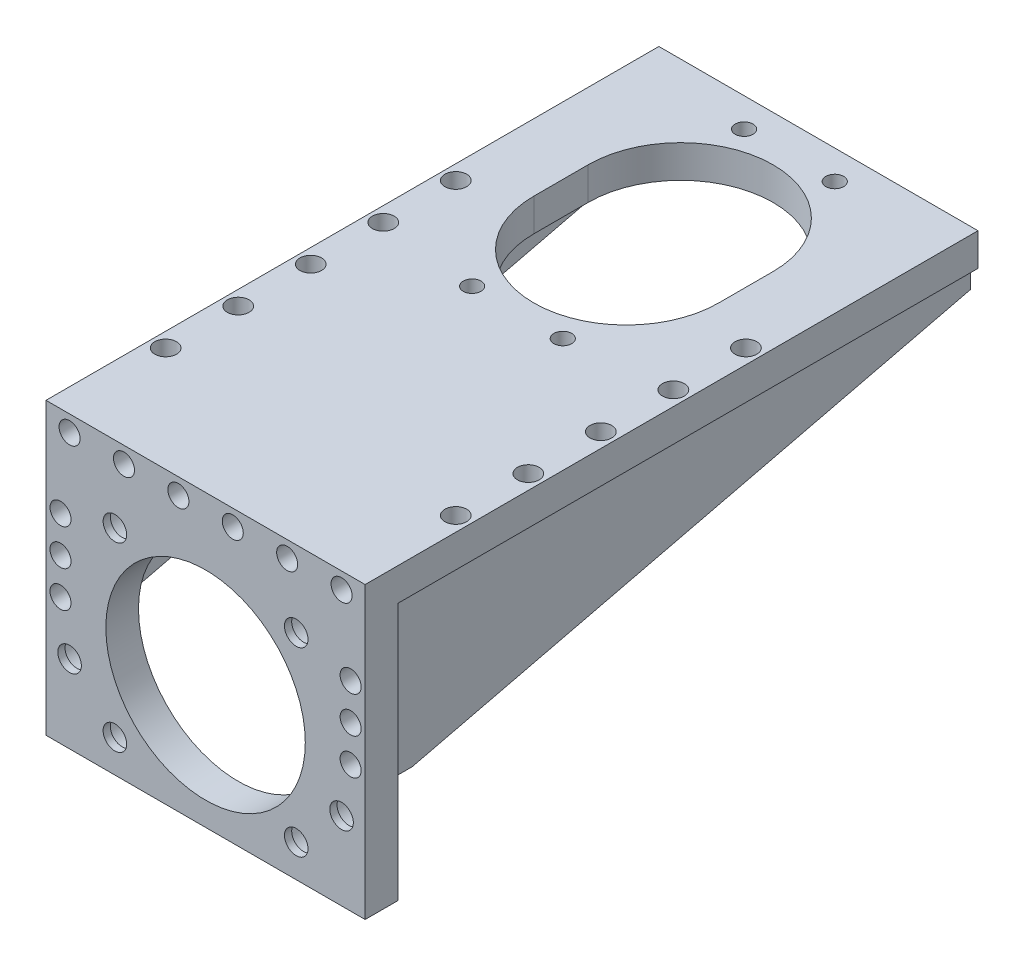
ISO-10303-21;
HEADER;
FILE_DESCRIPTION(('STEP AP214'),'2;1');
FILE_NAME('part.step','',(''),(''),'','','');
FILE_SCHEMA(('AUTOMOTIVE_DESIGN { 1 0 10303 214 1 1 1 1 }'));
ENDSEC;
DATA;
#1=APPLICATION_CONTEXT('core data for automotive mechanical design processes');
#2=APPLICATION_PROTOCOL_DEFINITION('international standard','automotive_design',2000,#1);
#3=PRODUCT_CONTEXT('',#1,'mechanical');
#4=PRODUCT('Part','Part','',(#3));
#5=PRODUCT_RELATED_PRODUCT_CATEGORY('part','',(#4));
#6=PRODUCT_DEFINITION_FORMATION('','',#4);
#7=PRODUCT_DEFINITION_CONTEXT('part definition',#1,'design');
#8=PRODUCT_DEFINITION('design','',#6,#7);
#9=PRODUCT_DEFINITION_SHAPE('','',#8);
#10=(LENGTH_UNIT() NAMED_UNIT(*) SI_UNIT(.MILLI.,.METRE.));
#11=(NAMED_UNIT(*) PLANE_ANGLE_UNIT() SI_UNIT($,.RADIAN.));
#12=(NAMED_UNIT(*) SI_UNIT($,.STERADIAN.) SOLID_ANGLE_UNIT());
#13=UNCERTAINTY_MEASURE_WITH_UNIT(LENGTH_MEASURE(1.E-05),#10,'distance_accuracy_value','');
#14=(GEOMETRIC_REPRESENTATION_CONTEXT(3) GLOBAL_UNCERTAINTY_ASSIGNED_CONTEXT((#13)) GLOBAL_UNIT_ASSIGNED_CONTEXT((#10,
#11,#12)) REPRESENTATION_CONTEXT('',''));
#15=CARTESIAN_POINT('',(0.,0.,0.));
#16=DIRECTION('',(0.,0.,1.));
#17=DIRECTION('',(1.,0.,0.));
#18=AXIS2_PLACEMENT_3D('',#15,#16,#17);
#19=CARTESIAN_POINT('',(48.082687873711,33.0490957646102,-8.0000000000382));
#20=DIRECTION('',(0.,0.,1.));
#21=DIRECTION('',(1.,0.,0.));
#22=AXIS2_PLACEMENT_3D('',#19,#20,#21);
#23=CONICAL_SURFACE('',#22,1.22949999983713,1.02974425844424);
#24=CARTESIAN_POINT('',(48.082687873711,33.049095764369,-8.73875813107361));
#25=VERTEX_POINT('',#24);
#26=VERTEX_LOOP('',#25);
#27=FACE_BOUND('',#26,.T.);
#28=CARTESIAN_POINT('',(48.082687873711,33.0490957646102,-8.));
#29=DIRECTION('',(0.,0.,1.));
#30=DIRECTION('',(1.,0.,0.));
#31=AXIS2_PLACEMENT_3D('',#28,#29,#30);
#32=CIRCLE('',#31,1.2295);
#33=CARTESIAN_POINT('',(49.312187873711,33.0490957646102,-8.));
#34=VERTEX_POINT('',#33);
#35=EDGE_CURVE('E321',#34,#34,#32,.T.);
#36=ORIENTED_EDGE('',*,*,#35,.T.);
#37=EDGE_LOOP('',(#36));
#38=FACE_BOUND('',#37,.T.);
#39=ADVANCED_FACE('F17',(#27,#38),#23,.F.);
#40=CARTESIAN_POINT('',(45.5826878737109,63.5490957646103,-8.0000000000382));
#41=DIRECTION('',(0.,0.,1.));
#42=DIRECTION('',(1.,0.,0.));
#43=AXIS2_PLACEMENT_3D('',#40,#41,#42);
#44=CONICAL_SURFACE('',#43,1.22949999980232,1.02974425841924);
#45=CARTESIAN_POINT('',(45.5826878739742,63.5490957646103,-8.73875813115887));
#46=VERTEX_POINT('',#45);
#47=VERTEX_LOOP('',#46);
#48=FACE_BOUND('',#47,.T.);
#49=CARTESIAN_POINT('',(45.5826878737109,63.5490957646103,-8.));
#50=DIRECTION('',(0.,0.,1.));
#51=DIRECTION('',(1.,0.,0.));
#52=AXIS2_PLACEMENT_3D('',#49,#50,#51);
#53=CIRCLE('',#52,1.2295);
#54=CARTESIAN_POINT('',(46.8121878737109,63.5490957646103,-8.));
#55=VERTEX_POINT('',#54);
#56=EDGE_CURVE('E318',#55,#55,#53,.T.);
#57=ORIENTED_EDGE('',*,*,#56,.T.);
#58=EDGE_LOOP('',(#57));
#59=FACE_BOUND('',#58,.T.);
#60=ADVANCED_FACE('F1022',(#48,#59),#44,.F.);
#61=CARTESIAN_POINT('',(15.5826878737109,63.5490957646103,-8.0000000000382));
#62=DIRECTION('',(0.,0.,1.));
#63=DIRECTION('',(1.,0.,0.));
#64=AXIS2_PLACEMENT_3D('',#61,#62,#63);
#65=CONICAL_SURFACE('',#64,1.22950000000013,1.02974425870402);
#66=CARTESIAN_POINT('',(15.5826878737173,63.5490957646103,-8.73875813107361));
#67=VERTEX_POINT('',#66);
#68=VERTEX_LOOP('',#67);
#69=FACE_BOUND('',#68,.T.);
#70=CARTESIAN_POINT('',(15.5826878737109,63.5490957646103,-8.));
#71=DIRECTION('',(0.,0.,1.));
#72=DIRECTION('',(1.,0.,0.));
#73=AXIS2_PLACEMENT_3D('',#70,#71,#72);
#74=CIRCLE('',#73,1.2295);
#75=CARTESIAN_POINT('',(16.812187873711,63.5490957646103,-8.));
#76=VERTEX_POINT('',#75);
#77=EDGE_CURVE('E315',#76,#76,#74,.T.);
#78=ORIENTED_EDGE('',*,*,#77,.T.);
#79=EDGE_LOOP('',(#78));
#80=FACE_BOUND('',#79,.T.);
#81=ADVANCED_FACE('F1026',(#69,#80),#65,.F.);
#82=CARTESIAN_POINT('',(-14.4173121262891,63.5490957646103,-8.0000000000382));
#83=DIRECTION('',(0.,0.,1.));
#84=DIRECTION('',(1.,0.,0.));
#85=AXIS2_PLACEMENT_3D('',#82,#83,#84);
#86=CONICAL_SURFACE('',#85,1.22949999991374,1.02974425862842);
#87=CARTESIAN_POINT('',(-14.4173121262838,63.5490957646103,-8.73875813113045));
#88=VERTEX_POINT('',#87);
#89=VERTEX_LOOP('',#88);
#90=FACE_BOUND('',#89,.T.);
#91=CARTESIAN_POINT('',(-14.4173121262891,63.5490957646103,-8.));
#92=DIRECTION('',(0.,0.,1.));
#93=DIRECTION('',(1.,0.,0.));
#94=AXIS2_PLACEMENT_3D('',#91,#92,#93);
#95=CIRCLE('',#94,1.2295);
#96=CARTESIAN_POINT('',(-13.1878121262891,63.5490957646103,-8.));
#97=VERTEX_POINT('',#96);
#98=EDGE_CURVE('E312',#97,#97,#95,.T.);
#99=ORIENTED_EDGE('',*,*,#98,.T.);
#100=EDGE_LOOP('',(#99));
#101=FACE_BOUND('',#100,.T.);
#102=ADVANCED_FACE('F1030',(#90,#101),#86,.F.);
#103=CARTESIAN_POINT('',(-31.917312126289,43.0490957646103,-8.0000000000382));
#104=DIRECTION('',(0.,0.,1.));
#105=DIRECTION('',(1.,0.,0.));
#106=AXIS2_PLACEMENT_3D('',#103,#104,#105);
#107=CONICAL_SURFACE('',#106,1.22949999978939,1.02974425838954);
#108=CARTESIAN_POINT('',(-31.917312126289,43.0490957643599,-8.73875813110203));
#109=VERTEX_POINT('',#108);
#110=VERTEX_LOOP('',#109);
#111=FACE_BOUND('',#110,.T.);
#112=CARTESIAN_POINT('',(-31.917312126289,43.0490957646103,-8.));
#113=DIRECTION('',(0.,0.,1.));
#114=DIRECTION('',(1.,0.,0.));
#115=AXIS2_PLACEMENT_3D('',#112,#113,#114);
#116=CIRCLE('',#115,1.2295);
#117=CARTESIAN_POINT('',(-30.687812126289,43.0490957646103,-8.));
#118=VERTEX_POINT('',#117);
#119=EDGE_CURVE('E309',#118,#118,#116,.T.);
#120=ORIENTED_EDGE('',*,*,#119,.T.);
#121=EDGE_LOOP('',(#120));
#122=FACE_BOUND('',#121,.T.);
#123=ADVANCED_FACE('F1034',(#111,#122),#107,.F.);
#124=CARTESIAN_POINT('',(-31.917312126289,23.0490957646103,-8.00000000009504));
#125=DIRECTION('',(0.,0.,1.));
#126=DIRECTION('',(1.,0.,0.));
#127=AXIS2_PLACEMENT_3D('',#124,#125,#126);
#128=CONICAL_SURFACE('',#127,1.22949999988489,1.02974425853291);
#129=CARTESIAN_POINT('',(-31.917312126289,23.0490957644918,-8.73875813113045));
#130=VERTEX_POINT('',#129);
#131=VERTEX_LOOP('',#130);
#132=FACE_BOUND('',#131,.T.);
#133=CARTESIAN_POINT('',(-31.917312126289,23.0490957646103,-8.));
#134=DIRECTION('',(0.,0.,1.));
#135=DIRECTION('',(1.,0.,0.));
#136=AXIS2_PLACEMENT_3D('',#133,#134,#135);
#137=CIRCLE('',#136,1.2295);
#138=CARTESIAN_POINT('',(-30.687812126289,23.0490957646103,-8.));
#139=VERTEX_POINT('',#138);
#140=EDGE_CURVE('E306',#139,#139,#137,.T.);
#141=ORIENTED_EDGE('',*,*,#140,.T.);
#142=EDGE_LOOP('',(#141));
#143=FACE_BOUND('',#142,.T.);
#144=ADVANCED_FACE('F1038',(#132,#143),#128,.F.);
#145=CARTESIAN_POINT('',(-31.917312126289,33.0490957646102,-8.0000000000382));
#146=DIRECTION('',(0.,0.,1.));
#147=DIRECTION('',(1.,0.,0.));
#148=AXIS2_PLACEMENT_3D('',#145,#146,#147);
#149=CONICAL_SURFACE('',#148,1.22949999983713,1.02974425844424);
#150=CARTESIAN_POINT('',(-31.917312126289,33.049095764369,-8.73875813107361));
#151=VERTEX_POINT('',#150);
#152=VERTEX_LOOP('',#151);
#153=FACE_BOUND('',#152,.T.);
#154=CARTESIAN_POINT('',(-31.917312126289,33.0490957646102,-8.));
#155=DIRECTION('',(0.,0.,1.));
#156=DIRECTION('',(1.,0.,0.));
#157=AXIS2_PLACEMENT_3D('',#154,#155,#156);
#158=CIRCLE('',#157,1.2295);
#159=CARTESIAN_POINT('',(-30.687812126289,33.0490957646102,-8.));
#160=VERTEX_POINT('',#159);
#161=EDGE_CURVE('E303',#160,#160,#158,.T.);
#162=ORIENTED_EDGE('',*,*,#161,.T.);
#163=EDGE_LOOP('',(#162));
#164=FACE_BOUND('',#163,.T.);
#165=ADVANCED_FACE('F1042',(#153,#164),#149,.F.);
#166=CARTESIAN_POINT('',(-29.4173121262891,63.5490957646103,-8.0000000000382));
#167=DIRECTION('',(0.,0.,1.));
#168=DIRECTION('',(1.,0.,0.));
#169=AXIS2_PLACEMENT_3D('',#166,#167,#168);
#170=CONICAL_SURFACE('',#169,1.22949999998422,1.0297442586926);
#171=CARTESIAN_POINT('',(-29.4173121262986,63.5490957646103,-8.73875813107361));
#172=VERTEX_POINT('',#171);
#173=VERTEX_LOOP('',#172);
#174=FACE_BOUND('',#173,.T.);
#175=CARTESIAN_POINT('',(-29.4173121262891,63.5490957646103,-8.));
#176=DIRECTION('',(0.,0.,1.));
#177=DIRECTION('',(1.,0.,0.));
#178=AXIS2_PLACEMENT_3D('',#175,#176,#177);
#179=CIRCLE('',#178,1.2295);
#180=CARTESIAN_POINT('',(-28.1878121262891,63.5490957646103,-8.));
#181=VERTEX_POINT('',#180);
#182=EDGE_CURVE('E300',#181,#181,#179,.T.);
#183=ORIENTED_EDGE('',*,*,#182,.T.);
#184=EDGE_LOOP('',(#183));
#185=FACE_BOUND('',#184,.T.);
#186=ADVANCED_FACE('F1046',(#174,#185),#170,.F.);
#187=CARTESIAN_POINT('',(0.582687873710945,63.5490957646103,-7.99999999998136));
#188=DIRECTION('',(0.,0.,1.));
#189=DIRECTION('',(1.,0.,0.));
#190=AXIS2_PLACEMENT_3D('',#187,#188,#189);
#191=CONICAL_SURFACE('',#190,1.22950000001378,1.02974425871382);
#192=CARTESIAN_POINT('',(0.582687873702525,63.5490957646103,-8.73875813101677));
#193=VERTEX_POINT('',#192);
#194=VERTEX_LOOP('',#193);
#195=FACE_BOUND('',#194,.T.);
#196=CARTESIAN_POINT('',(0.582687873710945,63.5490957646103,-8.));
#197=DIRECTION('',(0.,0.,1.));
#198=DIRECTION('',(1.,0.,0.));
#199=AXIS2_PLACEMENT_3D('',#196,#197,#198);
#200=CIRCLE('',#199,1.2295);
#201=CARTESIAN_POINT('',(1.81218787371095,63.5490957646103,-8.));
#202=VERTEX_POINT('',#201);
#203=EDGE_CURVE('E297',#202,#202,#200,.T.);
#204=ORIENTED_EDGE('',*,*,#203,.T.);
#205=EDGE_LOOP('',(#204));
#206=FACE_BOUND('',#205,.T.);
#207=ADVANCED_FACE('F1050',(#195,#206),#191,.F.);
#208=CARTESIAN_POINT('',(30.5826878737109,63.5490957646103,-8.0000000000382));
#209=DIRECTION('',(0.,0.,1.));
#210=DIRECTION('',(1.,0.,0.));
#211=AXIS2_PLACEMENT_3D('',#208,#209,#210);
#212=CONICAL_SURFACE('',#211,1.2294999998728,1.02974425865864);
#213=CARTESIAN_POINT('',(30.5826878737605,63.5490957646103,-8.73875813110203));
#214=VERTEX_POINT('',#213);
#215=VERTEX_LOOP('',#214);
#216=FACE_BOUND('',#215,.T.);
#217=CARTESIAN_POINT('',(30.5826878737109,63.5490957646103,-8.));
#218=DIRECTION('',(0.,0.,1.));
#219=DIRECTION('',(1.,0.,0.));
#220=AXIS2_PLACEMENT_3D('',#217,#218,#219);
#221=CIRCLE('',#220,1.2295);
#222=CARTESIAN_POINT('',(31.812187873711,63.5490957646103,-8.));
#223=VERTEX_POINT('',#222);
#224=EDGE_CURVE('E294',#223,#223,#221,.T.);
#225=ORIENTED_EDGE('',*,*,#224,.T.);
#226=EDGE_LOOP('',(#225));
#227=FACE_BOUND('',#226,.T.);
#228=ADVANCED_FACE('F1054',(#216,#227),#212,.F.);
#229=CARTESIAN_POINT('',(48.082687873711,43.0490957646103,-8.0000000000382));
#230=DIRECTION('',(0.,0.,1.));
#231=DIRECTION('',(1.,0.,0.));
#232=AXIS2_PLACEMENT_3D('',#229,#230,#231);
#233=CONICAL_SURFACE('',#232,1.22949999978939,1.02974425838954);
#234=CARTESIAN_POINT('',(48.082687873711,43.0490957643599,-8.73875813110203));
#235=VERTEX_POINT('',#234);
#236=VERTEX_LOOP('',#235);
#237=FACE_BOUND('',#236,.T.);
#238=CARTESIAN_POINT('',(48.082687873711,43.0490957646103,-8.));
#239=DIRECTION('',(0.,0.,1.));
#240=DIRECTION('',(1.,0.,0.));
#241=AXIS2_PLACEMENT_3D('',#238,#239,#240);
#242=CIRCLE('',#241,1.2295);
#243=CARTESIAN_POINT('',(49.312187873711,43.0490957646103,-8.));
#244=VERTEX_POINT('',#243);
#245=EDGE_CURVE('E291',#244,#244,#242,.T.);
#246=ORIENTED_EDGE('',*,*,#245,.T.);
#247=EDGE_LOOP('',(#246));
#248=FACE_BOUND('',#247,.T.);
#249=ADVANCED_FACE('F1058',(#237,#248),#233,.F.);
#250=CARTESIAN_POINT('',(48.082687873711,23.0490957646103,-8.00000000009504));
#251=DIRECTION('',(0.,0.,1.));
#252=DIRECTION('',(1.,0.,0.));
#253=AXIS2_PLACEMENT_3D('',#250,#251,#252);
#254=CONICAL_SURFACE('',#253,1.22949999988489,1.02974425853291);
#255=CARTESIAN_POINT('',(48.082687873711,23.0490957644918,-8.73875813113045));
#256=VERTEX_POINT('',#255);
#257=VERTEX_LOOP('',#256);
#258=FACE_BOUND('',#257,.T.);
#259=CARTESIAN_POINT('',(48.082687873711,23.0490957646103,-8.));
#260=DIRECTION('',(0.,0.,1.));
#261=DIRECTION('',(1.,0.,0.));
#262=AXIS2_PLACEMENT_3D('',#259,#260,#261);
#263=CIRCLE('',#262,1.2295);
#264=CARTESIAN_POINT('',(49.312187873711,23.0490957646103,-8.));
#265=VERTEX_POINT('',#264);
#266=EDGE_CURVE('E288',#265,#265,#263,.T.);
#267=ORIENTED_EDGE('',*,*,#266,.T.);
#268=EDGE_LOOP('',(#267));
#269=FACE_BOUND('',#268,.T.);
#270=ADVANCED_FACE('F1062',(#258,#269),#254,.F.);
#271=CARTESIAN_POINT('',(48.082687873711,51.0490957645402,-80.));
#272=DIRECTION('',(0.,1.,0.));
#273=DIRECTION('',(0.,0.,1.));
#274=AXIS2_PLACEMENT_3D('',#271,#272,#273);
#275=CONICAL_SURFACE('',#274,1.22949999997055,1.02974425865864);
#276=CARTESIAN_POINT('',(48.082687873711,50.3103376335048,-80.));
#277=VERTEX_POINT('',#276);
#278=VERTEX_LOOP('',#277);
#279=FACE_BOUND('',#278,.T.);
#280=CARTESIAN_POINT('',(48.082687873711,51.0490957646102,-80.));
#281=DIRECTION('',(0.,1.,0.));
#282=DIRECTION('',(0.,0.,1.));
#283=AXIS2_PLACEMENT_3D('',#280,#281,#282);
#284=CIRCLE('',#283,1.2295);
#285=CARTESIAN_POINT('',(48.082687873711,51.0490957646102,-78.7705));
#286=VERTEX_POINT('',#285);
#287=EDGE_CURVE('E285',#286,#286,#284,.T.);
#288=ORIENTED_EDGE('',*,*,#287,.T.);
#289=EDGE_LOOP('',(#288));
#290=FACE_BOUND('',#289,.T.);
#291=ADVANCED_FACE('F1066',(#279,#290),#275,.F.);
#292=CARTESIAN_POINT('',(48.082687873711,51.0490957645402,-40.));
#293=DIRECTION('',(0.,1.,0.));
#294=DIRECTION('',(0.,0.,1.));
#295=AXIS2_PLACEMENT_3D('',#292,#293,#294);
#296=CONICAL_SURFACE('',#295,1.22949999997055,1.02974425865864);
#297=CARTESIAN_POINT('',(48.082687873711,50.3103376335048,-40.));
#298=VERTEX_POINT('',#297);
#299=VERTEX_LOOP('',#298);
#300=FACE_BOUND('',#299,.T.);
#301=CARTESIAN_POINT('',(48.082687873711,51.0490957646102,-40.));
#302=DIRECTION('',(0.,1.,0.));
#303=DIRECTION('',(0.,0.,1.));
#304=AXIS2_PLACEMENT_3D('',#301,#302,#303);
#305=CIRCLE('',#304,1.2295);
#306=CARTESIAN_POINT('',(48.082687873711,51.0490957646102,-38.7705));
#307=VERTEX_POINT('',#306);
#308=EDGE_CURVE('E282',#307,#307,#305,.T.);
#309=ORIENTED_EDGE('',*,*,#308,.T.);
#310=EDGE_LOOP('',(#309));
#311=FACE_BOUND('',#310,.T.);
#312=ADVANCED_FACE('F1070',(#300,#311),#296,.F.);
#313=CARTESIAN_POINT('',(-31.9173121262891,51.049095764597,-100.));
#314=DIRECTION('',(0.,1.,0.));
#315=DIRECTION('',(-1.,0.,0.));
#316=AXIS2_PLACEMENT_3D('',#313,#314,#315);
#317=CONICAL_SURFACE('',#316,1.22950000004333,1.0297442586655);
#318=CARTESIAN_POINT('',(-31.9173121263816,50.3103376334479,-100.));
#319=VERTEX_POINT('',#318);
#320=VERTEX_LOOP('',#319);
#321=FACE_BOUND('',#320,.T.);
#322=CARTESIAN_POINT('',(-31.9173121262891,51.0490957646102,-100.));
#323=DIRECTION('',(0.,1.,0.));
#324=DIRECTION('',(0.,0.,1.));
#325=AXIS2_PLACEMENT_3D('',#322,#323,#324);
#326=CIRCLE('',#325,1.2295);
#327=CARTESIAN_POINT('',(-31.9173121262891,51.0490957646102,-98.7705));
#328=VERTEX_POINT('',#327);
#329=EDGE_CURVE('E279',#328,#328,#326,.T.);
#330=ORIENTED_EDGE('',*,*,#329,.T.);
#331=EDGE_LOOP('',(#330));
#332=FACE_BOUND('',#331,.T.);
#333=ADVANCED_FACE('F1074',(#321,#332),#317,.F.);
#334=CARTESIAN_POINT('',(-31.9173121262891,51.049095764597,-60.));
#335=DIRECTION('',(0.,1.,0.));
#336=DIRECTION('',(-1.,0.,0.));
#337=AXIS2_PLACEMENT_3D('',#334,#335,#336);
#338=CONICAL_SURFACE('',#337,1.22950000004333,1.0297442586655);
#339=CARTESIAN_POINT('',(-31.9173121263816,50.3103376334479,-60.));
#340=VERTEX_POINT('',#339);
#341=VERTEX_LOOP('',#340);
#342=FACE_BOUND('',#341,.T.);
#343=CARTESIAN_POINT('',(-31.9173121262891,51.0490957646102,-60.));
#344=DIRECTION('',(0.,1.,0.));
#345=DIRECTION('',(0.,0.,1.));
#346=AXIS2_PLACEMENT_3D('',#343,#344,#345);
#347=CIRCLE('',#346,1.2295);
#348=CARTESIAN_POINT('',(-31.9173121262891,51.0490957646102,-58.7705));
#349=VERTEX_POINT('',#348);
#350=EDGE_CURVE('E276',#349,#349,#347,.T.);
#351=ORIENTED_EDGE('',*,*,#350,.T.);
#352=EDGE_LOOP('',(#351));
#353=FACE_BOUND('',#352,.T.);
#354=ADVANCED_FACE('F1078',(#342,#353),#338,.F.);
#355=CARTESIAN_POINT('',(-31.9173121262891,51.049095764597,-20.));
#356=DIRECTION('',(0.,1.,0.));
#357=DIRECTION('',(-1.,0.,0.));
#358=AXIS2_PLACEMENT_3D('',#355,#356,#357);
#359=CONICAL_SURFACE('',#358,1.22950000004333,1.0297442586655);
#360=CARTESIAN_POINT('',(-31.9173121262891,50.3103376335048,-20.));
#361=VERTEX_POINT('',#360);
#362=VERTEX_LOOP('',#361);
#363=FACE_BOUND('',#362,.T.);
#364=CARTESIAN_POINT('',(-31.9173121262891,51.0490957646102,-20.));
#365=DIRECTION('',(0.,1.,0.));
#366=DIRECTION('',(0.,0.,1.));
#367=AXIS2_PLACEMENT_3D('',#364,#365,#366);
#368=CIRCLE('',#367,1.2295);
#369=CARTESIAN_POINT('',(-31.9173121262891,51.0490957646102,-18.7705));
#370=VERTEX_POINT('',#369);
#371=EDGE_CURVE('E273',#370,#370,#368,.T.);
#372=ORIENTED_EDGE('',*,*,#371,.T.);
#373=EDGE_LOOP('',(#372));
#374=FACE_BOUND('',#373,.T.);
#375=ADVANCED_FACE('F1082',(#363,#374),#359,.F.);
#376=CARTESIAN_POINT('',(-31.9173121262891,51.049095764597,-40.));
#377=DIRECTION('',(0.,1.,0.));
#378=DIRECTION('',(-1.,0.,0.));
#379=AXIS2_PLACEMENT_3D('',#376,#377,#378);
#380=CONICAL_SURFACE('',#379,1.22950000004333,1.0297442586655);
#381=CARTESIAN_POINT('',(-31.9173121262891,50.3103376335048,-40.));
#382=VERTEX_POINT('',#381);
#383=VERTEX_LOOP('',#382);
#384=FACE_BOUND('',#383,.T.);
#385=CARTESIAN_POINT('',(-31.9173121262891,51.0490957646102,-40.));
#386=DIRECTION('',(0.,1.,0.));
#387=DIRECTION('',(0.,0.,1.));
#388=AXIS2_PLACEMENT_3D('',#385,#386,#387);
#389=CIRCLE('',#388,1.2295);
#390=CARTESIAN_POINT('',(-31.9173121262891,51.0490957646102,-38.7705));
#391=VERTEX_POINT('',#390);
#392=EDGE_CURVE('E270',#391,#391,#389,.T.);
#393=ORIENTED_EDGE('',*,*,#392,.T.);
#394=EDGE_LOOP('',(#393));
#395=FACE_BOUND('',#394,.T.);
#396=ADVANCED_FACE('F1086',(#384,#395),#380,.F.);
#397=CARTESIAN_POINT('',(-31.9173121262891,51.049095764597,-80.));
#398=DIRECTION('',(0.,1.,0.));
#399=DIRECTION('',(-1.,0.,0.));
#400=AXIS2_PLACEMENT_3D('',#397,#398,#399);
#401=CONICAL_SURFACE('',#400,1.22950000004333,1.0297442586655);
#402=CARTESIAN_POINT('',(-31.9173121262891,50.3103376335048,-80.));
#403=VERTEX_POINT('',#402);
#404=VERTEX_LOOP('',#403);
#405=FACE_BOUND('',#404,.T.);
#406=CARTESIAN_POINT('',(-31.9173121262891,51.0490957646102,-80.));
#407=DIRECTION('',(0.,1.,0.));
#408=DIRECTION('',(0.,0.,1.));
#409=AXIS2_PLACEMENT_3D('',#406,#407,#408);
#410=CIRCLE('',#409,1.2295);
#411=CARTESIAN_POINT('',(-31.9173121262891,51.0490957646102,-78.7705));
#412=VERTEX_POINT('',#411);
#413=EDGE_CURVE('E267',#412,#412,#410,.T.);
#414=ORIENTED_EDGE('',*,*,#413,.T.);
#415=EDGE_LOOP('',(#414));
#416=FACE_BOUND('',#415,.T.);
#417=ADVANCED_FACE('F1090',(#405,#416),#401,.F.);
#418=CARTESIAN_POINT('',(48.082687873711,51.0490957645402,-20.));
#419=DIRECTION('',(0.,1.,0.));
#420=DIRECTION('',(-1.,0.,0.));
#421=AXIS2_PLACEMENT_3D('',#418,#419,#420);
#422=CONICAL_SURFACE('',#421,1.22949999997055,1.02974425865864);
#423=CARTESIAN_POINT('',(48.082687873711,50.3103376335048,-20.));
#424=VERTEX_POINT('',#423);
#425=VERTEX_LOOP('',#424);
#426=FACE_BOUND('',#425,.T.);
#427=CARTESIAN_POINT('',(48.082687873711,51.0490957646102,-20.));
#428=DIRECTION('',(0.,1.,0.));
#429=DIRECTION('',(0.,0.,1.));
#430=AXIS2_PLACEMENT_3D('',#427,#428,#429);
#431=CIRCLE('',#430,1.2295);
#432=CARTESIAN_POINT('',(48.082687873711,51.0490957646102,-18.7705));
#433=VERTEX_POINT('',#432);
#434=EDGE_CURVE('E264',#433,#433,#431,.T.);
#435=ORIENTED_EDGE('',*,*,#434,.T.);
#436=EDGE_LOOP('',(#435));
#437=FACE_BOUND('',#436,.T.);
#438=ADVANCED_FACE('F1094',(#426,#437),#422,.F.);
#439=CARTESIAN_POINT('',(48.082687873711,51.0490957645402,-60.));
#440=DIRECTION('',(0.,1.,0.));
#441=DIRECTION('',(-1.,0.,0.));
#442=AXIS2_PLACEMENT_3D('',#439,#440,#441);
#443=CONICAL_SURFACE('',#442,1.22949999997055,1.02974425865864);
#444=CARTESIAN_POINT('',(48.0826878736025,50.3103376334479,-60.));
#445=VERTEX_POINT('',#444);
#446=VERTEX_LOOP('',#445);
#447=FACE_BOUND('',#446,.T.);
#448=CARTESIAN_POINT('',(48.082687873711,51.0490957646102,-60.));
#449=DIRECTION('',(0.,1.,0.));
#450=DIRECTION('',(0.,0.,1.));
#451=AXIS2_PLACEMENT_3D('',#448,#449,#450);
#452=CIRCLE('',#451,1.2295);
#453=CARTESIAN_POINT('',(48.082687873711,51.0490957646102,-58.7705));
#454=VERTEX_POINT('',#453);
#455=EDGE_CURVE('E261',#454,#454,#452,.T.);
#456=ORIENTED_EDGE('',*,*,#455,.T.);
#457=EDGE_LOOP('',(#456));
#458=FACE_BOUND('',#457,.T.);
#459=ADVANCED_FACE('F1098',(#447,#458),#443,.F.);
#460=CARTESIAN_POINT('',(48.082687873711,51.0490957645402,-100.));
#461=DIRECTION('',(0.,1.,0.));
#462=DIRECTION('',(-1.,0.,0.));
#463=AXIS2_PLACEMENT_3D('',#460,#461,#462);
#464=CONICAL_SURFACE('',#463,1.22949999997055,1.02974425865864);
#465=CARTESIAN_POINT('',(48.0826878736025,50.3103376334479,-100.));
#466=VERTEX_POINT('',#465);
#467=VERTEX_LOOP('',#466);
#468=FACE_BOUND('',#467,.T.);
#469=CARTESIAN_POINT('',(48.082687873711,51.0490957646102,-100.));
#470=DIRECTION('',(0.,1.,0.));
#471=DIRECTION('',(0.,0.,1.));
#472=AXIS2_PLACEMENT_3D('',#469,#470,#471);
#473=CIRCLE('',#472,1.2295);
#474=CARTESIAN_POINT('',(48.082687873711,51.0490957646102,-98.7705));
#475=VERTEX_POINT('',#474);
#476=EDGE_CURVE('E257',#475,#475,#473,.T.);
#477=ORIENTED_EDGE('',*,*,#476,.T.);
#478=EDGE_LOOP('',(#477));
#479=FACE_BOUND('',#478,.T.);
#480=ADVANCED_FACE('F1102',(#468,#479),#464,.F.);
#481=CARTESIAN_POINT('',(48.082687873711,33.0490957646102,-4.));
#482=DIRECTION('',(0.,0.,1.));
#483=DIRECTION('',(1.,0.,0.));
#484=AXIS2_PLACEMENT_3D('',#481,#482,#483);
#485=CYLINDRICAL_SURFACE('',#484,1.2295);
#486=CARTESIAN_POINT('',(48.082687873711,33.0490957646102,0.));
#487=DIRECTION('',(0.,0.,1.));
#488=DIRECTION('',(1.,0.,0.));
#489=AXIS2_PLACEMENT_3D('',#486,#487,#488);
#490=CIRCLE('',#489,1.2295);
#491=CARTESIAN_POINT('',(49.312187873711,33.0490957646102,0.));
#492=VERTEX_POINT('',#491);
#493=EDGE_CURVE('E260',#492,#492,#490,.F.);
#494=ORIENTED_EDGE('',*,*,#493,.F.);
#495=EDGE_LOOP('',(#494));
#496=FACE_BOUND('',#495,.T.);
#497=ORIENTED_EDGE('',*,*,#35,.F.);
#498=EDGE_LOOP('',(#497));
#499=FACE_BOUND('',#498,.T.);
#500=ADVANCED_FACE('F1106',(#496,#499),#485,.F.);
#501=CARTESIAN_POINT('',(45.5826878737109,63.5490957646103,-4.));
#502=DIRECTION('',(0.,0.,1.));
#503=DIRECTION('',(1.,0.,0.));
#504=AXIS2_PLACEMENT_3D('',#501,#502,#503);
#505=CYLINDRICAL_SURFACE('',#504,1.2295);
#506=CARTESIAN_POINT('',(45.5826878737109,63.5490957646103,0.));
#507=DIRECTION('',(0.,0.,1.));
#508=DIRECTION('',(1.,0.,0.));
#509=AXIS2_PLACEMENT_3D('',#506,#507,#508);
#510=CIRCLE('',#509,1.2295);
#511=CARTESIAN_POINT('',(46.8121878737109,63.5490957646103,0.));
#512=VERTEX_POINT('',#511);
#513=EDGE_CURVE('E764',#512,#512,#510,.F.);
#514=ORIENTED_EDGE('',*,*,#513,.F.);
#515=EDGE_LOOP('',(#514));
#516=FACE_BOUND('',#515,.T.);
#517=ORIENTED_EDGE('',*,*,#56,.F.);
#518=EDGE_LOOP('',(#517));
#519=FACE_BOUND('',#518,.T.);
#520=ADVANCED_FACE('F1110',(#516,#519),#505,.F.);
#521=CARTESIAN_POINT('',(15.5826878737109,63.5490957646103,-4.));
#522=DIRECTION('',(0.,0.,1.));
#523=DIRECTION('',(1.,0.,0.));
#524=AXIS2_PLACEMENT_3D('',#521,#522,#523);
#525=CYLINDRICAL_SURFACE('',#524,1.2295);
#526=CARTESIAN_POINT('',(15.5826878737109,63.5490957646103,0.));
#527=DIRECTION('',(0.,0.,1.));
#528=DIRECTION('',(1.,0.,0.));
#529=AXIS2_PLACEMENT_3D('',#526,#527,#528);
#530=CIRCLE('',#529,1.2295);
#531=CARTESIAN_POINT('',(16.812187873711,63.5490957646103,0.));
#532=VERTEX_POINT('',#531);
#533=EDGE_CURVE('E761',#532,#532,#530,.F.);
#534=ORIENTED_EDGE('',*,*,#533,.F.);
#535=EDGE_LOOP('',(#534));
#536=FACE_BOUND('',#535,.T.);
#537=ORIENTED_EDGE('',*,*,#77,.F.);
#538=EDGE_LOOP('',(#537));
#539=FACE_BOUND('',#538,.T.);
#540=ADVANCED_FACE('F1114',(#536,#539),#525,.F.);
#541=CARTESIAN_POINT('',(-14.4173121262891,63.5490957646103,-4.));
#542=DIRECTION('',(0.,0.,1.));
#543=DIRECTION('',(1.,0.,0.));
#544=AXIS2_PLACEMENT_3D('',#541,#542,#543);
#545=CYLINDRICAL_SURFACE('',#544,1.2295);
#546=CARTESIAN_POINT('',(-14.4173121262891,63.5490957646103,0.));
#547=DIRECTION('',(0.,0.,1.));
#548=DIRECTION('',(1.,0.,0.));
#549=AXIS2_PLACEMENT_3D('',#546,#547,#548);
#550=CIRCLE('',#549,1.2295);
#551=CARTESIAN_POINT('',(-13.1878121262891,63.5490957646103,0.));
#552=VERTEX_POINT('',#551);
#553=EDGE_CURVE('E758',#552,#552,#550,.F.);
#554=ORIENTED_EDGE('',*,*,#553,.F.);
#555=EDGE_LOOP('',(#554));
#556=FACE_BOUND('',#555,.T.);
#557=ORIENTED_EDGE('',*,*,#98,.F.);
#558=EDGE_LOOP('',(#557));
#559=FACE_BOUND('',#558,.T.);
#560=ADVANCED_FACE('F1118',(#556,#559),#545,.F.);
#561=CARTESIAN_POINT('',(-31.917312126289,43.0490957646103,-4.));
#562=DIRECTION('',(0.,0.,1.));
#563=DIRECTION('',(1.,0.,0.));
#564=AXIS2_PLACEMENT_3D('',#561,#562,#563);
#565=CYLINDRICAL_SURFACE('',#564,1.2295);
#566=CARTESIAN_POINT('',(-31.917312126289,43.0490957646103,0.));
#567=DIRECTION('',(0.,0.,1.));
#568=DIRECTION('',(1.,0.,0.));
#569=AXIS2_PLACEMENT_3D('',#566,#567,#568);
#570=CIRCLE('',#569,1.2295);
#571=CARTESIAN_POINT('',(-30.687812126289,43.0490957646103,0.));
#572=VERTEX_POINT('',#571);
#573=EDGE_CURVE('E755',#572,#572,#570,.F.);
#574=ORIENTED_EDGE('',*,*,#573,.F.);
#575=EDGE_LOOP('',(#574));
#576=FACE_BOUND('',#575,.T.);
#577=ORIENTED_EDGE('',*,*,#119,.F.);
#578=EDGE_LOOP('',(#577));
#579=FACE_BOUND('',#578,.T.);
#580=ADVANCED_FACE('F1122',(#576,#579),#565,.F.);
#581=CARTESIAN_POINT('',(-31.917312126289,23.0490957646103,-4.));
#582=DIRECTION('',(0.,0.,1.));
#583=DIRECTION('',(1.,0.,0.));
#584=AXIS2_PLACEMENT_3D('',#581,#582,#583);
#585=CYLINDRICAL_SURFACE('',#584,1.2295);
#586=CARTESIAN_POINT('',(-31.917312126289,23.0490957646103,0.));
#587=DIRECTION('',(0.,0.,1.));
#588=DIRECTION('',(1.,0.,0.));
#589=AXIS2_PLACEMENT_3D('',#586,#587,#588);
#590=CIRCLE('',#589,1.2295);
#591=CARTESIAN_POINT('',(-30.687812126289,23.0490957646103,0.));
#592=VERTEX_POINT('',#591);
#593=EDGE_CURVE('E752',#592,#592,#590,.F.);
#594=ORIENTED_EDGE('',*,*,#593,.F.);
#595=EDGE_LOOP('',(#594));
#596=FACE_BOUND('',#595,.T.);
#597=ORIENTED_EDGE('',*,*,#140,.F.);
#598=EDGE_LOOP('',(#597));
#599=FACE_BOUND('',#598,.T.);
#600=ADVANCED_FACE('F1126',(#596,#599),#585,.F.);
#601=CARTESIAN_POINT('',(-31.917312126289,33.0490957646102,-4.));
#602=DIRECTION('',(0.,0.,1.));
#603=DIRECTION('',(1.,0.,0.));
#604=AXIS2_PLACEMENT_3D('',#601,#602,#603);
#605=CYLINDRICAL_SURFACE('',#604,1.2295);
#606=CARTESIAN_POINT('',(-31.917312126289,33.0490957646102,0.));
#607=DIRECTION('',(0.,0.,1.));
#608=DIRECTION('',(1.,0.,0.));
#609=AXIS2_PLACEMENT_3D('',#606,#607,#608);
#610=CIRCLE('',#609,1.2295);
#611=CARTESIAN_POINT('',(-30.687812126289,33.0490957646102,0.));
#612=VERTEX_POINT('',#611);
#613=EDGE_CURVE('E749',#612,#612,#610,.F.);
#614=ORIENTED_EDGE('',*,*,#613,.F.);
#615=EDGE_LOOP('',(#614));
#616=FACE_BOUND('',#615,.T.);
#617=ORIENTED_EDGE('',*,*,#161,.F.);
#618=EDGE_LOOP('',(#617));
#619=FACE_BOUND('',#618,.T.);
#620=ADVANCED_FACE('F1130',(#616,#619),#605,.F.);
#621=CARTESIAN_POINT('',(-29.4173121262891,63.5490957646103,-4.));
#622=DIRECTION('',(0.,0.,1.));
#623=DIRECTION('',(1.,0.,0.));
#624=AXIS2_PLACEMENT_3D('',#621,#622,#623);
#625=CYLINDRICAL_SURFACE('',#624,1.2295);
#626=CARTESIAN_POINT('',(-29.4173121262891,63.5490957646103,0.));
#627=DIRECTION('',(0.,0.,1.));
#628=DIRECTION('',(1.,0.,0.));
#629=AXIS2_PLACEMENT_3D('',#626,#627,#628);
#630=CIRCLE('',#629,1.2295);
#631=CARTESIAN_POINT('',(-28.1878121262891,63.5490957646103,0.));
#632=VERTEX_POINT('',#631);
#633=EDGE_CURVE('E746',#632,#632,#630,.F.);
#634=ORIENTED_EDGE('',*,*,#633,.F.);
#635=EDGE_LOOP('',(#634));
#636=FACE_BOUND('',#635,.T.);
#637=ORIENTED_EDGE('',*,*,#182,.F.);
#638=EDGE_LOOP('',(#637));
#639=FACE_BOUND('',#638,.T.);
#640=ADVANCED_FACE('F1134',(#636,#639),#625,.F.);
#641=CARTESIAN_POINT('',(0.582687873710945,63.5490957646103,-4.));
#642=DIRECTION('',(0.,0.,1.));
#643=DIRECTION('',(1.,0.,0.));
#644=AXIS2_PLACEMENT_3D('',#641,#642,#643);
#645=CYLINDRICAL_SURFACE('',#644,1.2295);
#646=CARTESIAN_POINT('',(0.582687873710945,63.5490957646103,0.));
#647=DIRECTION('',(0.,0.,1.));
#648=DIRECTION('',(1.,0.,0.));
#649=AXIS2_PLACEMENT_3D('',#646,#647,#648);
#650=CIRCLE('',#649,1.2295);
#651=CARTESIAN_POINT('',(1.81218787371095,63.5490957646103,0.));
#652=VERTEX_POINT('',#651);
#653=EDGE_CURVE('E743',#652,#652,#650,.F.);
#654=ORIENTED_EDGE('',*,*,#653,.F.);
#655=EDGE_LOOP('',(#654));
#656=FACE_BOUND('',#655,.T.);
#657=ORIENTED_EDGE('',*,*,#203,.F.);
#658=EDGE_LOOP('',(#657));
#659=FACE_BOUND('',#658,.T.);
#660=ADVANCED_FACE('F1138',(#656,#659),#645,.F.);
#661=CARTESIAN_POINT('',(30.5826878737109,63.5490957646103,-4.));
#662=DIRECTION('',(0.,0.,1.));
#663=DIRECTION('',(1.,0.,0.));
#664=AXIS2_PLACEMENT_3D('',#661,#662,#663);
#665=CYLINDRICAL_SURFACE('',#664,1.2295);
#666=CARTESIAN_POINT('',(30.5826878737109,63.5490957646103,0.));
#667=DIRECTION('',(0.,0.,1.));
#668=DIRECTION('',(1.,0.,0.));
#669=AXIS2_PLACEMENT_3D('',#666,#667,#668);
#670=CIRCLE('',#669,1.2295);
#671=CARTESIAN_POINT('',(31.812187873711,63.5490957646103,0.));
#672=VERTEX_POINT('',#671);
#673=EDGE_CURVE('E740',#672,#672,#670,.F.);
#674=ORIENTED_EDGE('',*,*,#673,.F.);
#675=EDGE_LOOP('',(#674));
#676=FACE_BOUND('',#675,.T.);
#677=ORIENTED_EDGE('',*,*,#224,.F.);
#678=EDGE_LOOP('',(#677));
#679=FACE_BOUND('',#678,.T.);
#680=ADVANCED_FACE('F1142',(#676,#679),#665,.F.);
#681=CARTESIAN_POINT('',(48.082687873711,43.0490957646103,-4.));
#682=DIRECTION('',(0.,0.,1.));
#683=DIRECTION('',(1.,0.,0.));
#684=AXIS2_PLACEMENT_3D('',#681,#682,#683);
#685=CYLINDRICAL_SURFACE('',#684,1.2295);
#686=CARTESIAN_POINT('',(48.082687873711,43.0490957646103,0.));
#687=DIRECTION('',(0.,0.,1.));
#688=DIRECTION('',(1.,0.,0.));
#689=AXIS2_PLACEMENT_3D('',#686,#687,#688);
#690=CIRCLE('',#689,1.2295);
#691=CARTESIAN_POINT('',(49.312187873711,43.0490957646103,0.));
#692=VERTEX_POINT('',#691);
#693=EDGE_CURVE('E737',#692,#692,#690,.F.);
#694=ORIENTED_EDGE('',*,*,#693,.F.);
#695=EDGE_LOOP('',(#694));
#696=FACE_BOUND('',#695,.T.);
#697=ORIENTED_EDGE('',*,*,#245,.F.);
#698=EDGE_LOOP('',(#697));
#699=FACE_BOUND('',#698,.T.);
#700=ADVANCED_FACE('F1146',(#696,#699),#685,.F.);
#701=CARTESIAN_POINT('',(48.082687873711,23.0490957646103,-4.));
#702=DIRECTION('',(0.,0.,1.));
#703=DIRECTION('',(1.,0.,0.));
#704=AXIS2_PLACEMENT_3D('',#701,#702,#703);
#705=CYLINDRICAL_SURFACE('',#704,1.2295);
#706=CARTESIAN_POINT('',(48.082687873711,23.0490957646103,0.));
#707=DIRECTION('',(0.,0.,1.));
#708=DIRECTION('',(1.,0.,0.));
#709=AXIS2_PLACEMENT_3D('',#706,#707,#708);
#710=CIRCLE('',#709,1.2295);
#711=CARTESIAN_POINT('',(49.312187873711,23.0490957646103,0.));
#712=VERTEX_POINT('',#711);
#713=EDGE_CURVE('E734',#712,#712,#710,.F.);
#714=ORIENTED_EDGE('',*,*,#713,.F.);
#715=EDGE_LOOP('',(#714));
#716=FACE_BOUND('',#715,.T.);
#717=ORIENTED_EDGE('',*,*,#266,.F.);
#718=EDGE_LOOP('',(#717));
#719=FACE_BOUND('',#718,.T.);
#720=ADVANCED_FACE('F1150',(#716,#719),#705,.F.);
#721=CARTESIAN_POINT('',(48.082687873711,55.0490957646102,-80.));
#722=DIRECTION('',(0.,1.,0.));
#723=DIRECTION('',(0.,0.,1.));
#724=AXIS2_PLACEMENT_3D('',#721,#722,#723);
#725=CYLINDRICAL_SURFACE('',#724,1.2295);
#726=CARTESIAN_POINT('',(48.082687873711,59.0490957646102,-80.));
#727=DIRECTION('',(0.,1.,0.));
#728=DIRECTION('',(0.,0.,1.));
#729=AXIS2_PLACEMENT_3D('',#726,#727,#728);
#730=CIRCLE('',#729,1.2295);
#731=CARTESIAN_POINT('',(48.082687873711,59.0490957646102,-78.7705));
#732=VERTEX_POINT('',#731);
#733=EDGE_CURVE('E731',#732,#732,#730,.F.);
#734=ORIENTED_EDGE('',*,*,#733,.F.);
#735=EDGE_LOOP('',(#734));
#736=FACE_BOUND('',#735,.T.);
#737=ORIENTED_EDGE('',*,*,#287,.F.);
#738=EDGE_LOOP('',(#737));
#739=FACE_BOUND('',#738,.T.);
#740=ADVANCED_FACE('F1154',(#736,#739),#725,.F.);
#741=CARTESIAN_POINT('',(48.082687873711,55.0490957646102,-40.));
#742=DIRECTION('',(0.,1.,0.));
#743=DIRECTION('',(0.,0.,1.));
#744=AXIS2_PLACEMENT_3D('',#741,#742,#743);
#745=CYLINDRICAL_SURFACE('',#744,1.2295);
#746=CARTESIAN_POINT('',(48.082687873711,59.0490957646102,-40.));
#747=DIRECTION('',(0.,1.,0.));
#748=DIRECTION('',(0.,0.,1.));
#749=AXIS2_PLACEMENT_3D('',#746,#747,#748);
#750=CIRCLE('',#749,1.2295);
#751=CARTESIAN_POINT('',(48.082687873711,59.0490957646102,-38.7705));
#752=VERTEX_POINT('',#751);
#753=EDGE_CURVE('E728',#752,#752,#750,.F.);
#754=ORIENTED_EDGE('',*,*,#753,.F.);
#755=EDGE_LOOP('',(#754));
#756=FACE_BOUND('',#755,.T.);
#757=ORIENTED_EDGE('',*,*,#308,.F.);
#758=EDGE_LOOP('',(#757));
#759=FACE_BOUND('',#758,.T.);
#760=ADVANCED_FACE('F1158',(#756,#759),#745,.F.);
#761=CARTESIAN_POINT('',(-31.9173121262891,55.0490957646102,-100.));
#762=DIRECTION('',(0.,1.,0.));
#763=DIRECTION('',(0.,0.,1.));
#764=AXIS2_PLACEMENT_3D('',#761,#762,#763);
#765=CYLINDRICAL_SURFACE('',#764,1.2295);
#766=CARTESIAN_POINT('',(-31.9173121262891,59.0490957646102,-100.));
#767=DIRECTION('',(0.,1.,0.));
#768=DIRECTION('',(0.,0.,1.));
#769=AXIS2_PLACEMENT_3D('',#766,#767,#768);
#770=CIRCLE('',#769,1.2295);
#771=CARTESIAN_POINT('',(-31.9173121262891,59.0490957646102,-98.7705));
#772=VERTEX_POINT('',#771);
#773=EDGE_CURVE('E725',#772,#772,#770,.F.);
#774=ORIENTED_EDGE('',*,*,#773,.F.);
#775=EDGE_LOOP('',(#774));
#776=FACE_BOUND('',#775,.T.);
#777=ORIENTED_EDGE('',*,*,#329,.F.);
#778=EDGE_LOOP('',(#777));
#779=FACE_BOUND('',#778,.T.);
#780=ADVANCED_FACE('F1162',(#776,#779),#765,.F.);
#781=CARTESIAN_POINT('',(-31.9173121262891,55.0490957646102,-60.));
#782=DIRECTION('',(0.,1.,0.));
#783=DIRECTION('',(0.,0.,1.));
#784=AXIS2_PLACEMENT_3D('',#781,#782,#783);
#785=CYLINDRICAL_SURFACE('',#784,1.2295);
#786=CARTESIAN_POINT('',(-31.9173121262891,59.0490957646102,-60.));
#787=DIRECTION('',(0.,1.,0.));
#788=DIRECTION('',(0.,0.,1.));
#789=AXIS2_PLACEMENT_3D('',#786,#787,#788);
#790=CIRCLE('',#789,1.2295);
#791=CARTESIAN_POINT('',(-31.9173121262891,59.0490957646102,-58.7705));
#792=VERTEX_POINT('',#791);
#793=EDGE_CURVE('E722',#792,#792,#790,.F.);
#794=ORIENTED_EDGE('',*,*,#793,.F.);
#795=EDGE_LOOP('',(#794));
#796=FACE_BOUND('',#795,.T.);
#797=ORIENTED_EDGE('',*,*,#350,.F.);
#798=EDGE_LOOP('',(#797));
#799=FACE_BOUND('',#798,.T.);
#800=ADVANCED_FACE('F1166',(#796,#799),#785,.F.);
#801=CARTESIAN_POINT('',(-31.9173121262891,55.0490957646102,-20.));
#802=DIRECTION('',(0.,1.,0.));
#803=DIRECTION('',(0.,0.,1.));
#804=AXIS2_PLACEMENT_3D('',#801,#802,#803);
#805=CYLINDRICAL_SURFACE('',#804,1.2295);
#806=CARTESIAN_POINT('',(-31.9173121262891,59.0490957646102,-20.));
#807=DIRECTION('',(0.,1.,0.));
#808=DIRECTION('',(0.,0.,1.));
#809=AXIS2_PLACEMENT_3D('',#806,#807,#808);
#810=CIRCLE('',#809,1.2295);
#811=CARTESIAN_POINT('',(-31.9173121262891,59.0490957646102,-18.7705));
#812=VERTEX_POINT('',#811);
#813=EDGE_CURVE('E719',#812,#812,#810,.F.);
#814=ORIENTED_EDGE('',*,*,#813,.F.);
#815=EDGE_LOOP('',(#814));
#816=FACE_BOUND('',#815,.T.);
#817=ORIENTED_EDGE('',*,*,#371,.F.);
#818=EDGE_LOOP('',(#817));
#819=FACE_BOUND('',#818,.T.);
#820=ADVANCED_FACE('F1170',(#816,#819),#805,.F.);
#821=CARTESIAN_POINT('',(-31.9173121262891,55.0490957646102,-40.));
#822=DIRECTION('',(0.,1.,0.));
#823=DIRECTION('',(0.,0.,1.));
#824=AXIS2_PLACEMENT_3D('',#821,#822,#823);
#825=CYLINDRICAL_SURFACE('',#824,1.2295);
#826=CARTESIAN_POINT('',(-31.9173121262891,59.0490957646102,-40.));
#827=DIRECTION('',(0.,1.,0.));
#828=DIRECTION('',(0.,0.,1.));
#829=AXIS2_PLACEMENT_3D('',#826,#827,#828);
#830=CIRCLE('',#829,1.2295);
#831=CARTESIAN_POINT('',(-31.9173121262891,59.0490957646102,-38.7705));
#832=VERTEX_POINT('',#831);
#833=EDGE_CURVE('E716',#832,#832,#830,.F.);
#834=ORIENTED_EDGE('',*,*,#833,.F.);
#835=EDGE_LOOP('',(#834));
#836=FACE_BOUND('',#835,.T.);
#837=ORIENTED_EDGE('',*,*,#392,.F.);
#838=EDGE_LOOP('',(#837));
#839=FACE_BOUND('',#838,.T.);
#840=ADVANCED_FACE('F1174',(#836,#839),#825,.F.);
#841=CARTESIAN_POINT('',(-31.9173121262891,55.0490957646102,-80.));
#842=DIRECTION('',(0.,1.,0.));
#843=DIRECTION('',(0.,0.,1.));
#844=AXIS2_PLACEMENT_3D('',#841,#842,#843);
#845=CYLINDRICAL_SURFACE('',#844,1.2295);
#846=CARTESIAN_POINT('',(-31.9173121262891,59.0490957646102,-80.));
#847=DIRECTION('',(0.,1.,0.));
#848=DIRECTION('',(0.,0.,1.));
#849=AXIS2_PLACEMENT_3D('',#846,#847,#848);
#850=CIRCLE('',#849,1.2295);
#851=CARTESIAN_POINT('',(-31.9173121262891,59.0490957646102,-78.7705));
#852=VERTEX_POINT('',#851);
#853=EDGE_CURVE('E713',#852,#852,#850,.F.);
#854=ORIENTED_EDGE('',*,*,#853,.F.);
#855=EDGE_LOOP('',(#854));
#856=FACE_BOUND('',#855,.T.);
#857=ORIENTED_EDGE('',*,*,#413,.F.);
#858=EDGE_LOOP('',(#857));
#859=FACE_BOUND('',#858,.T.);
#860=ADVANCED_FACE('F1178',(#856,#859),#845,.F.);
#861=CARTESIAN_POINT('',(48.082687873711,55.0490957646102,-20.));
#862=DIRECTION('',(0.,1.,0.));
#863=DIRECTION('',(0.,0.,1.));
#864=AXIS2_PLACEMENT_3D('',#861,#862,#863);
#865=CYLINDRICAL_SURFACE('',#864,1.2295);
#866=CARTESIAN_POINT('',(48.082687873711,59.0490957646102,-20.));
#867=DIRECTION('',(0.,1.,0.));
#868=DIRECTION('',(0.,0.,1.));
#869=AXIS2_PLACEMENT_3D('',#866,#867,#868);
#870=CIRCLE('',#869,1.2295);
#871=CARTESIAN_POINT('',(48.082687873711,59.0490957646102,-18.7705));
#872=VERTEX_POINT('',#871);
#873=EDGE_CURVE('E710',#872,#872,#870,.F.);
#874=ORIENTED_EDGE('',*,*,#873,.F.);
#875=EDGE_LOOP('',(#874));
#876=FACE_BOUND('',#875,.T.);
#877=ORIENTED_EDGE('',*,*,#434,.F.);
#878=EDGE_LOOP('',(#877));
#879=FACE_BOUND('',#878,.T.);
#880=ADVANCED_FACE('F1182',(#876,#879),#865,.F.);
#881=CARTESIAN_POINT('',(48.082687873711,55.0490957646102,-60.));
#882=DIRECTION('',(0.,1.,0.));
#883=DIRECTION('',(0.,0.,1.));
#884=AXIS2_PLACEMENT_3D('',#881,#882,#883);
#885=CYLINDRICAL_SURFACE('',#884,1.2295);
#886=CARTESIAN_POINT('',(48.082687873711,59.0490957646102,-60.));
#887=DIRECTION('',(0.,1.,0.));
#888=DIRECTION('',(0.,0.,1.));
#889=AXIS2_PLACEMENT_3D('',#886,#887,#888);
#890=CIRCLE('',#889,1.2295);
#891=CARTESIAN_POINT('',(48.082687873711,59.0490957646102,-58.7705));
#892=VERTEX_POINT('',#891);
#893=EDGE_CURVE('E707',#892,#892,#890,.F.);
#894=ORIENTED_EDGE('',*,*,#893,.F.);
#895=EDGE_LOOP('',(#894));
#896=FACE_BOUND('',#895,.T.);
#897=ORIENTED_EDGE('',*,*,#455,.F.);
#898=EDGE_LOOP('',(#897));
#899=FACE_BOUND('',#898,.T.);
#900=ADVANCED_FACE('F1186',(#896,#899),#885,.F.);
#901=CARTESIAN_POINT('',(48.082687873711,55.0490957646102,-100.));
#902=DIRECTION('',(0.,1.,0.));
#903=DIRECTION('',(0.,0.,1.));
#904=AXIS2_PLACEMENT_3D('',#901,#902,#903);
#905=CYLINDRICAL_SURFACE('',#904,1.2295);
#906=CARTESIAN_POINT('',(48.082687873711,59.0490957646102,-100.));
#907=DIRECTION('',(0.,1.,0.));
#908=DIRECTION('',(0.,0.,1.));
#909=AXIS2_PLACEMENT_3D('',#906,#907,#908);
#910=CIRCLE('',#909,1.2295);
#911=CARTESIAN_POINT('',(48.082687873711,59.0490957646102,-98.7705));
#912=VERTEX_POINT('',#911);
#913=EDGE_CURVE('E704',#912,#912,#910,.F.);
#914=ORIENTED_EDGE('',*,*,#913,.F.);
#915=EDGE_LOOP('',(#914));
#916=FACE_BOUND('',#915,.T.);
#917=ORIENTED_EDGE('',*,*,#476,.F.);
#918=EDGE_LOOP('',(#917));
#919=FACE_BOUND('',#918,.T.);
#920=ADVANCED_FACE('F1190',(#916,#919),#905,.F.);
#921=CARTESIAN_POINT('',(45.082687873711,17.0490957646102,0.));
#922=DIRECTION('',(0.,0.,1.));
#923=DIRECTION('',(0.,-1.,0.));
#924=AXIS2_PLACEMENT_3D('',#921,#922,#923);
#925=PLANE('',#924);
#926=ORIENTED_EDGE('',*,*,#493,.T.);
#927=EDGE_LOOP('',(#926));
#928=FACE_BOUND('',#927,.T.);
#929=CARTESIAN_POINT('',(48.082687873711,33.0490957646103,0.));
#930=DIRECTION('',(0.,0.,1.));
#931=DIRECTION('',(1.,0.,0.));
#932=AXIS2_PLACEMENT_3D('',#929,#930,#931);
#933=CIRCLE('',#932,1.9);
#934=CARTESIAN_POINT('',(49.982687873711,33.0490957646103,0.));
#935=VERTEX_POINT('',#934);
#936=EDGE_CURVE('E701',#935,#935,#933,.T.);
#937=ORIENTED_EDGE('',*,*,#936,.T.);
#938=EDGE_LOOP('',(#937));
#939=FACE_BOUND('',#938,.T.);
#940=ADVANCED_FACE('F1194',(#928,#939),#925,.T.);
#941=CARTESIAN_POINT('',(45.082687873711,17.0490957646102,0.));
#942=DIRECTION('',(0.,0.,1.));
#943=DIRECTION('',(0.,-1.,0.));
#944=AXIS2_PLACEMENT_3D('',#941,#942,#943);
#945=PLANE('',#944);
#946=CARTESIAN_POINT('',(45.582687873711,63.5490957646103,0.));
#947=DIRECTION('',(0.,0.,1.));
#948=DIRECTION('',(1.,0.,0.));
#949=AXIS2_PLACEMENT_3D('',#946,#947,#948);
#950=CIRCLE('',#949,1.9);
#951=CARTESIAN_POINT('',(47.482687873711,63.5490957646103,0.));
#952=VERTEX_POINT('',#951);
#953=EDGE_CURVE('E698',#952,#952,#950,.T.);
#954=ORIENTED_EDGE('',*,*,#953,.T.);
#955=EDGE_LOOP('',(#954));
#956=FACE_BOUND('',#955,.T.);
#957=ORIENTED_EDGE('',*,*,#513,.T.);
#958=EDGE_LOOP('',(#957));
#959=FACE_BOUND('',#958,.T.);
#960=ADVANCED_FACE('F1198',(#956,#959),#945,.T.);
#961=CARTESIAN_POINT('',(45.082687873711,17.0490957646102,0.));
#962=DIRECTION('',(0.,0.,1.));
#963=DIRECTION('',(0.,-1.,0.));
#964=AXIS2_PLACEMENT_3D('',#961,#962,#963);
#965=PLANE('',#964);
#966=ORIENTED_EDGE('',*,*,#533,.T.);
#967=EDGE_LOOP('',(#966));
#968=FACE_BOUND('',#967,.T.);
#969=CARTESIAN_POINT('',(15.582687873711,63.5490957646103,0.));
#970=DIRECTION('',(0.,0.,1.));
#971=DIRECTION('',(1.,0.,0.));
#972=AXIS2_PLACEMENT_3D('',#969,#970,#971);
#973=CIRCLE('',#972,1.9);
#974=CARTESIAN_POINT('',(17.482687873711,63.5490957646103,0.));
#975=VERTEX_POINT('',#974);
#976=EDGE_CURVE('E695',#975,#975,#973,.T.);
#977=ORIENTED_EDGE('',*,*,#976,.T.);
#978=EDGE_LOOP('',(#977));
#979=FACE_BOUND('',#978,.T.);
#980=ADVANCED_FACE('F1202',(#968,#979),#965,.T.);
#981=CARTESIAN_POINT('',(45.082687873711,17.0490957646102,0.));
#982=DIRECTION('',(0.,0.,1.));
#983=DIRECTION('',(0.,-1.,0.));
#984=AXIS2_PLACEMENT_3D('',#981,#982,#983);
#985=PLANE('',#984);
#986=CARTESIAN_POINT('',(-14.4173121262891,63.5490957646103,0.));
#987=DIRECTION('',(0.,0.,1.));
#988=DIRECTION('',(1.,0.,0.));
#989=AXIS2_PLACEMENT_3D('',#986,#987,#988);
#990=CIRCLE('',#989,1.9);
#991=CARTESIAN_POINT('',(-12.5173121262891,63.5490957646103,0.));
#992=VERTEX_POINT('',#991);
#993=EDGE_CURVE('E692',#992,#992,#990,.T.);
#994=ORIENTED_EDGE('',*,*,#993,.T.);
#995=EDGE_LOOP('',(#994));
#996=FACE_BOUND('',#995,.T.);
#997=ORIENTED_EDGE('',*,*,#553,.T.);
#998=EDGE_LOOP('',(#997));
#999=FACE_BOUND('',#998,.T.);
#1000=ADVANCED_FACE('F1206',(#996,#999),#985,.T.);
#1001=CARTESIAN_POINT('',(45.082687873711,17.0490957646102,0.));
#1002=DIRECTION('',(0.,0.,1.));
#1003=DIRECTION('',(0.,-1.,0.));
#1004=AXIS2_PLACEMENT_3D('',#1001,#1002,#1003);
#1005=PLANE('',#1004);
#1006=ORIENTED_EDGE('',*,*,#573,.T.);
#1007=EDGE_LOOP('',(#1006));
#1008=FACE_BOUND('',#1007,.T.);
#1009=CARTESIAN_POINT('',(-31.917312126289,43.0490957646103,0.));
#1010=DIRECTION('',(0.,0.,1.));
#1011=DIRECTION('',(1.,0.,0.));
#1012=AXIS2_PLACEMENT_3D('',#1009,#1010,#1011);
#1013=CIRCLE('',#1012,1.9);
#1014=CARTESIAN_POINT('',(-30.017312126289,43.0490957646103,0.));
#1015=VERTEX_POINT('',#1014);
#1016=EDGE_CURVE('E689',#1015,#1015,#1013,.T.);
#1017=ORIENTED_EDGE('',*,*,#1016,.T.);
#1018=EDGE_LOOP('',(#1017));
#1019=FACE_BOUND('',#1018,.T.);
#1020=ADVANCED_FACE('F1210',(#1008,#1019),#1005,.T.);
#1021=CARTESIAN_POINT('',(45.082687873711,17.0490957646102,0.));
#1022=DIRECTION('',(0.,0.,1.));
#1023=DIRECTION('',(0.,-1.,0.));
#1024=AXIS2_PLACEMENT_3D('',#1021,#1022,#1023);
#1025=PLANE('',#1024);
#1026=CARTESIAN_POINT('',(-31.917312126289,23.0490957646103,0.));
#1027=DIRECTION('',(0.,0.,1.));
#1028=DIRECTION('',(1.,0.,0.));
#1029=AXIS2_PLACEMENT_3D('',#1026,#1027,#1028);
#1030=CIRCLE('',#1029,1.9);
#1031=CARTESIAN_POINT('',(-30.017312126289,23.0490957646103,0.));
#1032=VERTEX_POINT('',#1031);
#1033=EDGE_CURVE('E686',#1032,#1032,#1030,.T.);
#1034=ORIENTED_EDGE('',*,*,#1033,.T.);
#1035=EDGE_LOOP('',(#1034));
#1036=FACE_BOUND('',#1035,.T.);
#1037=ORIENTED_EDGE('',*,*,#593,.T.);
#1038=EDGE_LOOP('',(#1037));
#1039=FACE_BOUND('',#1038,.T.);
#1040=ADVANCED_FACE('F1214',(#1036,#1039),#1025,.T.);
#1041=CARTESIAN_POINT('',(45.082687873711,17.0490957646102,0.));
#1042=DIRECTION('',(0.,0.,1.));
#1043=DIRECTION('',(0.,-1.,0.));
#1044=AXIS2_PLACEMENT_3D('',#1041,#1042,#1043);
#1045=PLANE('',#1044);
#1046=ORIENTED_EDGE('',*,*,#613,.T.);
#1047=EDGE_LOOP('',(#1046));
#1048=FACE_BOUND('',#1047,.T.);
#1049=CARTESIAN_POINT('',(-31.917312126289,33.0490957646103,0.));
#1050=DIRECTION('',(0.,0.,1.));
#1051=DIRECTION('',(1.,0.,0.));
#1052=AXIS2_PLACEMENT_3D('',#1049,#1050,#1051);
#1053=CIRCLE('',#1052,1.9);
#1054=CARTESIAN_POINT('',(-30.017312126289,33.0490957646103,0.));
#1055=VERTEX_POINT('',#1054);
#1056=EDGE_CURVE('E683',#1055,#1055,#1053,.T.);
#1057=ORIENTED_EDGE('',*,*,#1056,.T.);
#1058=EDGE_LOOP('',(#1057));
#1059=FACE_BOUND('',#1058,.T.);
#1060=ADVANCED_FACE('F1218',(#1048,#1059),#1045,.T.);
#1061=CARTESIAN_POINT('',(45.082687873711,17.0490957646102,0.));
#1062=DIRECTION('',(0.,0.,1.));
#1063=DIRECTION('',(0.,-1.,0.));
#1064=AXIS2_PLACEMENT_3D('',#1061,#1062,#1063);
#1065=PLANE('',#1064);
#1066=CARTESIAN_POINT('',(-29.4173121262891,63.5490957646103,0.));
#1067=DIRECTION('',(0.,0.,1.));
#1068=DIRECTION('',(1.,0.,0.));
#1069=AXIS2_PLACEMENT_3D('',#1066,#1067,#1068);
#1070=CIRCLE('',#1069,1.9);
#1071=CARTESIAN_POINT('',(-27.5173121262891,63.5490957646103,0.));
#1072=VERTEX_POINT('',#1071);
#1073=EDGE_CURVE('E680',#1072,#1072,#1070,.T.);
#1074=ORIENTED_EDGE('',*,*,#1073,.T.);
#1075=EDGE_LOOP('',(#1074));
#1076=FACE_BOUND('',#1075,.T.);
#1077=ORIENTED_EDGE('',*,*,#633,.T.);
#1078=EDGE_LOOP('',(#1077));
#1079=FACE_BOUND('',#1078,.T.);
#1080=ADVANCED_FACE('F1222',(#1076,#1079),#1065,.T.);
#1081=CARTESIAN_POINT('',(45.082687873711,17.0490957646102,0.));
#1082=DIRECTION('',(0.,0.,1.));
#1083=DIRECTION('',(0.,-1.,0.));
#1084=AXIS2_PLACEMENT_3D('',#1081,#1082,#1083);
#1085=PLANE('',#1084);
#1086=ORIENTED_EDGE('',*,*,#653,.T.);
#1087=EDGE_LOOP('',(#1086));
#1088=FACE_BOUND('',#1087,.T.);
#1089=CARTESIAN_POINT('',(0.582687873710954,63.5490957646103,0.));
#1090=DIRECTION('',(0.,0.,1.));
#1091=DIRECTION('',(1.,0.,0.));
#1092=AXIS2_PLACEMENT_3D('',#1089,#1090,#1091);
#1093=CIRCLE('',#1092,1.9);
#1094=CARTESIAN_POINT('',(2.48268787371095,63.5490957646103,0.));
#1095=VERTEX_POINT('',#1094);
#1096=EDGE_CURVE('E677',#1095,#1095,#1093,.T.);
#1097=ORIENTED_EDGE('',*,*,#1096,.T.);
#1098=EDGE_LOOP('',(#1097));
#1099=FACE_BOUND('',#1098,.T.);
#1100=ADVANCED_FACE('F1226',(#1088,#1099),#1085,.T.);
#1101=CARTESIAN_POINT('',(45.082687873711,17.0490957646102,0.));
#1102=DIRECTION('',(0.,0.,1.));
#1103=DIRECTION('',(0.,-1.,0.));
#1104=AXIS2_PLACEMENT_3D('',#1101,#1102,#1103);
#1105=PLANE('',#1104);
#1106=CARTESIAN_POINT('',(30.582687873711,63.5490957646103,0.));
#1107=DIRECTION('',(0.,0.,1.));
#1108=DIRECTION('',(1.,0.,0.));
#1109=AXIS2_PLACEMENT_3D('',#1106,#1107,#1108);
#1110=CIRCLE('',#1109,1.9);
#1111=CARTESIAN_POINT('',(32.482687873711,63.5490957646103,0.));
#1112=VERTEX_POINT('',#1111);
#1113=EDGE_CURVE('E674',#1112,#1112,#1110,.T.);
#1114=ORIENTED_EDGE('',*,*,#1113,.T.);
#1115=EDGE_LOOP('',(#1114));
#1116=FACE_BOUND('',#1115,.T.);
#1117=ORIENTED_EDGE('',*,*,#673,.T.);
#1118=EDGE_LOOP('',(#1117));
#1119=FACE_BOUND('',#1118,.T.);
#1120=ADVANCED_FACE('F1230',(#1116,#1119),#1105,.T.);
#1121=CARTESIAN_POINT('',(45.082687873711,17.0490957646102,0.));
#1122=DIRECTION('',(0.,0.,1.));
#1123=DIRECTION('',(0.,-1.,0.));
#1124=AXIS2_PLACEMENT_3D('',#1121,#1122,#1123);
#1125=PLANE('',#1124);
#1126=ORIENTED_EDGE('',*,*,#693,.T.);
#1127=EDGE_LOOP('',(#1126));
#1128=FACE_BOUND('',#1127,.T.);
#1129=CARTESIAN_POINT('',(48.082687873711,43.0490957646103,0.));
#1130=DIRECTION('',(0.,0.,1.));
#1131=DIRECTION('',(1.,0.,0.));
#1132=AXIS2_PLACEMENT_3D('',#1129,#1130,#1131);
#1133=CIRCLE('',#1132,1.9);
#1134=CARTESIAN_POINT('',(49.982687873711,43.0490957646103,0.));
#1135=VERTEX_POINT('',#1134);
#1136=EDGE_CURVE('E671',#1135,#1135,#1133,.T.);
#1137=ORIENTED_EDGE('',*,*,#1136,.T.);
#1138=EDGE_LOOP('',(#1137));
#1139=FACE_BOUND('',#1138,.T.);
#1140=ADVANCED_FACE('F1234',(#1128,#1139),#1125,.T.);
#1141=CARTESIAN_POINT('',(45.082687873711,17.0490957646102,0.));
#1142=DIRECTION('',(0.,0.,1.));
#1143=DIRECTION('',(0.,-1.,0.));
#1144=AXIS2_PLACEMENT_3D('',#1141,#1142,#1143);
#1145=PLANE('',#1144);
#1146=CARTESIAN_POINT('',(48.082687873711,23.0490957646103,0.));
#1147=DIRECTION('',(0.,0.,1.));
#1148=DIRECTION('',(1.,0.,0.));
#1149=AXIS2_PLACEMENT_3D('',#1146,#1147,#1148);
#1150=CIRCLE('',#1149,1.9);
#1151=CARTESIAN_POINT('',(49.982687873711,23.0490957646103,0.));
#1152=VERTEX_POINT('',#1151);
#1153=EDGE_CURVE('E668',#1152,#1152,#1150,.T.);
#1154=ORIENTED_EDGE('',*,*,#1153,.T.);
#1155=EDGE_LOOP('',(#1154));
#1156=FACE_BOUND('',#1155,.T.);
#1157=ORIENTED_EDGE('',*,*,#713,.T.);
#1158=EDGE_LOOP('',(#1157));
#1159=FACE_BOUND('',#1158,.T.);
#1160=ADVANCED_FACE('F1238',(#1156,#1159),#1145,.T.);
#1161=CARTESIAN_POINT('',(45.082687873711,59.0490957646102,0.));
#1162=DIRECTION('',(0.,1.,0.));
#1163=DIRECTION('',(0.,0.,1.));
#1164=AXIS2_PLACEMENT_3D('',#1161,#1162,#1163);
#1165=PLANE('',#1164);
#1166=ORIENTED_EDGE('',*,*,#733,.T.);
#1167=EDGE_LOOP('',(#1166));
#1168=FACE_BOUND('',#1167,.T.);
#1169=CARTESIAN_POINT('',(48.0826878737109,59.0490957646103,-80.));
#1170=DIRECTION('',(0.,1.,0.));
#1171=DIRECTION('',(-1.,0.,0.));
#1172=AXIS2_PLACEMENT_3D('',#1169,#1170,#1171);
#1173=CIRCLE('',#1172,1.7);
#1174=CARTESIAN_POINT('',(46.3826878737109,59.0490957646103,-80.));
#1175=VERTEX_POINT('',#1174);
#1176=EDGE_CURVE('E665',#1175,#1175,#1173,.T.);
#1177=ORIENTED_EDGE('',*,*,#1176,.T.);
#1178=EDGE_LOOP('',(#1177));
#1179=FACE_BOUND('',#1178,.T.);
#1180=ADVANCED_FACE('F1242',(#1168,#1179),#1165,.T.);
#1181=CARTESIAN_POINT('',(45.082687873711,59.0490957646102,0.));
#1182=DIRECTION('',(0.,1.,0.));
#1183=DIRECTION('',(0.,0.,1.));
#1184=AXIS2_PLACEMENT_3D('',#1181,#1182,#1183);
#1185=PLANE('',#1184);
#1186=CARTESIAN_POINT('',(48.0826878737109,59.0490957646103,-40.));
#1187=DIRECTION('',(0.,1.,0.));
#1188=DIRECTION('',(-1.,0.,0.));
#1189=AXIS2_PLACEMENT_3D('',#1186,#1187,#1188);
#1190=CIRCLE('',#1189,1.7);
#1191=CARTESIAN_POINT('',(46.3826878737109,59.0490957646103,-40.));
#1192=VERTEX_POINT('',#1191);
#1193=EDGE_CURVE('E662',#1192,#1192,#1190,.T.);
#1194=ORIENTED_EDGE('',*,*,#1193,.T.);
#1195=EDGE_LOOP('',(#1194));
#1196=FACE_BOUND('',#1195,.T.);
#1197=ORIENTED_EDGE('',*,*,#753,.T.);
#1198=EDGE_LOOP('',(#1197));
#1199=FACE_BOUND('',#1198,.T.);
#1200=ADVANCED_FACE('F1246',(#1196,#1199),#1185,.T.);
#1201=CARTESIAN_POINT('',(-34.917312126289,59.0490957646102,0.));
#1202=DIRECTION('',(0.,1.,0.));
#1203=DIRECTION('',(0.,0.,1.));
#1204=AXIS2_PLACEMENT_3D('',#1201,#1202,#1203);
#1205=PLANE('',#1204);
#1206=ORIENTED_EDGE('',*,*,#773,.T.);
#1207=EDGE_LOOP('',(#1206));
#1208=FACE_BOUND('',#1207,.T.);
#1209=CARTESIAN_POINT('',(-31.9173121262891,59.0490957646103,-100.));
#1210=DIRECTION('',(0.,1.,0.));
#1211=DIRECTION('',(-1.,0.,0.));
#1212=AXIS2_PLACEMENT_3D('',#1209,#1210,#1211);
#1213=CIRCLE('',#1212,1.7);
#1214=CARTESIAN_POINT('',(-33.6173121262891,59.0490957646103,-100.));
#1215=VERTEX_POINT('',#1214);
#1216=EDGE_CURVE('E659',#1215,#1215,#1213,.T.);
#1217=ORIENTED_EDGE('',*,*,#1216,.T.);
#1218=EDGE_LOOP('',(#1217));
#1219=FACE_BOUND('',#1218,.T.);
#1220=ADVANCED_FACE('F1250',(#1208,#1219),#1205,.T.);
#1221=CARTESIAN_POINT('',(-34.917312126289,59.0490957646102,0.));
#1222=DIRECTION('',(0.,1.,0.));
#1223=DIRECTION('',(0.,0.,1.));
#1224=AXIS2_PLACEMENT_3D('',#1221,#1222,#1223);
#1225=PLANE('',#1224);
#1226=CARTESIAN_POINT('',(-31.9173121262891,59.0490957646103,-60.));
#1227=DIRECTION('',(0.,1.,0.));
#1228=DIRECTION('',(-1.,0.,0.));
#1229=AXIS2_PLACEMENT_3D('',#1226,#1227,#1228);
#1230=CIRCLE('',#1229,1.7);
#1231=CARTESIAN_POINT('',(-33.6173121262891,59.0490957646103,-60.));
#1232=VERTEX_POINT('',#1231);
#1233=EDGE_CURVE('E656',#1232,#1232,#1230,.T.);
#1234=ORIENTED_EDGE('',*,*,#1233,.T.);
#1235=EDGE_LOOP('',(#1234));
#1236=FACE_BOUND('',#1235,.T.);
#1237=ORIENTED_EDGE('',*,*,#793,.T.);
#1238=EDGE_LOOP('',(#1237));
#1239=FACE_BOUND('',#1238,.T.);
#1240=ADVANCED_FACE('F1254',(#1236,#1239),#1225,.T.);
#1241=CARTESIAN_POINT('',(-34.917312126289,59.0490957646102,0.));
#1242=DIRECTION('',(0.,1.,0.));
#1243=DIRECTION('',(0.,0.,1.));
#1244=AXIS2_PLACEMENT_3D('',#1241,#1242,#1243);
#1245=PLANE('',#1244);
#1246=ORIENTED_EDGE('',*,*,#813,.T.);
#1247=EDGE_LOOP('',(#1246));
#1248=FACE_BOUND('',#1247,.T.);
#1249=CARTESIAN_POINT('',(-31.9173121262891,59.0490957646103,-20.));
#1250=DIRECTION('',(0.,1.,0.));
#1251=DIRECTION('',(-1.,0.,0.));
#1252=AXIS2_PLACEMENT_3D('',#1249,#1250,#1251);
#1253=CIRCLE('',#1252,1.7);
#1254=CARTESIAN_POINT('',(-33.6173121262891,59.0490957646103,-20.));
#1255=VERTEX_POINT('',#1254);
#1256=EDGE_CURVE('E653',#1255,#1255,#1253,.T.);
#1257=ORIENTED_EDGE('',*,*,#1256,.T.);
#1258=EDGE_LOOP('',(#1257));
#1259=FACE_BOUND('',#1258,.T.);
#1260=ADVANCED_FACE('F1258',(#1248,#1259),#1245,.T.);
#1261=CARTESIAN_POINT('',(-34.917312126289,59.0490957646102,0.));
#1262=DIRECTION('',(0.,1.,0.));
#1263=DIRECTION('',(0.,0.,1.));
#1264=AXIS2_PLACEMENT_3D('',#1261,#1262,#1263);
#1265=PLANE('',#1264);
#1266=CARTESIAN_POINT('',(-31.9173121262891,59.0490957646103,-40.));
#1267=DIRECTION('',(0.,1.,0.));
#1268=DIRECTION('',(-1.,0.,0.));
#1269=AXIS2_PLACEMENT_3D('',#1266,#1267,#1268);
#1270=CIRCLE('',#1269,1.7);
#1271=CARTESIAN_POINT('',(-33.6173121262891,59.0490957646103,-40.));
#1272=VERTEX_POINT('',#1271);
#1273=EDGE_CURVE('E650',#1272,#1272,#1270,.T.);
#1274=ORIENTED_EDGE('',*,*,#1273,.T.);
#1275=EDGE_LOOP('',(#1274));
#1276=FACE_BOUND('',#1275,.T.);
#1277=ORIENTED_EDGE('',*,*,#833,.T.);
#1278=EDGE_LOOP('',(#1277));
#1279=FACE_BOUND('',#1278,.T.);
#1280=ADVANCED_FACE('F1262',(#1276,#1279),#1265,.T.);
#1281=CARTESIAN_POINT('',(-34.917312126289,59.0490957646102,0.));
#1282=DIRECTION('',(0.,1.,0.));
#1283=DIRECTION('',(0.,0.,1.));
#1284=AXIS2_PLACEMENT_3D('',#1281,#1282,#1283);
#1285=PLANE('',#1284);
#1286=ORIENTED_EDGE('',*,*,#853,.T.);
#1287=EDGE_LOOP('',(#1286));
#1288=FACE_BOUND('',#1287,.T.);
#1289=CARTESIAN_POINT('',(-31.9173121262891,59.0490957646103,-80.));
#1290=DIRECTION('',(0.,1.,0.));
#1291=DIRECTION('',(-1.,0.,0.));
#1292=AXIS2_PLACEMENT_3D('',#1289,#1290,#1291);
#1293=CIRCLE('',#1292,1.7);
#1294=CARTESIAN_POINT('',(-33.6173121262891,59.0490957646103,-80.));
#1295=VERTEX_POINT('',#1294);
#1296=EDGE_CURVE('E647',#1295,#1295,#1293,.T.);
#1297=ORIENTED_EDGE('',*,*,#1296,.T.);
#1298=EDGE_LOOP('',(#1297));
#1299=FACE_BOUND('',#1298,.T.);
#1300=ADVANCED_FACE('F1266',(#1288,#1299),#1285,.T.);
#1301=CARTESIAN_POINT('',(45.082687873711,59.0490957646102,0.));
#1302=DIRECTION('',(0.,1.,0.));
#1303=DIRECTION('',(0.,0.,1.));
#1304=AXIS2_PLACEMENT_3D('',#1301,#1302,#1303);
#1305=PLANE('',#1304);
#1306=ORIENTED_EDGE('',*,*,#873,.T.);
#1307=EDGE_LOOP('',(#1306));
#1308=FACE_BOUND('',#1307,.T.);
#1309=CARTESIAN_POINT('',(48.082687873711,59.0490957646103,-20.));
#1310=DIRECTION('',(0.,1.,0.));
#1311=DIRECTION('',(-1.,0.,0.));
#1312=AXIS2_PLACEMENT_3D('',#1309,#1310,#1311);
#1313=CIRCLE('',#1312,1.7);
#1314=CARTESIAN_POINT('',(46.3826878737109,59.0490957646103,-20.));
#1315=VERTEX_POINT('',#1314);
#1316=EDGE_CURVE('E644',#1315,#1315,#1313,.T.);
#1317=ORIENTED_EDGE('',*,*,#1316,.T.);
#1318=EDGE_LOOP('',(#1317));
#1319=FACE_BOUND('',#1318,.T.);
#1320=ADVANCED_FACE('F1270',(#1308,#1319),#1305,.T.);
#1321=CARTESIAN_POINT('',(45.082687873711,59.0490957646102,0.));
#1322=DIRECTION('',(0.,1.,0.));
#1323=DIRECTION('',(0.,0.,1.));
#1324=AXIS2_PLACEMENT_3D('',#1321,#1322,#1323);
#1325=PLANE('',#1324);
#1326=CARTESIAN_POINT('',(48.0826878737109,59.0490957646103,-60.));
#1327=DIRECTION('',(0.,1.,0.));
#1328=DIRECTION('',(-1.,0.,0.));
#1329=AXIS2_PLACEMENT_3D('',#1326,#1327,#1328);
#1330=CIRCLE('',#1329,1.7);
#1331=CARTESIAN_POINT('',(46.3826878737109,59.0490957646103,-60.));
#1332=VERTEX_POINT('',#1331);
#1333=EDGE_CURVE('E641',#1332,#1332,#1330,.T.);
#1334=ORIENTED_EDGE('',*,*,#1333,.T.);
#1335=EDGE_LOOP('',(#1334));
#1336=FACE_BOUND('',#1335,.T.);
#1337=ORIENTED_EDGE('',*,*,#893,.T.);
#1338=EDGE_LOOP('',(#1337));
#1339=FACE_BOUND('',#1338,.T.);
#1340=ADVANCED_FACE('F1274',(#1336,#1339),#1325,.T.);
#1341=CARTESIAN_POINT('',(45.082687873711,59.0490957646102,0.));
#1342=DIRECTION('',(0.,1.,0.));
#1343=DIRECTION('',(0.,0.,1.));
#1344=AXIS2_PLACEMENT_3D('',#1341,#1342,#1343);
#1345=PLANE('',#1344);
#1346=ORIENTED_EDGE('',*,*,#913,.T.);
#1347=EDGE_LOOP('',(#1346));
#1348=FACE_BOUND('',#1347,.T.);
#1349=CARTESIAN_POINT('',(48.0826878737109,59.0490957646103,-100.));
#1350=DIRECTION('',(0.,1.,0.));
#1351=DIRECTION('',(-1.,0.,0.));
#1352=AXIS2_PLACEMENT_3D('',#1349,#1350,#1351);
#1353=CIRCLE('',#1352,1.7);
#1354=CARTESIAN_POINT('',(46.3826878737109,59.0490957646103,-100.));
#1355=VERTEX_POINT('',#1354);
#1356=EDGE_CURVE('E638',#1355,#1355,#1353,.T.);
#1357=ORIENTED_EDGE('',*,*,#1356,.T.);
#1358=EDGE_LOOP('',(#1357));
#1359=FACE_BOUND('',#1358,.T.);
#1360=ADVANCED_FACE('F1278',(#1348,#1359),#1345,.T.);
#1361=CARTESIAN_POINT('',(48.082687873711,33.0490957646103,-110.268604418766));
#1362=DIRECTION('',(0.,0.,1.));
#1363=DIRECTION('',(1.,0.,0.));
#1364=AXIS2_PLACEMENT_3D('',#1361,#1362,#1363);
#1365=CYLINDRICAL_SURFACE('',#1364,1.9);
#1366=ORIENTED_EDGE('',*,*,#936,.F.);
#1367=EDGE_LOOP('',(#1366));
#1368=FACE_BOUND('',#1367,.T.);
#1369=CARTESIAN_POINT('',(48.082687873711,33.0490957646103,3.));
#1370=DIRECTION('',(0.,0.,1.));
#1371=DIRECTION('',(1.,0.,0.));
#1372=AXIS2_PLACEMENT_3D('',#1369,#1370,#1371);
#1373=CIRCLE('',#1372,1.9);
#1374=CARTESIAN_POINT('',(49.982687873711,33.0490957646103,3.));
#1375=VERTEX_POINT('',#1374);
#1376=EDGE_CURVE('E635',#1375,#1375,#1373,.T.);
#1377=ORIENTED_EDGE('',*,*,#1376,.T.);
#1378=EDGE_LOOP('',(#1377));
#1379=FACE_BOUND('',#1378,.T.);
#1380=ADVANCED_FACE('F1282',(#1368,#1379),#1365,.F.);
#1381=CARTESIAN_POINT('',(45.582687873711,63.5490957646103,-110.268604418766));
#1382=DIRECTION('',(0.,0.,1.));
#1383=DIRECTION('',(1.,0.,0.));
#1384=AXIS2_PLACEMENT_3D('',#1381,#1382,#1383);
#1385=CYLINDRICAL_SURFACE('',#1384,1.9);
#1386=ORIENTED_EDGE('',*,*,#953,.F.);
#1387=EDGE_LOOP('',(#1386));
#1388=FACE_BOUND('',#1387,.T.);
#1389=CARTESIAN_POINT('',(45.582687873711,63.5490957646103,3.));
#1390=DIRECTION('',(0.,0.,1.));
#1391=DIRECTION('',(1.,0.,0.));
#1392=AXIS2_PLACEMENT_3D('',#1389,#1390,#1391);
#1393=CIRCLE('',#1392,1.9);
#1394=CARTESIAN_POINT('',(47.482687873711,63.5490957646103,3.));
#1395=VERTEX_POINT('',#1394);
#1396=EDGE_CURVE('E632',#1395,#1395,#1393,.T.);
#1397=ORIENTED_EDGE('',*,*,#1396,.T.);
#1398=EDGE_LOOP('',(#1397));
#1399=FACE_BOUND('',#1398,.T.);
#1400=ADVANCED_FACE('F1286',(#1388,#1399),#1385,.F.);
#1401=CARTESIAN_POINT('',(15.582687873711,63.5490957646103,-110.268604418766));
#1402=DIRECTION('',(0.,0.,1.));
#1403=DIRECTION('',(1.,0.,0.));
#1404=AXIS2_PLACEMENT_3D('',#1401,#1402,#1403);
#1405=CYLINDRICAL_SURFACE('',#1404,1.9);
#1406=ORIENTED_EDGE('',*,*,#976,.F.);
#1407=EDGE_LOOP('',(#1406));
#1408=FACE_BOUND('',#1407,.T.);
#1409=CARTESIAN_POINT('',(15.582687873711,63.5490957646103,3.));
#1410=DIRECTION('',(0.,0.,1.));
#1411=DIRECTION('',(1.,0.,0.));
#1412=AXIS2_PLACEMENT_3D('',#1409,#1410,#1411);
#1413=CIRCLE('',#1412,1.9);
#1414=CARTESIAN_POINT('',(17.482687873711,63.5490957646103,3.));
#1415=VERTEX_POINT('',#1414);
#1416=EDGE_CURVE('E629',#1415,#1415,#1413,.T.);
#1417=ORIENTED_EDGE('',*,*,#1416,.T.);
#1418=EDGE_LOOP('',(#1417));
#1419=FACE_BOUND('',#1418,.T.);
#1420=ADVANCED_FACE('F1290',(#1408,#1419),#1405,.F.);
#1421=CARTESIAN_POINT('',(-14.4173121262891,63.5490957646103,-110.268604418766));
#1422=DIRECTION('',(0.,0.,1.));
#1423=DIRECTION('',(1.,0.,0.));
#1424=AXIS2_PLACEMENT_3D('',#1421,#1422,#1423);
#1425=CYLINDRICAL_SURFACE('',#1424,1.9);
#1426=ORIENTED_EDGE('',*,*,#993,.F.);
#1427=EDGE_LOOP('',(#1426));
#1428=FACE_BOUND('',#1427,.T.);
#1429=CARTESIAN_POINT('',(-14.4173121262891,63.5490957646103,3.));
#1430=DIRECTION('',(0.,0.,1.));
#1431=DIRECTION('',(1.,0.,0.));
#1432=AXIS2_PLACEMENT_3D('',#1429,#1430,#1431);
#1433=CIRCLE('',#1432,1.9);
#1434=CARTESIAN_POINT('',(-12.5173121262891,63.5490957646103,3.));
#1435=VERTEX_POINT('',#1434);
#1436=EDGE_CURVE('E626',#1435,#1435,#1433,.T.);
#1437=ORIENTED_EDGE('',*,*,#1436,.T.);
#1438=EDGE_LOOP('',(#1437));
#1439=FACE_BOUND('',#1438,.T.);
#1440=ADVANCED_FACE('F1294',(#1428,#1439),#1425,.F.);
#1441=CARTESIAN_POINT('',(-31.917312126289,43.0490957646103,-110.268604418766));
#1442=DIRECTION('',(0.,0.,1.));
#1443=DIRECTION('',(1.,0.,0.));
#1444=AXIS2_PLACEMENT_3D('',#1441,#1442,#1443);
#1445=CYLINDRICAL_SURFACE('',#1444,1.9);
#1446=ORIENTED_EDGE('',*,*,#1016,.F.);
#1447=EDGE_LOOP('',(#1446));
#1448=FACE_BOUND('',#1447,.T.);
#1449=CARTESIAN_POINT('',(-31.917312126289,43.0490957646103,3.));
#1450=DIRECTION('',(0.,0.,1.));
#1451=DIRECTION('',(1.,0.,0.));
#1452=AXIS2_PLACEMENT_3D('',#1449,#1450,#1451);
#1453=CIRCLE('',#1452,1.9);
#1454=CARTESIAN_POINT('',(-30.017312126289,43.0490957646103,3.));
#1455=VERTEX_POINT('',#1454);
#1456=EDGE_CURVE('E623',#1455,#1455,#1453,.T.);
#1457=ORIENTED_EDGE('',*,*,#1456,.T.);
#1458=EDGE_LOOP('',(#1457));
#1459=FACE_BOUND('',#1458,.T.);
#1460=ADVANCED_FACE('F1298',(#1448,#1459),#1445,.F.);
#1461=CARTESIAN_POINT('',(-31.917312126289,23.0490957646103,-110.268604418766));
#1462=DIRECTION('',(0.,0.,1.));
#1463=DIRECTION('',(1.,0.,0.));
#1464=AXIS2_PLACEMENT_3D('',#1461,#1462,#1463);
#1465=CYLINDRICAL_SURFACE('',#1464,1.9);
#1466=ORIENTED_EDGE('',*,*,#1033,.F.);
#1467=EDGE_LOOP('',(#1466));
#1468=FACE_BOUND('',#1467,.T.);
#1469=CARTESIAN_POINT('',(-31.917312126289,23.0490957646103,3.));
#1470=DIRECTION('',(0.,0.,1.));
#1471=DIRECTION('',(1.,0.,0.));
#1472=AXIS2_PLACEMENT_3D('',#1469,#1470,#1471);
#1473=CIRCLE('',#1472,1.9);
#1474=CARTESIAN_POINT('',(-30.017312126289,23.0490957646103,3.));
#1475=VERTEX_POINT('',#1474);
#1476=EDGE_CURVE('E620',#1475,#1475,#1473,.T.);
#1477=ORIENTED_EDGE('',*,*,#1476,.T.);
#1478=EDGE_LOOP('',(#1477));
#1479=FACE_BOUND('',#1478,.T.);
#1480=ADVANCED_FACE('F1302',(#1468,#1479),#1465,.F.);
#1481=CARTESIAN_POINT('',(-31.917312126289,33.0490957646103,-110.268604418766));
#1482=DIRECTION('',(0.,0.,1.));
#1483=DIRECTION('',(1.,0.,0.));
#1484=AXIS2_PLACEMENT_3D('',#1481,#1482,#1483);
#1485=CYLINDRICAL_SURFACE('',#1484,1.9);
#1486=ORIENTED_EDGE('',*,*,#1056,.F.);
#1487=EDGE_LOOP('',(#1486));
#1488=FACE_BOUND('',#1487,.T.);
#1489=CARTESIAN_POINT('',(-31.917312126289,33.0490957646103,3.));
#1490=DIRECTION('',(0.,0.,1.));
#1491=DIRECTION('',(1.,0.,0.));
#1492=AXIS2_PLACEMENT_3D('',#1489,#1490,#1491);
#1493=CIRCLE('',#1492,1.9);
#1494=CARTESIAN_POINT('',(-30.017312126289,33.0490957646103,3.));
#1495=VERTEX_POINT('',#1494);
#1496=EDGE_CURVE('E617',#1495,#1495,#1493,.T.);
#1497=ORIENTED_EDGE('',*,*,#1496,.T.);
#1498=EDGE_LOOP('',(#1497));
#1499=FACE_BOUND('',#1498,.T.);
#1500=ADVANCED_FACE('F1306',(#1488,#1499),#1485,.F.);
#1501=CARTESIAN_POINT('',(-29.4173121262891,63.5490957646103,-110.268604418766));
#1502=DIRECTION('',(0.,0.,1.));
#1503=DIRECTION('',(1.,0.,0.));
#1504=AXIS2_PLACEMENT_3D('',#1501,#1502,#1503);
#1505=CYLINDRICAL_SURFACE('',#1504,1.9);
#1506=ORIENTED_EDGE('',*,*,#1073,.F.);
#1507=EDGE_LOOP('',(#1506));
#1508=FACE_BOUND('',#1507,.T.);
#1509=CARTESIAN_POINT('',(-29.4173121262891,63.5490957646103,3.));
#1510=DIRECTION('',(0.,0.,1.));
#1511=DIRECTION('',(1.,0.,0.));
#1512=AXIS2_PLACEMENT_3D('',#1509,#1510,#1511);
#1513=CIRCLE('',#1512,1.9);
#1514=CARTESIAN_POINT('',(-27.5173121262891,63.5490957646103,3.));
#1515=VERTEX_POINT('',#1514);
#1516=EDGE_CURVE('E614',#1515,#1515,#1513,.T.);
#1517=ORIENTED_EDGE('',*,*,#1516,.T.);
#1518=EDGE_LOOP('',(#1517));
#1519=FACE_BOUND('',#1518,.T.);
#1520=ADVANCED_FACE('F1310',(#1508,#1519),#1505,.F.);
#1521=CARTESIAN_POINT('',(0.582687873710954,63.5490957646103,-110.268604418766));
#1522=DIRECTION('',(0.,0.,1.));
#1523=DIRECTION('',(1.,0.,0.));
#1524=AXIS2_PLACEMENT_3D('',#1521,#1522,#1523);
#1525=CYLINDRICAL_SURFACE('',#1524,1.9);
#1526=ORIENTED_EDGE('',*,*,#1096,.F.);
#1527=EDGE_LOOP('',(#1526));
#1528=FACE_BOUND('',#1527,.T.);
#1529=CARTESIAN_POINT('',(0.582687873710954,63.5490957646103,3.));
#1530=DIRECTION('',(0.,0.,1.));
#1531=DIRECTION('',(1.,0.,0.));
#1532=AXIS2_PLACEMENT_3D('',#1529,#1530,#1531);
#1533=CIRCLE('',#1532,1.9);
#1534=CARTESIAN_POINT('',(2.48268787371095,63.5490957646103,3.));
#1535=VERTEX_POINT('',#1534);
#1536=EDGE_CURVE('E611',#1535,#1535,#1533,.T.);
#1537=ORIENTED_EDGE('',*,*,#1536,.T.);
#1538=EDGE_LOOP('',(#1537));
#1539=FACE_BOUND('',#1538,.T.);
#1540=ADVANCED_FACE('F1314',(#1528,#1539),#1525,.F.);
#1541=CARTESIAN_POINT('',(30.582687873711,63.5490957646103,-110.268604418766));
#1542=DIRECTION('',(0.,0.,1.));
#1543=DIRECTION('',(1.,0.,0.));
#1544=AXIS2_PLACEMENT_3D('',#1541,#1542,#1543);
#1545=CYLINDRICAL_SURFACE('',#1544,1.9);
#1546=ORIENTED_EDGE('',*,*,#1113,.F.);
#1547=EDGE_LOOP('',(#1546));
#1548=FACE_BOUND('',#1547,.T.);
#1549=CARTESIAN_POINT('',(30.582687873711,63.5490957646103,3.));
#1550=DIRECTION('',(0.,0.,1.));
#1551=DIRECTION('',(1.,0.,0.));
#1552=AXIS2_PLACEMENT_3D('',#1549,#1550,#1551);
#1553=CIRCLE('',#1552,1.9);
#1554=CARTESIAN_POINT('',(32.482687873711,63.5490957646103,3.));
#1555=VERTEX_POINT('',#1554);
#1556=EDGE_CURVE('E608',#1555,#1555,#1553,.T.);
#1557=ORIENTED_EDGE('',*,*,#1556,.T.);
#1558=EDGE_LOOP('',(#1557));
#1559=FACE_BOUND('',#1558,.T.);
#1560=ADVANCED_FACE('F1318',(#1548,#1559),#1545,.F.);
#1561=CARTESIAN_POINT('',(48.082687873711,43.0490957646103,-110.268604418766));
#1562=DIRECTION('',(0.,0.,1.));
#1563=DIRECTION('',(1.,0.,0.));
#1564=AXIS2_PLACEMENT_3D('',#1561,#1562,#1563);
#1565=CYLINDRICAL_SURFACE('',#1564,1.9);
#1566=ORIENTED_EDGE('',*,*,#1136,.F.);
#1567=EDGE_LOOP('',(#1566));
#1568=FACE_BOUND('',#1567,.T.);
#1569=CARTESIAN_POINT('',(48.082687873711,43.0490957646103,3.));
#1570=DIRECTION('',(0.,0.,1.));
#1571=DIRECTION('',(1.,0.,0.));
#1572=AXIS2_PLACEMENT_3D('',#1569,#1570,#1571);
#1573=CIRCLE('',#1572,1.9);
#1574=CARTESIAN_POINT('',(49.982687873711,43.0490957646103,3.));
#1575=VERTEX_POINT('',#1574);
#1576=EDGE_CURVE('E605',#1575,#1575,#1573,.T.);
#1577=ORIENTED_EDGE('',*,*,#1576,.T.);
#1578=EDGE_LOOP('',(#1577));
#1579=FACE_BOUND('',#1578,.T.);
#1580=ADVANCED_FACE('F1322',(#1568,#1579),#1565,.F.);
#1581=CARTESIAN_POINT('',(48.082687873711,23.0490957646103,-110.268604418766));
#1582=DIRECTION('',(0.,0.,1.));
#1583=DIRECTION('',(1.,0.,0.));
#1584=AXIS2_PLACEMENT_3D('',#1581,#1582,#1583);
#1585=CYLINDRICAL_SURFACE('',#1584,1.9);
#1586=ORIENTED_EDGE('',*,*,#1153,.F.);
#1587=EDGE_LOOP('',(#1586));
#1588=FACE_BOUND('',#1587,.T.);
#1589=CARTESIAN_POINT('',(48.082687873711,23.0490957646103,3.));
#1590=DIRECTION('',(0.,0.,1.));
#1591=DIRECTION('',(1.,0.,0.));
#1592=AXIS2_PLACEMENT_3D('',#1589,#1590,#1591);
#1593=CIRCLE('',#1592,1.9);
#1594=CARTESIAN_POINT('',(49.982687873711,23.0490957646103,3.));
#1595=VERTEX_POINT('',#1594);
#1596=EDGE_CURVE('E601',#1595,#1595,#1593,.T.);
#1597=ORIENTED_EDGE('',*,*,#1596,.T.);
#1598=EDGE_LOOP('',(#1597));
#1599=FACE_BOUND('',#1598,.T.);
#1600=ADVANCED_FACE('F1326',(#1588,#1599),#1585,.F.);
#1601=CARTESIAN_POINT('',(-34.917312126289,54.0490957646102,-159.));
#1602=DIRECTION('',(0.,-0.972329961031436,-0.233611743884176));
#1603=DIRECTION('',(0.,0.233611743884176,-0.972329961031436));
#1604=AXIS2_PLACEMENT_3D('',#1601,#1602,#1603);
#1605=PLANE('',#1604);
#1606=DIRECTION('',(0.,0.233611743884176,-0.972329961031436));
#1607=VECTOR('',#1606,1.);
#1608=CARTESIAN_POINT('',(-34.917312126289,17.0490957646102,-5.));
#1609=LINE('',#1608,#1607);
#1610=CARTESIAN_POINT('',(-34.917312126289,17.0490957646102,-5.));
#1611=VERTEX_POINT('',#1610);
#1612=CARTESIAN_POINT('',(-34.917312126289,54.0490957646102,-159.));
#1613=VERTEX_POINT('',#1612);
#1614=EDGE_CURVE('E584',#1611,#1613,#1609,.T.);
#1615=ORIENTED_EDGE('',*,*,#1614,.T.);
#1616=DIRECTION('',(1.,0.,0.));
#1617=VECTOR('',#1616,1.);
#1618=CARTESIAN_POINT('',(-34.917312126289,54.0490957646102,-159.));
#1619=LINE('',#1618,#1617);
#1620=CARTESIAN_POINT('',(-28.917312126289,54.0490957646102,-159.));
#1621=VERTEX_POINT('',#1620);
#1622=EDGE_CURVE('E799',#1621,#1613,#1619,.F.);
#1623=ORIENTED_EDGE('',*,*,#1622,.F.);
#1624=DIRECTION('',(0.,0.233611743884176,-0.972329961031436));
#1625=VECTOR('',#1624,1.);
#1626=CARTESIAN_POINT('',(-28.917312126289,17.0490957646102,-5.));
#1627=LINE('',#1626,#1625);
#1628=CARTESIAN_POINT('',(-28.917312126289,17.0490957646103,-5.00000000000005));
#1629=VERTEX_POINT('',#1628);
#1630=EDGE_CURVE('E812',#1629,#1621,#1627,.T.);
#1631=ORIENTED_EDGE('',*,*,#1630,.F.);
#1632=DIRECTION('',(1.,0.,0.));
#1633=VECTOR('',#1632,1.);
#1634=CARTESIAN_POINT('',(-34.917312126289,17.0490957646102,-5.));
#1635=LINE('',#1634,#1633);
#1636=EDGE_CURVE('E600',#1611,#1629,#1635,.T.);
#1637=ORIENTED_EDGE('',*,*,#1636,.F.);
#1638=EDGE_LOOP('',(#1615,#1623,#1631,#1637));
#1639=FACE_BOUND('',#1638,.T.);
#1640=ADVANCED_FACE('F1330',(#1639),#1605,.T.);
#1641=CARTESIAN_POINT('',(45.082687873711,54.0490957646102,-159.));
#1642=DIRECTION('',(0.,-0.972329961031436,-0.233611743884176));
#1643=DIRECTION('',(0.,0.233611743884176,-0.972329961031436));
#1644=AXIS2_PLACEMENT_3D('',#1641,#1642,#1643);
#1645=PLANE('',#1644);
#1646=DIRECTION('',(0.,0.233611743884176,-0.972329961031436));
#1647=VECTOR('',#1646,1.);
#1648=CARTESIAN_POINT('',(45.082687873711,17.0490957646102,-5.));
#1649=LINE('',#1648,#1647);
#1650=CARTESIAN_POINT('',(45.082687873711,17.0490957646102,-5.));
#1651=VERTEX_POINT('',#1650);
#1652=CARTESIAN_POINT('',(45.082687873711,54.0490957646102,-159.));
#1653=VERTEX_POINT('',#1652);
#1654=EDGE_CURVE('E811',#1651,#1653,#1649,.T.);
#1655=ORIENTED_EDGE('',*,*,#1654,.T.);
#1656=DIRECTION('',(1.,0.,0.));
#1657=VECTOR('',#1656,1.);
#1658=CARTESIAN_POINT('',(45.082687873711,54.0490957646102,-159.));
#1659=LINE('',#1658,#1657);
#1660=CARTESIAN_POINT('',(51.082687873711,54.0490957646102,-159.));
#1661=VERTEX_POINT('',#1660);
#1662=EDGE_CURVE('E820',#1661,#1653,#1659,.F.);
#1663=ORIENTED_EDGE('',*,*,#1662,.F.);
#1664=DIRECTION('',(0.,0.233611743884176,-0.972329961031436));
#1665=VECTOR('',#1664,1.);
#1666=CARTESIAN_POINT('',(51.082687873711,17.0490957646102,-5.));
#1667=LINE('',#1666,#1665);
#1668=CARTESIAN_POINT('',(51.082687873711,17.0490957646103,-5.00000000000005));
#1669=VERTEX_POINT('',#1668);
#1670=EDGE_CURVE('E829',#1669,#1661,#1667,.T.);
#1671=ORIENTED_EDGE('',*,*,#1670,.F.);
#1672=DIRECTION('',(1.,0.,0.));
#1673=VECTOR('',#1672,1.);
#1674=CARTESIAN_POINT('',(45.082687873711,17.0490957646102,-5.));
#1675=LINE('',#1674,#1673);
#1676=EDGE_CURVE('E604',#1651,#1669,#1675,.T.);
#1677=ORIENTED_EDGE('',*,*,#1676,.F.);
#1678=EDGE_LOOP('',(#1655,#1663,#1671,#1677));
#1679=FACE_BOUND('',#1678,.T.);
#1680=ADVANCED_FACE('F1334',(#1679),#1645,.T.);
#1681=CARTESIAN_POINT('',(48.082687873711,-114.775957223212,-80.));
#1682=DIRECTION('',(0.,1.,0.));
#1683=DIRECTION('',(-1.,0.,0.));
#1684=AXIS2_PLACEMENT_3D('',#1681,#1682,#1683);
#1685=CYLINDRICAL_SURFACE('',#1684,1.7);
#1686=ORIENTED_EDGE('',*,*,#1176,.F.);
#1687=EDGE_LOOP('',(#1686));
#1688=FACE_BOUND('',#1687,.T.);
#1689=CARTESIAN_POINT('',(48.0826878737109,62.0490957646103,-80.));
#1690=DIRECTION('',(0.,1.,0.));
#1691=DIRECTION('',(-1.,0.,0.));
#1692=AXIS2_PLACEMENT_3D('',#1689,#1690,#1691);
#1693=CIRCLE('',#1692,1.7);
#1694=CARTESIAN_POINT('',(46.3826878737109,62.0490957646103,-80.));
#1695=VERTEX_POINT('',#1694);
#1696=EDGE_CURVE('E577',#1695,#1695,#1693,.T.);
#1697=ORIENTED_EDGE('',*,*,#1696,.T.);
#1698=EDGE_LOOP('',(#1697));
#1699=FACE_BOUND('',#1698,.T.);
#1700=ADVANCED_FACE('F1338',(#1688,#1699),#1685,.F.);
#1701=CARTESIAN_POINT('',(48.082687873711,-114.775957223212,-40.));
#1702=DIRECTION('',(0.,1.,0.));
#1703=DIRECTION('',(-1.,0.,0.));
#1704=AXIS2_PLACEMENT_3D('',#1701,#1702,#1703);
#1705=CYLINDRICAL_SURFACE('',#1704,1.7);
#1706=ORIENTED_EDGE('',*,*,#1193,.F.);
#1707=EDGE_LOOP('',(#1706));
#1708=FACE_BOUND('',#1707,.T.);
#1709=CARTESIAN_POINT('',(48.0826878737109,62.0490957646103,-40.));
#1710=DIRECTION('',(0.,1.,0.));
#1711=DIRECTION('',(-1.,0.,0.));
#1712=AXIS2_PLACEMENT_3D('',#1709,#1710,#1711);
#1713=CIRCLE('',#1712,1.7);
#1714=CARTESIAN_POINT('',(46.3826878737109,62.0490957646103,-40.));
#1715=VERTEX_POINT('',#1714);
#1716=EDGE_CURVE('E574',#1715,#1715,#1713,.T.);
#1717=ORIENTED_EDGE('',*,*,#1716,.T.);
#1718=EDGE_LOOP('',(#1717));
#1719=FACE_BOUND('',#1718,.T.);
#1720=ADVANCED_FACE('F1341',(#1708,#1719),#1705,.F.);
#1721=CARTESIAN_POINT('',(-31.9173121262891,-114.775957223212,-100.));
#1722=DIRECTION('',(0.,1.,0.));
#1723=DIRECTION('',(-1.,0.,0.));
#1724=AXIS2_PLACEMENT_3D('',#1721,#1722,#1723);
#1725=CYLINDRICAL_SURFACE('',#1724,1.7);
#1726=ORIENTED_EDGE('',*,*,#1216,.F.);
#1727=EDGE_LOOP('',(#1726));
#1728=FACE_BOUND('',#1727,.T.);
#1729=CARTESIAN_POINT('',(-31.9173121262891,62.0490957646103,-100.));
#1730=DIRECTION('',(0.,1.,0.));
#1731=DIRECTION('',(-1.,0.,0.));
#1732=AXIS2_PLACEMENT_3D('',#1729,#1730,#1731);
#1733=CIRCLE('',#1732,1.7);
#1734=CARTESIAN_POINT('',(-33.6173121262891,62.0490957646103,-100.));
#1735=VERTEX_POINT('',#1734);
#1736=EDGE_CURVE('E571',#1735,#1735,#1733,.T.);
#1737=ORIENTED_EDGE('',*,*,#1736,.T.);
#1738=EDGE_LOOP('',(#1737));
#1739=FACE_BOUND('',#1738,.T.);
#1740=ADVANCED_FACE('F1345',(#1728,#1739),#1725,.F.);
#1741=CARTESIAN_POINT('',(-31.917312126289,-114.775957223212,-60.));
#1742=DIRECTION('',(0.,1.,0.));
#1743=DIRECTION('',(-1.,0.,0.));
#1744=AXIS2_PLACEMENT_3D('',#1741,#1742,#1743);
#1745=CYLINDRICAL_SURFACE('',#1744,1.7);
#1746=ORIENTED_EDGE('',*,*,#1233,.F.);
#1747=EDGE_LOOP('',(#1746));
#1748=FACE_BOUND('',#1747,.T.);
#1749=CARTESIAN_POINT('',(-31.9173121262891,62.0490957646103,-60.));
#1750=DIRECTION('',(0.,1.,0.));
#1751=DIRECTION('',(-1.,0.,0.));
#1752=AXIS2_PLACEMENT_3D('',#1749,#1750,#1751);
#1753=CIRCLE('',#1752,1.7);
#1754=CARTESIAN_POINT('',(-33.6173121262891,62.0490957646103,-60.));
#1755=VERTEX_POINT('',#1754);
#1756=EDGE_CURVE('E568',#1755,#1755,#1753,.T.);
#1757=ORIENTED_EDGE('',*,*,#1756,.T.);
#1758=EDGE_LOOP('',(#1757));
#1759=FACE_BOUND('',#1758,.T.);
#1760=ADVANCED_FACE('F1349',(#1748,#1759),#1745,.F.);
#1761=CARTESIAN_POINT('',(-31.917312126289,-114.775957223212,-20.));
#1762=DIRECTION('',(0.,1.,0.));
#1763=DIRECTION('',(-1.,0.,0.));
#1764=AXIS2_PLACEMENT_3D('',#1761,#1762,#1763);
#1765=CYLINDRICAL_SURFACE('',#1764,1.7);
#1766=ORIENTED_EDGE('',*,*,#1256,.F.);
#1767=EDGE_LOOP('',(#1766));
#1768=FACE_BOUND('',#1767,.T.);
#1769=CARTESIAN_POINT('',(-31.9173121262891,62.0490957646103,-20.));
#1770=DIRECTION('',(0.,1.,0.));
#1771=DIRECTION('',(-1.,0.,0.));
#1772=AXIS2_PLACEMENT_3D('',#1769,#1770,#1771);
#1773=CIRCLE('',#1772,1.7);
#1774=CARTESIAN_POINT('',(-33.6173121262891,62.0490957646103,-20.));
#1775=VERTEX_POINT('',#1774);
#1776=EDGE_CURVE('E565',#1775,#1775,#1773,.T.);
#1777=ORIENTED_EDGE('',*,*,#1776,.T.);
#1778=EDGE_LOOP('',(#1777));
#1779=FACE_BOUND('',#1778,.T.);
#1780=ADVANCED_FACE('F1353',(#1768,#1779),#1765,.F.);
#1781=CARTESIAN_POINT('',(-31.917312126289,-114.775957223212,-40.));
#1782=DIRECTION('',(0.,1.,0.));
#1783=DIRECTION('',(-1.,0.,0.));
#1784=AXIS2_PLACEMENT_3D('',#1781,#1782,#1783);
#1785=CYLINDRICAL_SURFACE('',#1784,1.7);
#1786=ORIENTED_EDGE('',*,*,#1273,.F.);
#1787=EDGE_LOOP('',(#1786));
#1788=FACE_BOUND('',#1787,.T.);
#1789=CARTESIAN_POINT('',(-31.9173121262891,62.0490957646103,-40.));
#1790=DIRECTION('',(0.,1.,0.));
#1791=DIRECTION('',(-1.,0.,0.));
#1792=AXIS2_PLACEMENT_3D('',#1789,#1790,#1791);
#1793=CIRCLE('',#1792,1.7);
#1794=CARTESIAN_POINT('',(-33.6173121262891,62.0490957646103,-40.));
#1795=VERTEX_POINT('',#1794);
#1796=EDGE_CURVE('E562',#1795,#1795,#1793,.T.);
#1797=ORIENTED_EDGE('',*,*,#1796,.T.);
#1798=EDGE_LOOP('',(#1797));
#1799=FACE_BOUND('',#1798,.T.);
#1800=ADVANCED_FACE('F1357',(#1788,#1799),#1785,.F.);
#1801=CARTESIAN_POINT('',(-31.917312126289,-114.775957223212,-80.));
#1802=DIRECTION('',(0.,1.,0.));
#1803=DIRECTION('',(-1.,0.,0.));
#1804=AXIS2_PLACEMENT_3D('',#1801,#1802,#1803);
#1805=CYLINDRICAL_SURFACE('',#1804,1.7);
#1806=ORIENTED_EDGE('',*,*,#1296,.F.);
#1807=EDGE_LOOP('',(#1806));
#1808=FACE_BOUND('',#1807,.T.);
#1809=CARTESIAN_POINT('',(-31.9173121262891,62.0490957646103,-80.));
#1810=DIRECTION('',(0.,1.,0.));
#1811=DIRECTION('',(-1.,0.,0.));
#1812=AXIS2_PLACEMENT_3D('',#1809,#1810,#1811);
#1813=CIRCLE('',#1812,1.7);
#1814=CARTESIAN_POINT('',(-33.6173121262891,62.0490957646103,-80.));
#1815=VERTEX_POINT('',#1814);
#1816=EDGE_CURVE('E559',#1815,#1815,#1813,.T.);
#1817=ORIENTED_EDGE('',*,*,#1816,.T.);
#1818=EDGE_LOOP('',(#1817));
#1819=FACE_BOUND('',#1818,.T.);
#1820=ADVANCED_FACE('F1361',(#1808,#1819),#1805,.F.);
#1821=CARTESIAN_POINT('',(48.082687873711,-114.775957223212,-20.));
#1822=DIRECTION('',(0.,1.,0.));
#1823=DIRECTION('',(-1.,0.,0.));
#1824=AXIS2_PLACEMENT_3D('',#1821,#1822,#1823);
#1825=CYLINDRICAL_SURFACE('',#1824,1.7);
#1826=ORIENTED_EDGE('',*,*,#1316,.F.);
#1827=EDGE_LOOP('',(#1826));
#1828=FACE_BOUND('',#1827,.T.);
#1829=CARTESIAN_POINT('',(48.082687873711,62.0490957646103,-20.));
#1830=DIRECTION('',(0.,1.,0.));
#1831=DIRECTION('',(-1.,0.,0.));
#1832=AXIS2_PLACEMENT_3D('',#1829,#1830,#1831);
#1833=CIRCLE('',#1832,1.7);
#1834=CARTESIAN_POINT('',(46.3826878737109,62.0490957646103,-20.));
#1835=VERTEX_POINT('',#1834);
#1836=EDGE_CURVE('E556',#1835,#1835,#1833,.T.);
#1837=ORIENTED_EDGE('',*,*,#1836,.T.);
#1838=EDGE_LOOP('',(#1837));
#1839=FACE_BOUND('',#1838,.T.);
#1840=ADVANCED_FACE('F1365',(#1828,#1839),#1825,.F.);
#1841=CARTESIAN_POINT('',(48.082687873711,-114.775957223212,-60.));
#1842=DIRECTION('',(0.,1.,0.));
#1843=DIRECTION('',(-1.,0.,0.));
#1844=AXIS2_PLACEMENT_3D('',#1841,#1842,#1843);
#1845=CYLINDRICAL_SURFACE('',#1844,1.7);
#1846=ORIENTED_EDGE('',*,*,#1333,.F.);
#1847=EDGE_LOOP('',(#1846));
#1848=FACE_BOUND('',#1847,.T.);
#1849=CARTESIAN_POINT('',(48.0826878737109,62.0490957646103,-60.));
#1850=DIRECTION('',(0.,1.,0.));
#1851=DIRECTION('',(-1.,0.,0.));
#1852=AXIS2_PLACEMENT_3D('',#1849,#1850,#1851);
#1853=CIRCLE('',#1852,1.7);
#1854=CARTESIAN_POINT('',(46.3826878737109,62.0490957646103,-60.));
#1855=VERTEX_POINT('',#1854);
#1856=EDGE_CURVE('E553',#1855,#1855,#1853,.T.);
#1857=ORIENTED_EDGE('',*,*,#1856,.T.);
#1858=EDGE_LOOP('',(#1857));
#1859=FACE_BOUND('',#1858,.T.);
#1860=ADVANCED_FACE('F1369',(#1848,#1859),#1845,.F.);
#1861=CARTESIAN_POINT('',(48.082687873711,-114.775957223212,-100.));
#1862=DIRECTION('',(0.,1.,0.));
#1863=DIRECTION('',(-1.,0.,0.));
#1864=AXIS2_PLACEMENT_3D('',#1861,#1862,#1863);
#1865=CYLINDRICAL_SURFACE('',#1864,1.7);
#1866=ORIENTED_EDGE('',*,*,#1356,.F.);
#1867=EDGE_LOOP('',(#1866));
#1868=FACE_BOUND('',#1867,.T.);
#1869=CARTESIAN_POINT('',(48.0826878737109,62.0490957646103,-100.));
#1870=DIRECTION('',(0.,1.,0.));
#1871=DIRECTION('',(-1.,0.,0.));
#1872=AXIS2_PLACEMENT_3D('',#1869,#1870,#1871);
#1873=CIRCLE('',#1872,1.7);
#1874=CARTESIAN_POINT('',(46.3826878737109,62.0490957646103,-100.));
#1875=VERTEX_POINT('',#1874);
#1876=EDGE_CURVE('E550',#1875,#1875,#1873,.T.);
#1877=ORIENTED_EDGE('',*,*,#1876,.T.);
#1878=EDGE_LOOP('',(#1877));
#1879=FACE_BOUND('',#1878,.T.);
#1880=ADVANCED_FACE('F1373',(#1868,#1879),#1865,.F.);
#1881=CARTESIAN_POINT('',(33.0826878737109,47.0490957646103,7.));
#1882=DIRECTION('',(0.,0.,1.));
#1883=DIRECTION('',(1.,0.,0.));
#1884=AXIS2_PLACEMENT_3D('',#1881,#1882,#1883);
#1885=PLANE('',#1884);
#1886=CARTESIAN_POINT('',(33.0826878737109,47.0490957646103,6.99999999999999));
#1887=DIRECTION('',(0.,0.,-1.));
#1888=DIRECTION('',(-1.,0.,0.));
#1889=AXIS2_PLACEMENT_3D('',#1886,#1887,#1888);
#1890=CIRCLE('',#1889,3.25);
#1891=CARTESIAN_POINT('',(29.8326878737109,47.0490957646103,6.99999999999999));
#1892=VERTEX_POINT('',#1891);
#1893=EDGE_CURVE('E547',#1892,#1892,#1890,.F.);
#1894=ORIENTED_EDGE('',*,*,#1893,.T.);
#1895=EDGE_LOOP('',(#1894));
#1896=FACE_BOUND('',#1895,.T.);
#1897=CARTESIAN_POINT('',(33.0826878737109,47.0490957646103,7.));
#1898=DIRECTION('',(0.,0.,-1.));
#1899=DIRECTION('',(-1.,0.,0.));
#1900=AXIS2_PLACEMENT_3D('',#1897,#1898,#1899);
#1901=CIRCLE('',#1900,5.5);
#1902=CARTESIAN_POINT('',(27.5826878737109,47.0490957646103,7.));
#1903=VERTEX_POINT('',#1902);
#1904=EDGE_CURVE('E581',#1903,#1903,#1901,.T.);
#1905=ORIENTED_EDGE('',*,*,#1904,.T.);
#1906=EDGE_LOOP('',(#1905));
#1907=FACE_BOUND('',#1906,.T.);
#1908=ADVANCED_FACE('F1377',(#1896,#1907),#1885,.F.);
#1909=CARTESIAN_POINT('',(-29.417312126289,9.54909576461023,7.));
#1910=DIRECTION('',(0.,0.,1.));
#1911=DIRECTION('',(1.,0.,0.));
#1912=AXIS2_PLACEMENT_3D('',#1909,#1910,#1911);
#1913=PLANE('',#1912);
#1914=CARTESIAN_POINT('',(-29.417312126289,9.54909576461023,6.99999999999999));
#1915=DIRECTION('',(0.,0.,-1.));
#1916=DIRECTION('',(-1.,0.,0.));
#1917=AXIS2_PLACEMENT_3D('',#1914,#1915,#1916);
#1918=CIRCLE('',#1917,3.25);
#1919=CARTESIAN_POINT('',(-32.667312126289,9.54909576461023,6.99999999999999));
#1920=VERTEX_POINT('',#1919);
#1921=EDGE_CURVE('E544',#1920,#1920,#1918,.F.);
#1922=ORIENTED_EDGE('',*,*,#1921,.T.);
#1923=EDGE_LOOP('',(#1922));
#1924=FACE_BOUND('',#1923,.T.);
#1925=CARTESIAN_POINT('',(-29.417312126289,9.54909576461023,7.));
#1926=DIRECTION('',(0.,0.,-1.));
#1927=DIRECTION('',(-1.,0.,0.));
#1928=AXIS2_PLACEMENT_3D('',#1925,#1926,#1927);
#1929=CIRCLE('',#1928,5.5);
#1930=CARTESIAN_POINT('',(-34.917312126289,9.54909576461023,7.));
#1931=VERTEX_POINT('',#1930);
#1932=EDGE_CURVE('E585',#1931,#1931,#1929,.T.);
#1933=ORIENTED_EDGE('',*,*,#1932,.T.);
#1934=EDGE_LOOP('',(#1933));
#1935=FACE_BOUND('',#1934,.T.);
#1936=ADVANCED_FACE('F1381',(#1924,#1935),#1913,.F.);
#1937=CARTESIAN_POINT('',(33.0826878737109,-2.95090423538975,7.));
#1938=DIRECTION('',(0.,0.,1.));
#1939=DIRECTION('',(1.,0.,0.));
#1940=AXIS2_PLACEMENT_3D('',#1937,#1938,#1939);
#1941=PLANE('',#1940);
#1942=CARTESIAN_POINT('',(33.0826878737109,-2.95090423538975,6.99999999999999));
#1943=DIRECTION('',(0.,0.,-1.));
#1944=DIRECTION('',(-1.,0.,0.));
#1945=AXIS2_PLACEMENT_3D('',#1942,#1943,#1944);
#1946=CIRCLE('',#1945,3.25);
#1947=CARTESIAN_POINT('',(29.8326878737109,-2.95090423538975,6.99999999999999));
#1948=VERTEX_POINT('',#1947);
#1949=EDGE_CURVE('E541',#1948,#1948,#1946,.F.);
#1950=ORIENTED_EDGE('',*,*,#1949,.T.);
#1951=EDGE_LOOP('',(#1950));
#1952=FACE_BOUND('',#1951,.T.);
#1953=CARTESIAN_POINT('',(33.0826878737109,-2.95090423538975,7.));
#1954=DIRECTION('',(0.,0.,-1.));
#1955=DIRECTION('',(-1.,0.,0.));
#1956=AXIS2_PLACEMENT_3D('',#1953,#1954,#1955);
#1957=CIRCLE('',#1956,5.5);
#1958=CARTESIAN_POINT('',(27.5826878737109,-2.95090423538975,7.));
#1959=VERTEX_POINT('',#1958);
#1960=EDGE_CURVE('E588',#1959,#1959,#1957,.T.);
#1961=ORIENTED_EDGE('',*,*,#1960,.T.);
#1962=EDGE_LOOP('',(#1961));
#1963=FACE_BOUND('',#1962,.T.);
#1964=ADVANCED_FACE('F1385',(#1952,#1963),#1941,.F.);
#1965=CARTESIAN_POINT('',(-16.917312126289,-2.95090423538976,7.));
#1966=DIRECTION('',(0.,0.,1.));
#1967=DIRECTION('',(1.,0.,0.));
#1968=AXIS2_PLACEMENT_3D('',#1965,#1966,#1967);
#1969=PLANE('',#1968);
#1970=CARTESIAN_POINT('',(-16.917312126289,-2.95090423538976,6.99999999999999));
#1971=DIRECTION('',(0.,0.,-1.));
#1972=DIRECTION('',(-1.,0.,0.));
#1973=AXIS2_PLACEMENT_3D('',#1970,#1971,#1972);
#1974=CIRCLE('',#1973,3.25);
#1975=CARTESIAN_POINT('',(-20.167312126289,-2.95090423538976,6.99999999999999));
#1976=VERTEX_POINT('',#1975);
#1977=EDGE_CURVE('E538',#1976,#1976,#1974,.F.);
#1978=ORIENTED_EDGE('',*,*,#1977,.T.);
#1979=EDGE_LOOP('',(#1978));
#1980=FACE_BOUND('',#1979,.T.);
#1981=CARTESIAN_POINT('',(-16.917312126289,-2.95090423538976,7.));
#1982=DIRECTION('',(0.,0.,-1.));
#1983=DIRECTION('',(-1.,0.,0.));
#1984=AXIS2_PLACEMENT_3D('',#1981,#1982,#1983);
#1985=CIRCLE('',#1984,5.5);
#1986=CARTESIAN_POINT('',(-22.417312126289,-2.95090423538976,7.));
#1987=VERTEX_POINT('',#1986);
#1988=EDGE_CURVE('E591',#1987,#1987,#1985,.T.);
#1989=ORIENTED_EDGE('',*,*,#1988,.T.);
#1990=EDGE_LOOP('',(#1989));
#1991=FACE_BOUND('',#1990,.T.);
#1992=ADVANCED_FACE('F1389',(#1980,#1991),#1969,.F.);
#1993=CARTESIAN_POINT('',(-16.917312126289,47.0490957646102,7.));
#1994=DIRECTION('',(0.,0.,1.));
#1995=DIRECTION('',(1.,0.,0.));
#1996=AXIS2_PLACEMENT_3D('',#1993,#1994,#1995);
#1997=PLANE('',#1996);
#1998=CARTESIAN_POINT('',(-16.917312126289,47.0490957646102,6.99999999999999));
#1999=DIRECTION('',(0.,0.,-1.));
#2000=DIRECTION('',(-1.,0.,0.));
#2001=AXIS2_PLACEMENT_3D('',#1998,#1999,#2000);
#2002=CIRCLE('',#2001,3.25);
#2003=CARTESIAN_POINT('',(-20.167312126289,47.0490957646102,6.99999999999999));
#2004=VERTEX_POINT('',#2003);
#2005=EDGE_CURVE('E535',#2004,#2004,#2002,.F.);
#2006=ORIENTED_EDGE('',*,*,#2005,.T.);
#2007=EDGE_LOOP('',(#2006));
#2008=FACE_BOUND('',#2007,.T.);
#2009=CARTESIAN_POINT('',(-16.917312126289,47.0490957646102,7.));
#2010=DIRECTION('',(0.,0.,-1.));
#2011=DIRECTION('',(-1.,0.,0.));
#2012=AXIS2_PLACEMENT_3D('',#2009,#2010,#2011);
#2013=CIRCLE('',#2012,5.5);
#2014=CARTESIAN_POINT('',(-22.417312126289,47.0490957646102,7.));
#2015=VERTEX_POINT('',#2014);
#2016=EDGE_CURVE('E594',#2015,#2015,#2013,.T.);
#2017=ORIENTED_EDGE('',*,*,#2016,.T.);
#2018=EDGE_LOOP('',(#2017));
#2019=FACE_BOUND('',#2018,.T.);
#2020=ADVANCED_FACE('F1393',(#2008,#2019),#1997,.F.);
#2021=CARTESIAN_POINT('',(45.5826878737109,9.54909576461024,7.));
#2022=DIRECTION('',(0.,0.,1.));
#2023=DIRECTION('',(1.,0.,0.));
#2024=AXIS2_PLACEMENT_3D('',#2021,#2022,#2023);
#2025=PLANE('',#2024);
#2026=CARTESIAN_POINT('',(45.5826878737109,9.54909576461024,6.99999999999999));
#2027=DIRECTION('',(0.,0.,-1.));
#2028=DIRECTION('',(-1.,0.,0.));
#2029=AXIS2_PLACEMENT_3D('',#2026,#2027,#2028);
#2030=CIRCLE('',#2029,3.25);
#2031=CARTESIAN_POINT('',(42.3326878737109,9.54909576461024,6.99999999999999));
#2032=VERTEX_POINT('',#2031);
#2033=EDGE_CURVE('E532',#2032,#2032,#2030,.F.);
#2034=ORIENTED_EDGE('',*,*,#2033,.T.);
#2035=EDGE_LOOP('',(#2034));
#2036=FACE_BOUND('',#2035,.T.);
#2037=CARTESIAN_POINT('',(45.5826878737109,9.54909576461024,7.));
#2038=DIRECTION('',(0.,0.,-1.));
#2039=DIRECTION('',(-1.,0.,0.));
#2040=AXIS2_PLACEMENT_3D('',#2037,#2038,#2039);
#2041=CIRCLE('',#2040,5.5);
#2042=CARTESIAN_POINT('',(40.082687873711,9.54909576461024,7.));
#2043=VERTEX_POINT('',#2042);
#2044=EDGE_CURVE('E597',#2043,#2043,#2041,.T.);
#2045=ORIENTED_EDGE('',*,*,#2044,.T.);
#2046=EDGE_LOOP('',(#2045));
#2047=FACE_BOUND('',#2046,.T.);
#2048=ADVANCED_FACE('F1397',(#2036,#2047),#2025,.F.);
#2049=CARTESIAN_POINT('',(48.082687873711,33.0490957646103,3.));
#2050=DIRECTION('',(0.,0.,-1.));
#2051=DIRECTION('',(-1.,0.,0.));
#2052=AXIS2_PLACEMENT_3D('',#2049,#2050,#2051);
#2053=PLANE('',#2052);
#2054=ORIENTED_EDGE('',*,*,#1376,.F.);
#2055=EDGE_LOOP('',(#2054));
#2056=FACE_BOUND('',#2055,.T.);
#2057=CARTESIAN_POINT('',(48.082687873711,33.0490957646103,3.));
#2058=DIRECTION('',(0.,0.,1.));
#2059=DIRECTION('',(1.,0.,0.));
#2060=AXIS2_PLACEMENT_3D('',#2057,#2058,#2059);
#2061=CIRCLE('',#2060,2.9);
#2062=CARTESIAN_POINT('',(50.982687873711,33.0490957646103,3.));
#2063=VERTEX_POINT('',#2062);
#2064=EDGE_CURVE('E529',#2063,#2063,#2061,.T.);
#2065=ORIENTED_EDGE('',*,*,#2064,.T.);
#2066=EDGE_LOOP('',(#2065));
#2067=FACE_BOUND('',#2066,.T.);
#2068=ADVANCED_FACE('F1401',(#2056,#2067),#2053,.F.);
#2069=CARTESIAN_POINT('',(45.582687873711,63.5490957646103,3.));
#2070=DIRECTION('',(0.,0.,-1.));
#2071=DIRECTION('',(-1.,0.,0.));
#2072=AXIS2_PLACEMENT_3D('',#2069,#2070,#2071);
#2073=PLANE('',#2072);
#2074=ORIENTED_EDGE('',*,*,#1396,.F.);
#2075=EDGE_LOOP('',(#2074));
#2076=FACE_BOUND('',#2075,.T.);
#2077=CARTESIAN_POINT('',(45.582687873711,63.5490957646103,3.));
#2078=DIRECTION('',(0.,0.,1.));
#2079=DIRECTION('',(1.,0.,0.));
#2080=AXIS2_PLACEMENT_3D('',#2077,#2078,#2079);
#2081=CIRCLE('',#2080,2.9);
#2082=CARTESIAN_POINT('',(48.482687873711,63.5490957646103,3.));
#2083=VERTEX_POINT('',#2082);
#2084=EDGE_CURVE('E526',#2083,#2083,#2081,.T.);
#2085=ORIENTED_EDGE('',*,*,#2084,.T.);
#2086=EDGE_LOOP('',(#2085));
#2087=FACE_BOUND('',#2086,.T.);
#2088=ADVANCED_FACE('F1405',(#2076,#2087),#2073,.F.);
#2089=CARTESIAN_POINT('',(15.582687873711,63.5490957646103,3.));
#2090=DIRECTION('',(0.,0.,-1.));
#2091=DIRECTION('',(-1.,0.,0.));
#2092=AXIS2_PLACEMENT_3D('',#2089,#2090,#2091);
#2093=PLANE('',#2092);
#2094=ORIENTED_EDGE('',*,*,#1416,.F.);
#2095=EDGE_LOOP('',(#2094));
#2096=FACE_BOUND('',#2095,.T.);
#2097=CARTESIAN_POINT('',(15.582687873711,63.5490957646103,3.));
#2098=DIRECTION('',(0.,0.,1.));
#2099=DIRECTION('',(1.,0.,0.));
#2100=AXIS2_PLACEMENT_3D('',#2097,#2098,#2099);
#2101=CIRCLE('',#2100,2.9);
#2102=CARTESIAN_POINT('',(18.482687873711,63.5490957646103,3.));
#2103=VERTEX_POINT('',#2102);
#2104=EDGE_CURVE('E523',#2103,#2103,#2101,.T.);
#2105=ORIENTED_EDGE('',*,*,#2104,.T.);
#2106=EDGE_LOOP('',(#2105));
#2107=FACE_BOUND('',#2106,.T.);
#2108=ADVANCED_FACE('F1409',(#2096,#2107),#2093,.F.);
#2109=CARTESIAN_POINT('',(-14.4173121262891,63.5490957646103,3.));
#2110=DIRECTION('',(0.,0.,-1.));
#2111=DIRECTION('',(-1.,0.,0.));
#2112=AXIS2_PLACEMENT_3D('',#2109,#2110,#2111);
#2113=PLANE('',#2112);
#2114=ORIENTED_EDGE('',*,*,#1436,.F.);
#2115=EDGE_LOOP('',(#2114));
#2116=FACE_BOUND('',#2115,.T.);
#2117=CARTESIAN_POINT('',(-14.4173121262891,63.5490957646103,3.));
#2118=DIRECTION('',(0.,0.,1.));
#2119=DIRECTION('',(1.,0.,0.));
#2120=AXIS2_PLACEMENT_3D('',#2117,#2118,#2119);
#2121=CIRCLE('',#2120,2.9);
#2122=CARTESIAN_POINT('',(-11.5173121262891,63.5490957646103,3.));
#2123=VERTEX_POINT('',#2122);
#2124=EDGE_CURVE('E520',#2123,#2123,#2121,.T.);
#2125=ORIENTED_EDGE('',*,*,#2124,.T.);
#2126=EDGE_LOOP('',(#2125));
#2127=FACE_BOUND('',#2126,.T.);
#2128=ADVANCED_FACE('F1413',(#2116,#2127),#2113,.F.);
#2129=CARTESIAN_POINT('',(-31.917312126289,43.0490957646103,3.));
#2130=DIRECTION('',(0.,0.,-1.));
#2131=DIRECTION('',(-1.,0.,0.));
#2132=AXIS2_PLACEMENT_3D('',#2129,#2130,#2131);
#2133=PLANE('',#2132);
#2134=ORIENTED_EDGE('',*,*,#1456,.F.);
#2135=EDGE_LOOP('',(#2134));
#2136=FACE_BOUND('',#2135,.T.);
#2137=CARTESIAN_POINT('',(-31.917312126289,43.0490957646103,3.));
#2138=DIRECTION('',(0.,0.,1.));
#2139=DIRECTION('',(1.,0.,0.));
#2140=AXIS2_PLACEMENT_3D('',#2137,#2138,#2139);
#2141=CIRCLE('',#2140,2.9);
#2142=CARTESIAN_POINT('',(-29.017312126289,43.0490957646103,3.));
#2143=VERTEX_POINT('',#2142);
#2144=EDGE_CURVE('E517',#2143,#2143,#2141,.T.);
#2145=ORIENTED_EDGE('',*,*,#2144,.T.);
#2146=EDGE_LOOP('',(#2145));
#2147=FACE_BOUND('',#2146,.T.);
#2148=ADVANCED_FACE('F1417',(#2136,#2147),#2133,.F.);
#2149=CARTESIAN_POINT('',(-31.917312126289,23.0490957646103,3.));
#2150=DIRECTION('',(0.,0.,-1.));
#2151=DIRECTION('',(-1.,0.,0.));
#2152=AXIS2_PLACEMENT_3D('',#2149,#2150,#2151);
#2153=PLANE('',#2152);
#2154=ORIENTED_EDGE('',*,*,#1476,.F.);
#2155=EDGE_LOOP('',(#2154));
#2156=FACE_BOUND('',#2155,.T.);
#2157=CARTESIAN_POINT('',(-31.917312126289,23.0490957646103,3.));
#2158=DIRECTION('',(0.,0.,1.));
#2159=DIRECTION('',(1.,0.,0.));
#2160=AXIS2_PLACEMENT_3D('',#2157,#2158,#2159);
#2161=CIRCLE('',#2160,2.9);
#2162=CARTESIAN_POINT('',(-29.017312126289,23.0490957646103,3.));
#2163=VERTEX_POINT('',#2162);
#2164=EDGE_CURVE('E514',#2163,#2163,#2161,.T.);
#2165=ORIENTED_EDGE('',*,*,#2164,.T.);
#2166=EDGE_LOOP('',(#2165));
#2167=FACE_BOUND('',#2166,.T.);
#2168=ADVANCED_FACE('F1421',(#2156,#2167),#2153,.F.);
#2169=CARTESIAN_POINT('',(-31.917312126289,33.0490957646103,3.));
#2170=DIRECTION('',(0.,0.,-1.));
#2171=DIRECTION('',(-1.,0.,0.));
#2172=AXIS2_PLACEMENT_3D('',#2169,#2170,#2171);
#2173=PLANE('',#2172);
#2174=ORIENTED_EDGE('',*,*,#1496,.F.);
#2175=EDGE_LOOP('',(#2174));
#2176=FACE_BOUND('',#2175,.T.);
#2177=CARTESIAN_POINT('',(-31.917312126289,33.0490957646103,3.));
#2178=DIRECTION('',(0.,0.,1.));
#2179=DIRECTION('',(1.,0.,0.));
#2180=AXIS2_PLACEMENT_3D('',#2177,#2178,#2179);
#2181=CIRCLE('',#2180,2.9);
#2182=CARTESIAN_POINT('',(-29.017312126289,33.0490957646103,3.));
#2183=VERTEX_POINT('',#2182);
#2184=EDGE_CURVE('E511',#2183,#2183,#2181,.T.);
#2185=ORIENTED_EDGE('',*,*,#2184,.T.);
#2186=EDGE_LOOP('',(#2185));
#2187=FACE_BOUND('',#2186,.T.);
#2188=ADVANCED_FACE('F1425',(#2176,#2187),#2173,.F.);
#2189=CARTESIAN_POINT('',(-29.4173121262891,63.5490957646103,3.));
#2190=DIRECTION('',(0.,0.,-1.));
#2191=DIRECTION('',(-1.,0.,0.));
#2192=AXIS2_PLACEMENT_3D('',#2189,#2190,#2191);
#2193=PLANE('',#2192);
#2194=ORIENTED_EDGE('',*,*,#1516,.F.);
#2195=EDGE_LOOP('',(#2194));
#2196=FACE_BOUND('',#2195,.T.);
#2197=CARTESIAN_POINT('',(-29.4173121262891,63.5490957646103,3.));
#2198=DIRECTION('',(0.,0.,1.));
#2199=DIRECTION('',(1.,0.,0.));
#2200=AXIS2_PLACEMENT_3D('',#2197,#2198,#2199);
#2201=CIRCLE('',#2200,2.9);
#2202=CARTESIAN_POINT('',(-26.5173121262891,63.5490957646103,3.));
#2203=VERTEX_POINT('',#2202);
#2204=EDGE_CURVE('E508',#2203,#2203,#2201,.T.);
#2205=ORIENTED_EDGE('',*,*,#2204,.T.);
#2206=EDGE_LOOP('',(#2205));
#2207=FACE_BOUND('',#2206,.T.);
#2208=ADVANCED_FACE('F1429',(#2196,#2207),#2193,.F.);
#2209=CARTESIAN_POINT('',(0.582687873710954,63.5490957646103,3.));
#2210=DIRECTION('',(0.,0.,-1.));
#2211=DIRECTION('',(-1.,0.,0.));
#2212=AXIS2_PLACEMENT_3D('',#2209,#2210,#2211);
#2213=PLANE('',#2212);
#2214=ORIENTED_EDGE('',*,*,#1536,.F.);
#2215=EDGE_LOOP('',(#2214));
#2216=FACE_BOUND('',#2215,.T.);
#2217=CARTESIAN_POINT('',(0.582687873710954,63.5490957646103,3.));
#2218=DIRECTION('',(0.,0.,1.));
#2219=DIRECTION('',(1.,0.,0.));
#2220=AXIS2_PLACEMENT_3D('',#2217,#2218,#2219);
#2221=CIRCLE('',#2220,2.9);
#2222=CARTESIAN_POINT('',(3.48268787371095,63.5490957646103,3.));
#2223=VERTEX_POINT('',#2222);
#2224=EDGE_CURVE('E505',#2223,#2223,#2221,.T.);
#2225=ORIENTED_EDGE('',*,*,#2224,.T.);
#2226=EDGE_LOOP('',(#2225));
#2227=FACE_BOUND('',#2226,.T.);
#2228=ADVANCED_FACE('F1433',(#2216,#2227),#2213,.F.);
#2229=CARTESIAN_POINT('',(30.582687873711,63.5490957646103,3.));
#2230=DIRECTION('',(0.,0.,-1.));
#2231=DIRECTION('',(-1.,0.,0.));
#2232=AXIS2_PLACEMENT_3D('',#2229,#2230,#2231);
#2233=PLANE('',#2232);
#2234=ORIENTED_EDGE('',*,*,#1556,.F.);
#2235=EDGE_LOOP('',(#2234));
#2236=FACE_BOUND('',#2235,.T.);
#2237=CARTESIAN_POINT('',(30.582687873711,63.5490957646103,3.));
#2238=DIRECTION('',(0.,0.,1.));
#2239=DIRECTION('',(1.,0.,0.));
#2240=AXIS2_PLACEMENT_3D('',#2237,#2238,#2239);
#2241=CIRCLE('',#2240,2.9);
#2242=CARTESIAN_POINT('',(33.482687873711,63.5490957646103,3.));
#2243=VERTEX_POINT('',#2242);
#2244=EDGE_CURVE('E502',#2243,#2243,#2241,.T.);
#2245=ORIENTED_EDGE('',*,*,#2244,.T.);
#2246=EDGE_LOOP('',(#2245));
#2247=FACE_BOUND('',#2246,.T.);
#2248=ADVANCED_FACE('F1437',(#2236,#2247),#2233,.F.);
#2249=CARTESIAN_POINT('',(48.082687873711,43.0490957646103,3.));
#2250=DIRECTION('',(0.,0.,-1.));
#2251=DIRECTION('',(-1.,0.,0.));
#2252=AXIS2_PLACEMENT_3D('',#2249,#2250,#2251);
#2253=PLANE('',#2252);
#2254=ORIENTED_EDGE('',*,*,#1576,.F.);
#2255=EDGE_LOOP('',(#2254));
#2256=FACE_BOUND('',#2255,.T.);
#2257=CARTESIAN_POINT('',(48.082687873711,43.0490957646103,3.));
#2258=DIRECTION('',(0.,0.,1.));
#2259=DIRECTION('',(1.,0.,0.));
#2260=AXIS2_PLACEMENT_3D('',#2257,#2258,#2259);
#2261=CIRCLE('',#2260,2.9);
#2262=CARTESIAN_POINT('',(50.982687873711,43.0490957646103,3.));
#2263=VERTEX_POINT('',#2262);
#2264=EDGE_CURVE('E499',#2263,#2263,#2261,.T.);
#2265=ORIENTED_EDGE('',*,*,#2264,.T.);
#2266=EDGE_LOOP('',(#2265));
#2267=FACE_BOUND('',#2266,.T.);
#2268=ADVANCED_FACE('F1441',(#2256,#2267),#2253,.F.);
#2269=CARTESIAN_POINT('',(48.082687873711,23.0490957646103,3.));
#2270=DIRECTION('',(0.,0.,-1.));
#2271=DIRECTION('',(-1.,0.,0.));
#2272=AXIS2_PLACEMENT_3D('',#2269,#2270,#2271);
#2273=PLANE('',#2272);
#2274=ORIENTED_EDGE('',*,*,#1596,.F.);
#2275=EDGE_LOOP('',(#2274));
#2276=FACE_BOUND('',#2275,.T.);
#2277=CARTESIAN_POINT('',(48.082687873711,23.0490957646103,3.));
#2278=DIRECTION('',(0.,0.,1.));
#2279=DIRECTION('',(1.,0.,0.));
#2280=AXIS2_PLACEMENT_3D('',#2277,#2278,#2279);
#2281=CIRCLE('',#2280,2.9);
#2282=CARTESIAN_POINT('',(50.982687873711,23.0490957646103,3.));
#2283=VERTEX_POINT('',#2282);
#2284=EDGE_CURVE('E495',#2283,#2283,#2281,.T.);
#2285=ORIENTED_EDGE('',*,*,#2284,.T.);
#2286=EDGE_LOOP('',(#2285));
#2287=FACE_BOUND('',#2286,.T.);
#2288=ADVANCED_FACE('F1445',(#2276,#2287),#2273,.F.);
#2289=CARTESIAN_POINT('',(45.082687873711,17.0490957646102,-5.));
#2290=DIRECTION('',(0.,-1.,0.));
#2291=DIRECTION('',(0.,0.,-1.));
#2292=AXIS2_PLACEMENT_3D('',#2289,#2290,#2291);
#2293=PLANE('',#2292);
#2294=DIRECTION('',(0.,0.,-1.));
#2295=VECTOR('',#2294,1.);
#2296=CARTESIAN_POINT('',(45.082687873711,17.0490957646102,-80.7271990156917));
#2297=LINE('',#2296,#2295);
#2298=CARTESIAN_POINT('',(45.082687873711,17.0490957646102,0.));
#2299=VERTEX_POINT('',#2298);
#2300=EDGE_CURVE('E817',#2299,#1651,#2297,.T.);
#2301=ORIENTED_EDGE('',*,*,#2300,.T.);
#2302=ORIENTED_EDGE('',*,*,#1676,.T.);
#2303=DIRECTION('',(0.,0.,-1.));
#2304=VECTOR('',#2303,1.);
#2305=CARTESIAN_POINT('',(51.082687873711,17.0490957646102,-80.7271990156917));
#2306=LINE('',#2305,#2304);
#2307=CARTESIAN_POINT('',(51.082687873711,17.0490957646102,0.));
#2308=VERTEX_POINT('',#2307);
#2309=EDGE_CURVE('E825',#2308,#1669,#2306,.T.);
#2310=ORIENTED_EDGE('',*,*,#2309,.F.);
#2311=DIRECTION('',(1.,0.,0.));
#2312=VECTOR('',#2311,1.);
#2313=CARTESIAN_POINT('',(8.08268787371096,17.0490957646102,0.));
#2314=LINE('',#2313,#2312);
#2315=EDGE_CURVE('E843',#2308,#2299,#2314,.F.);
#2316=ORIENTED_EDGE('',*,*,#2315,.T.);
#2317=EDGE_LOOP('',(#2301,#2302,#2310,#2316));
#2318=FACE_BOUND('',#2317,.T.);
#2319=ADVANCED_FACE('F922',(#2318),#2293,.T.);
#2320=CARTESIAN_POINT('',(-34.917312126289,17.0490957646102,-5.));
#2321=DIRECTION('',(0.,-1.,0.));
#2322=DIRECTION('',(0.,0.,-1.));
#2323=AXIS2_PLACEMENT_3D('',#2320,#2321,#2322);
#2324=PLANE('',#2323);
#2325=DIRECTION('',(0.,0.,-1.));
#2326=VECTOR('',#2325,1.);
#2327=CARTESIAN_POINT('',(-34.917312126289,17.0490957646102,-80.7271990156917));
#2328=LINE('',#2327,#2326);
#2329=CARTESIAN_POINT('',(-34.917312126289,17.0490957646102,0.));
#2330=VERTEX_POINT('',#2329);
#2331=EDGE_CURVE('E796',#2330,#1611,#2328,.T.);
#2332=ORIENTED_EDGE('',*,*,#2331,.T.);
#2333=ORIENTED_EDGE('',*,*,#1636,.T.);
#2334=DIRECTION('',(0.,0.,-1.));
#2335=VECTOR('',#2334,1.);
#2336=CARTESIAN_POINT('',(-28.917312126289,17.0490957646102,-80.7271990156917));
#2337=LINE('',#2336,#2335);
#2338=CARTESIAN_POINT('',(-28.917312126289,17.0490957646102,0.));
#2339=VERTEX_POINT('',#2338);
#2340=EDGE_CURVE('E805',#2339,#1629,#2337,.T.);
#2341=ORIENTED_EDGE('',*,*,#2340,.F.);
#2342=DIRECTION('',(1.,0.,0.));
#2343=VECTOR('',#2342,1.);
#2344=CARTESIAN_POINT('',(8.08268787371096,17.0490957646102,0.));
#2345=LINE('',#2344,#2343);
#2346=EDGE_CURVE('E835',#2339,#2330,#2345,.F.);
#2347=ORIENTED_EDGE('',*,*,#2346,.T.);
#2348=EDGE_LOOP('',(#2332,#2333,#2341,#2347));
#2349=FACE_BOUND('',#2348,.T.);
#2350=ADVANCED_FACE('F1452',(#2349),#2324,.T.);
#2351=CARTESIAN_POINT('',(45.5826878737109,9.54909576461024,3.5));
#2352=DIRECTION('',(0.,0.,-1.));
#2353=DIRECTION('',(-1.,0.,0.));
#2354=AXIS2_PLACEMENT_3D('',#2351,#2352,#2353);
#2355=CYLINDRICAL_SURFACE('',#2354,5.5);
#2356=ORIENTED_EDGE('',*,*,#2044,.F.);
#2357=EDGE_LOOP('',(#2356));
#2358=FACE_BOUND('',#2357,.T.);
#2359=CARTESIAN_POINT('',(45.5826878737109,9.54909576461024,0.));
#2360=DIRECTION('',(0.,0.,-1.));
#2361=DIRECTION('',(-1.,0.,0.));
#2362=AXIS2_PLACEMENT_3D('',#2359,#2360,#2361);
#2363=CIRCLE('',#2362,5.5);
#2364=CARTESIAN_POINT('',(40.082687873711,9.54909576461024,0.));
#2365=VERTEX_POINT('',#2364);
#2366=EDGE_CURVE('E488',#2365,#2365,#2363,.T.);
#2367=ORIENTED_EDGE('',*,*,#2366,.T.);
#2368=EDGE_LOOP('',(#2367));
#2369=FACE_BOUND('',#2368,.T.);
#2370=ADVANCED_FACE('F1455',(#2358,#2369),#2355,.F.);
#2371=CARTESIAN_POINT('',(-16.917312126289,47.0490957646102,3.5));
#2372=DIRECTION('',(0.,0.,-1.));
#2373=DIRECTION('',(-1.,0.,0.));
#2374=AXIS2_PLACEMENT_3D('',#2371,#2372,#2373);
#2375=CYLINDRICAL_SURFACE('',#2374,5.5);
#2376=ORIENTED_EDGE('',*,*,#2016,.F.);
#2377=EDGE_LOOP('',(#2376));
#2378=FACE_BOUND('',#2377,.T.);
#2379=CARTESIAN_POINT('',(-16.917312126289,47.0490957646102,0.));
#2380=DIRECTION('',(0.,0.,-1.));
#2381=DIRECTION('',(-1.,0.,0.));
#2382=AXIS2_PLACEMENT_3D('',#2379,#2380,#2381);
#2383=CIRCLE('',#2382,5.5);
#2384=CARTESIAN_POINT('',(-22.417312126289,47.0490957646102,0.));
#2385=VERTEX_POINT('',#2384);
#2386=EDGE_CURVE('E485',#2385,#2385,#2383,.T.);
#2387=ORIENTED_EDGE('',*,*,#2386,.T.);
#2388=EDGE_LOOP('',(#2387));
#2389=FACE_BOUND('',#2388,.T.);
#2390=ADVANCED_FACE('F1459',(#2378,#2389),#2375,.F.);
#2391=CARTESIAN_POINT('',(-16.917312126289,-2.95090423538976,3.5));
#2392=DIRECTION('',(0.,0.,-1.));
#2393=DIRECTION('',(-1.,0.,0.));
#2394=AXIS2_PLACEMENT_3D('',#2391,#2392,#2393);
#2395=CYLINDRICAL_SURFACE('',#2394,5.5);
#2396=ORIENTED_EDGE('',*,*,#1988,.F.);
#2397=EDGE_LOOP('',(#2396));
#2398=FACE_BOUND('',#2397,.T.);
#2399=CARTESIAN_POINT('',(-16.917312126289,-2.95090423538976,0.));
#2400=DIRECTION('',(0.,0.,-1.));
#2401=DIRECTION('',(-1.,0.,0.));
#2402=AXIS2_PLACEMENT_3D('',#2399,#2400,#2401);
#2403=CIRCLE('',#2402,5.5);
#2404=CARTESIAN_POINT('',(-22.417312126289,-2.95090423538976,0.));
#2405=VERTEX_POINT('',#2404);
#2406=EDGE_CURVE('E482',#2405,#2405,#2403,.T.);
#2407=ORIENTED_EDGE('',*,*,#2406,.T.);
#2408=EDGE_LOOP('',(#2407));
#2409=FACE_BOUND('',#2408,.T.);
#2410=ADVANCED_FACE('F1463',(#2398,#2409),#2395,.F.);
#2411=CARTESIAN_POINT('',(33.0826878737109,-2.95090423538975,3.5));
#2412=DIRECTION('',(0.,0.,-1.));
#2413=DIRECTION('',(-1.,0.,0.));
#2414=AXIS2_PLACEMENT_3D('',#2411,#2412,#2413);
#2415=CYLINDRICAL_SURFACE('',#2414,5.5);
#2416=ORIENTED_EDGE('',*,*,#1960,.F.);
#2417=EDGE_LOOP('',(#2416));
#2418=FACE_BOUND('',#2417,.T.);
#2419=CARTESIAN_POINT('',(33.0826878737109,-2.95090423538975,0.));
#2420=DIRECTION('',(0.,0.,-1.));
#2421=DIRECTION('',(-1.,0.,0.));
#2422=AXIS2_PLACEMENT_3D('',#2419,#2420,#2421);
#2423=CIRCLE('',#2422,5.5);
#2424=CARTESIAN_POINT('',(27.5826878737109,-2.95090423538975,0.));
#2425=VERTEX_POINT('',#2424);
#2426=EDGE_CURVE('E479',#2425,#2425,#2423,.T.);
#2427=ORIENTED_EDGE('',*,*,#2426,.T.);
#2428=EDGE_LOOP('',(#2427));
#2429=FACE_BOUND('',#2428,.T.);
#2430=ADVANCED_FACE('F1467',(#2418,#2429),#2415,.F.);
#2431=CARTESIAN_POINT('',(-29.417312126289,9.54909576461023,3.5));
#2432=DIRECTION('',(0.,0.,-1.));
#2433=DIRECTION('',(-1.,0.,0.));
#2434=AXIS2_PLACEMENT_3D('',#2431,#2432,#2433);
#2435=CYLINDRICAL_SURFACE('',#2434,5.5);
#2436=ORIENTED_EDGE('',*,*,#1932,.F.);
#2437=EDGE_LOOP('',(#2436));
#2438=FACE_BOUND('',#2437,.T.);
#2439=CARTESIAN_POINT('',(-29.417312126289,9.54909576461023,0.));
#2440=DIRECTION('',(0.,0.,-1.));
#2441=DIRECTION('',(-1.,0.,0.));
#2442=AXIS2_PLACEMENT_3D('',#2439,#2440,#2441);
#2443=CIRCLE('',#2442,5.5);
#2444=CARTESIAN_POINT('',(-34.917312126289,9.54909576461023,0.));
#2445=VERTEX_POINT('',#2444);
#2446=EDGE_CURVE('E476',#2445,#2445,#2443,.T.);
#2447=ORIENTED_EDGE('',*,*,#2446,.T.);
#2448=EDGE_LOOP('',(#2447));
#2449=FACE_BOUND('',#2448,.T.);
#2450=ADVANCED_FACE('F1471',(#2438,#2449),#2435,.F.);
#2451=CARTESIAN_POINT('',(33.0826878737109,47.0490957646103,3.5));
#2452=DIRECTION('',(0.,0.,-1.));
#2453=DIRECTION('',(-1.,0.,0.));
#2454=AXIS2_PLACEMENT_3D('',#2451,#2452,#2453);
#2455=CYLINDRICAL_SURFACE('',#2454,5.5);
#2456=ORIENTED_EDGE('',*,*,#1904,.F.);
#2457=EDGE_LOOP('',(#2456));
#2458=FACE_BOUND('',#2457,.T.);
#2459=CARTESIAN_POINT('',(33.0826878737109,47.0490957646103,0.));
#2460=DIRECTION('',(0.,0.,-1.));
#2461=DIRECTION('',(-1.,0.,0.));
#2462=AXIS2_PLACEMENT_3D('',#2459,#2460,#2461);
#2463=CIRCLE('',#2462,5.5);
#2464=CARTESIAN_POINT('',(27.5826878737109,47.0490957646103,0.));
#2465=VERTEX_POINT('',#2464);
#2466=EDGE_CURVE('E472',#2465,#2465,#2463,.T.);
#2467=ORIENTED_EDGE('',*,*,#2466,.T.);
#2468=EDGE_LOOP('',(#2467));
#2469=FACE_BOUND('',#2468,.T.);
#2470=ADVANCED_FACE('F1475',(#2458,#2469),#2455,.F.);
#2471=CARTESIAN_POINT('',(-34.917312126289,36.8218967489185,-80.7271990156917));
#2472=DIRECTION('',(1.,0.,0.));
#2473=DIRECTION('',(0.,0.,-1.));
#2474=AXIS2_PLACEMENT_3D('',#2471,#2472,#2473);
#2475=PLANE('',#2474);
#2476=DIRECTION('',(0.,1.,0.));
#2477=VECTOR('',#2476,1.);
#2478=CARTESIAN_POINT('',(-34.917312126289,28.0490957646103,0.));
#2479=LINE('',#2478,#2477);
#2480=CARTESIAN_POINT('',(-34.9173121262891,59.0490957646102,0.));
#2481=VERTEX_POINT('',#2480);
#2482=EDGE_CURVE('E494',#2330,#2481,#2479,.T.);
#2483=ORIENTED_EDGE('',*,*,#2482,.T.);
#2484=DIRECTION('',(0.,0.,1.));
#2485=VECTOR('',#2484,1.);
#2486=CARTESIAN_POINT('',(-34.9173121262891,59.0490957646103,-80.));
#2487=LINE('',#2486,#2485);
#2488=CARTESIAN_POINT('',(-34.9173121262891,59.0490957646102,-159.));
#2489=VERTEX_POINT('',#2488);
#2490=EDGE_CURVE('E862',#2481,#2489,#2487,.F.);
#2491=ORIENTED_EDGE('',*,*,#2490,.T.);
#2492=DIRECTION('',(0.,1.,0.));
#2493=VECTOR('',#2492,1.);
#2494=CARTESIAN_POINT('',(-34.917312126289,59.0490957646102,-159.));
#2495=LINE('',#2494,#2493);
#2496=EDGE_CURVE('E802',#1613,#2489,#2495,.T.);
#2497=ORIENTED_EDGE('',*,*,#2496,.F.);
#2498=ORIENTED_EDGE('',*,*,#1614,.F.);
#2499=ORIENTED_EDGE('',*,*,#2331,.F.);
#2500=EDGE_LOOP('',(#2483,#2491,#2497,#2498,#2499));
#2501=FACE_BOUND('',#2500,.T.);
#2502=ADVANCED_FACE('F1479',(#2501),#2475,.F.);
#2503=CARTESIAN_POINT('',(-34.917312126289,59.0490957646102,-159.));
#2504=DIRECTION('',(0.,0.,-1.));
#2505=DIRECTION('',(0.,1.,0.));
#2506=AXIS2_PLACEMENT_3D('',#2503,#2504,#2505);
#2507=PLANE('',#2506);
#2508=ORIENTED_EDGE('',*,*,#2496,.T.);
#2509=DIRECTION('',(1.,0.,0.));
#2510=VECTOR('',#2509,1.);
#2511=CARTESIAN_POINT('',(8.08268787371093,59.0490957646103,-159.));
#2512=LINE('',#2511,#2510);
#2513=CARTESIAN_POINT('',(-28.917312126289,59.0490957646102,-159.));
#2514=VERTEX_POINT('',#2513);
#2515=EDGE_CURVE('E860',#2489,#2514,#2512,.T.);
#2516=ORIENTED_EDGE('',*,*,#2515,.T.);
#2517=DIRECTION('',(0.,1.,0.));
#2518=VECTOR('',#2517,1.);
#2519=CARTESIAN_POINT('',(-28.917312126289,36.8218967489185,-159.));
#2520=LINE('',#2519,#2518);
#2521=EDGE_CURVE('E808',#1621,#2514,#2520,.T.);
#2522=ORIENTED_EDGE('',*,*,#2521,.F.);
#2523=ORIENTED_EDGE('',*,*,#1622,.T.);
#2524=EDGE_LOOP('',(#2508,#2516,#2522,#2523));
#2525=FACE_BOUND('',#2524,.T.);
#2526=ADVANCED_FACE('F1483',(#2525),#2507,.T.);
#2527=CARTESIAN_POINT('',(-28.917312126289,36.8218967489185,-80.7271990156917));
#2528=DIRECTION('',(1.,0.,0.));
#2529=DIRECTION('',(0.,0.,-1.));
#2530=AXIS2_PLACEMENT_3D('',#2527,#2528,#2529);
#2531=PLANE('',#2530);
#2532=DIRECTION('',(0.,0.,1.));
#2533=VECTOR('',#2532,1.);
#2534=CARTESIAN_POINT('',(-28.917312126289,59.0490957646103,-80.));
#2535=LINE('',#2534,#2533);
#2536=CARTESIAN_POINT('',(-28.917312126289,59.0490957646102,0.));
#2537=VERTEX_POINT('',#2536);
#2538=EDGE_CURVE('E858',#2514,#2537,#2535,.T.);
#2539=ORIENTED_EDGE('',*,*,#2538,.T.);
#2540=DIRECTION('',(0.,1.,0.));
#2541=VECTOR('',#2540,1.);
#2542=CARTESIAN_POINT('',(-28.917312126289,28.0490957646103,0.));
#2543=LINE('',#2542,#2541);
#2544=EDGE_CURVE('E838',#2537,#2339,#2543,.F.);
#2545=ORIENTED_EDGE('',*,*,#2544,.T.);
#2546=ORIENTED_EDGE('',*,*,#2340,.T.);
#2547=ORIENTED_EDGE('',*,*,#1630,.T.);
#2548=ORIENTED_EDGE('',*,*,#2521,.T.);
#2549=EDGE_LOOP('',(#2539,#2545,#2546,#2547,#2548));
#2550=FACE_BOUND('',#2549,.T.);
#2551=ADVANCED_FACE('F1487',(#2550),#2531,.T.);
#2552=CARTESIAN_POINT('',(45.082687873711,36.8218967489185,-80.7271990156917));
#2553=DIRECTION('',(1.,0.,0.));
#2554=DIRECTION('',(0.,0.,-1.));
#2555=AXIS2_PLACEMENT_3D('',#2552,#2553,#2554);
#2556=PLANE('',#2555);
#2557=DIRECTION('',(0.,1.,0.));
#2558=VECTOR('',#2557,1.);
#2559=CARTESIAN_POINT('',(45.082687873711,28.0490957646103,0.));
#2560=LINE('',#2559,#2558);
#2561=CARTESIAN_POINT('',(45.082687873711,59.0490957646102,0.));
#2562=VERTEX_POINT('',#2561);
#2563=EDGE_CURVE('E841',#2299,#2562,#2560,.T.);
#2564=ORIENTED_EDGE('',*,*,#2563,.T.);
#2565=DIRECTION('',(0.,0.,1.));
#2566=VECTOR('',#2565,1.);
#2567=CARTESIAN_POINT('',(45.082687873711,59.0490957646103,-80.));
#2568=LINE('',#2567,#2566);
#2569=CARTESIAN_POINT('',(45.082687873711,59.0490957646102,-159.));
#2570=VERTEX_POINT('',#2569);
#2571=EDGE_CURVE('E853',#2562,#2570,#2568,.F.);
#2572=ORIENTED_EDGE('',*,*,#2571,.T.);
#2573=DIRECTION('',(0.,1.,0.));
#2574=VECTOR('',#2573,1.);
#2575=CARTESIAN_POINT('',(45.082687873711,59.0490957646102,-159.));
#2576=LINE('',#2575,#2574);
#2577=EDGE_CURVE('E823',#1653,#2570,#2576,.T.);
#2578=ORIENTED_EDGE('',*,*,#2577,.F.);
#2579=ORIENTED_EDGE('',*,*,#1654,.F.);
#2580=ORIENTED_EDGE('',*,*,#2300,.F.);
#2581=EDGE_LOOP('',(#2564,#2572,#2578,#2579,#2580));
#2582=FACE_BOUND('',#2581,.T.);
#2583=ADVANCED_FACE('F927',(#2582),#2556,.F.);
#2584=CARTESIAN_POINT('',(45.082687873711,59.0490957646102,-159.));
#2585=DIRECTION('',(0.,0.,-1.));
#2586=DIRECTION('',(0.,1.,0.));
#2587=AXIS2_PLACEMENT_3D('',#2584,#2585,#2586);
#2588=PLANE('',#2587);
#2589=ORIENTED_EDGE('',*,*,#2577,.T.);
#2590=DIRECTION('',(1.,0.,0.));
#2591=VECTOR('',#2590,1.);
#2592=CARTESIAN_POINT('',(8.08268787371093,59.0490957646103,-159.));
#2593=LINE('',#2592,#2591);
#2594=CARTESIAN_POINT('',(51.082687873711,59.0490957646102,-159.));
#2595=VERTEX_POINT('',#2594);
#2596=EDGE_CURVE('E152',#2570,#2595,#2593,.T.);
#2597=ORIENTED_EDGE('',*,*,#2596,.T.);
#2598=DIRECTION('',(0.,1.,0.));
#2599=VECTOR('',#2598,1.);
#2600=CARTESIAN_POINT('',(51.082687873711,36.8218967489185,-159.));
#2601=LINE('',#2600,#2599);
#2602=EDGE_CURVE('E580',#1661,#2595,#2601,.T.);
#2603=ORIENTED_EDGE('',*,*,#2602,.F.);
#2604=ORIENTED_EDGE('',*,*,#1662,.T.);
#2605=EDGE_LOOP('',(#2589,#2597,#2603,#2604));
#2606=FACE_BOUND('',#2605,.T.);
#2607=ADVANCED_FACE('F905',(#2606),#2588,.T.);
#2608=CARTESIAN_POINT('',(51.082687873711,36.8218967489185,-80.7271990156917));
#2609=DIRECTION('',(1.,0.,0.));
#2610=DIRECTION('',(0.,0.,-1.));
#2611=AXIS2_PLACEMENT_3D('',#2608,#2609,#2610);
#2612=PLANE('',#2611);
#2613=DIRECTION('',(0.,0.,1.));
#2614=VECTOR('',#2613,1.);
#2615=CARTESIAN_POINT('',(51.082687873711,59.0490957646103,-80.));
#2616=LINE('',#2615,#2614);
#2617=CARTESIAN_POINT('',(51.082687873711,59.0490957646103,0.));
#2618=VERTEX_POINT('',#2617);
#2619=EDGE_CURVE('E471',#2595,#2618,#2616,.T.);
#2620=ORIENTED_EDGE('',*,*,#2619,.T.);
#2621=DIRECTION('',(0.,1.,0.));
#2622=VECTOR('',#2621,1.);
#2623=CARTESIAN_POINT('',(51.082687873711,28.0490957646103,0.));
#2624=LINE('',#2623,#2622);
#2625=EDGE_CURVE('E846',#2618,#2308,#2624,.F.);
#2626=ORIENTED_EDGE('',*,*,#2625,.T.);
#2627=ORIENTED_EDGE('',*,*,#2309,.T.);
#2628=ORIENTED_EDGE('',*,*,#1670,.T.);
#2629=ORIENTED_EDGE('',*,*,#2602,.T.);
#2630=EDGE_LOOP('',(#2620,#2626,#2627,#2628,#2629));
#2631=FACE_BOUND('',#2630,.T.);
#2632=ADVANCED_FACE('F902',(#2631),#2612,.T.);
#2633=CARTESIAN_POINT('',(48.0826878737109,62.0490957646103,-80.));
#2634=DIRECTION('',(0.,-1.,0.));
#2635=DIRECTION('',(1.,0.,0.));
#2636=AXIS2_PLACEMENT_3D('',#2633,#2634,#2635);
#2637=PLANE('',#2636);
#2638=ORIENTED_EDGE('',*,*,#1696,.F.);
#2639=EDGE_LOOP('',(#2638));
#2640=FACE_BOUND('',#2639,.T.);
#2641=CARTESIAN_POINT('',(48.0826878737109,62.0490957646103,-80.));
#2642=DIRECTION('',(0.,1.,0.));
#2643=DIRECTION('',(-1.,0.,0.));
#2644=AXIS2_PLACEMENT_3D('',#2641,#2642,#2643);
#2645=CIRCLE('',#2644,3.);
#2646=CARTESIAN_POINT('',(45.0826878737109,62.0490957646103,-80.));
#2647=VERTEX_POINT('',#2646);
#2648=EDGE_CURVE('E468',#2647,#2647,#2645,.T.);
#2649=ORIENTED_EDGE('',*,*,#2648,.T.);
#2650=EDGE_LOOP('',(#2649));
#2651=FACE_BOUND('',#2650,.T.);
#2652=ADVANCED_FACE('F1498',(#2640,#2651),#2637,.F.);
#2653=CARTESIAN_POINT('',(48.0826878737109,62.0490957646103,-40.));
#2654=DIRECTION('',(0.,-1.,0.));
#2655=DIRECTION('',(1.,0.,0.));
#2656=AXIS2_PLACEMENT_3D('',#2653,#2654,#2655);
#2657=PLANE('',#2656);
#2658=ORIENTED_EDGE('',*,*,#1716,.F.);
#2659=EDGE_LOOP('',(#2658));
#2660=FACE_BOUND('',#2659,.T.);
#2661=CARTESIAN_POINT('',(48.0826878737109,62.0490957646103,-40.));
#2662=DIRECTION('',(0.,1.,0.));
#2663=DIRECTION('',(-1.,0.,0.));
#2664=AXIS2_PLACEMENT_3D('',#2661,#2662,#2663);
#2665=CIRCLE('',#2664,3.);
#2666=CARTESIAN_POINT('',(45.0826878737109,62.0490957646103,-40.));
#2667=VERTEX_POINT('',#2666);
#2668=EDGE_CURVE('E465',#2667,#2667,#2665,.T.);
#2669=ORIENTED_EDGE('',*,*,#2668,.T.);
#2670=EDGE_LOOP('',(#2669));
#2671=FACE_BOUND('',#2670,.T.);
#2672=ADVANCED_FACE('F1501',(#2660,#2671),#2657,.F.);
#2673=CARTESIAN_POINT('',(-31.9173121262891,62.0490957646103,-100.));
#2674=DIRECTION('',(0.,-1.,0.));
#2675=DIRECTION('',(1.,0.,0.));
#2676=AXIS2_PLACEMENT_3D('',#2673,#2674,#2675);
#2677=PLANE('',#2676);
#2678=ORIENTED_EDGE('',*,*,#1736,.F.);
#2679=EDGE_LOOP('',(#2678));
#2680=FACE_BOUND('',#2679,.T.);
#2681=CARTESIAN_POINT('',(-31.9173121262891,62.0490957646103,-100.));
#2682=DIRECTION('',(0.,1.,0.));
#2683=DIRECTION('',(-1.,0.,0.));
#2684=AXIS2_PLACEMENT_3D('',#2681,#2682,#2683);
#2685=CIRCLE('',#2684,3.);
#2686=CARTESIAN_POINT('',(-34.9173121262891,62.0490957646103,-100.));
#2687=VERTEX_POINT('',#2686);
#2688=EDGE_CURVE('E462',#2687,#2687,#2685,.T.);
#2689=ORIENTED_EDGE('',*,*,#2688,.T.);
#2690=EDGE_LOOP('',(#2689));
#2691=FACE_BOUND('',#2690,.T.);
#2692=ADVANCED_FACE('F1505',(#2680,#2691),#2677,.F.);
#2693=CARTESIAN_POINT('',(-31.9173121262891,62.0490957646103,-60.));
#2694=DIRECTION('',(0.,-1.,0.));
#2695=DIRECTION('',(1.,0.,0.));
#2696=AXIS2_PLACEMENT_3D('',#2693,#2694,#2695);
#2697=PLANE('',#2696);
#2698=ORIENTED_EDGE('',*,*,#1756,.F.);
#2699=EDGE_LOOP('',(#2698));
#2700=FACE_BOUND('',#2699,.T.);
#2701=CARTESIAN_POINT('',(-31.9173121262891,62.0490957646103,-60.));
#2702=DIRECTION('',(0.,1.,0.));
#2703=DIRECTION('',(-1.,0.,0.));
#2704=AXIS2_PLACEMENT_3D('',#2701,#2702,#2703);
#2705=CIRCLE('',#2704,3.);
#2706=CARTESIAN_POINT('',(-34.9173121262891,62.0490957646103,-60.));
#2707=VERTEX_POINT('',#2706);
#2708=EDGE_CURVE('E459',#2707,#2707,#2705,.T.);
#2709=ORIENTED_EDGE('',*,*,#2708,.T.);
#2710=EDGE_LOOP('',(#2709));
#2711=FACE_BOUND('',#2710,.T.);
#2712=ADVANCED_FACE('F1509',(#2700,#2711),#2697,.F.);
#2713=CARTESIAN_POINT('',(-31.9173121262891,62.0490957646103,-20.));
#2714=DIRECTION('',(0.,-1.,0.));
#2715=DIRECTION('',(1.,0.,0.));
#2716=AXIS2_PLACEMENT_3D('',#2713,#2714,#2715);
#2717=PLANE('',#2716);
#2718=ORIENTED_EDGE('',*,*,#1776,.F.);
#2719=EDGE_LOOP('',(#2718));
#2720=FACE_BOUND('',#2719,.T.);
#2721=CARTESIAN_POINT('',(-31.9173121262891,62.0490957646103,-20.));
#2722=DIRECTION('',(0.,1.,0.));
#2723=DIRECTION('',(-1.,0.,0.));
#2724=AXIS2_PLACEMENT_3D('',#2721,#2722,#2723);
#2725=CIRCLE('',#2724,3.);
#2726=CARTESIAN_POINT('',(-34.9173121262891,62.0490957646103,-20.));
#2727=VERTEX_POINT('',#2726);
#2728=EDGE_CURVE('E456',#2727,#2727,#2725,.T.);
#2729=ORIENTED_EDGE('',*,*,#2728,.T.);
#2730=EDGE_LOOP('',(#2729));
#2731=FACE_BOUND('',#2730,.T.);
#2732=ADVANCED_FACE('F1513',(#2720,#2731),#2717,.F.);
#2733=CARTESIAN_POINT('',(-31.9173121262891,62.0490957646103,-40.));
#2734=DIRECTION('',(0.,-1.,0.));
#2735=DIRECTION('',(1.,0.,0.));
#2736=AXIS2_PLACEMENT_3D('',#2733,#2734,#2735);
#2737=PLANE('',#2736);
#2738=ORIENTED_EDGE('',*,*,#1796,.F.);
#2739=EDGE_LOOP('',(#2738));
#2740=FACE_BOUND('',#2739,.T.);
#2741=CARTESIAN_POINT('',(-31.9173121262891,62.0490957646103,-40.));
#2742=DIRECTION('',(0.,1.,0.));
#2743=DIRECTION('',(-1.,0.,0.));
#2744=AXIS2_PLACEMENT_3D('',#2741,#2742,#2743);
#2745=CIRCLE('',#2744,3.);
#2746=CARTESIAN_POINT('',(-34.9173121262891,62.0490957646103,-40.));
#2747=VERTEX_POINT('',#2746);
#2748=EDGE_CURVE('E453',#2747,#2747,#2745,.T.);
#2749=ORIENTED_EDGE('',*,*,#2748,.T.);
#2750=EDGE_LOOP('',(#2749));
#2751=FACE_BOUND('',#2750,.T.);
#2752=ADVANCED_FACE('F1517',(#2740,#2751),#2737,.F.);
#2753=CARTESIAN_POINT('',(-31.9173121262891,62.0490957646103,-80.));
#2754=DIRECTION('',(0.,-1.,0.));
#2755=DIRECTION('',(1.,0.,0.));
#2756=AXIS2_PLACEMENT_3D('',#2753,#2754,#2755);
#2757=PLANE('',#2756);
#2758=ORIENTED_EDGE('',*,*,#1816,.F.);
#2759=EDGE_LOOP('',(#2758));
#2760=FACE_BOUND('',#2759,.T.);
#2761=CARTESIAN_POINT('',(-31.9173121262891,62.0490957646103,-80.));
#2762=DIRECTION('',(0.,1.,0.));
#2763=DIRECTION('',(-1.,0.,0.));
#2764=AXIS2_PLACEMENT_3D('',#2761,#2762,#2763);
#2765=CIRCLE('',#2764,3.);
#2766=CARTESIAN_POINT('',(-34.9173121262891,62.0490957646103,-80.));
#2767=VERTEX_POINT('',#2766);
#2768=EDGE_CURVE('E450',#2767,#2767,#2765,.T.);
#2769=ORIENTED_EDGE('',*,*,#2768,.T.);
#2770=EDGE_LOOP('',(#2769));
#2771=FACE_BOUND('',#2770,.T.);
#2772=ADVANCED_FACE('F1521',(#2760,#2771),#2757,.F.);
#2773=CARTESIAN_POINT('',(48.082687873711,62.0490957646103,-20.));
#2774=DIRECTION('',(0.,-1.,0.));
#2775=DIRECTION('',(1.,0.,0.));
#2776=AXIS2_PLACEMENT_3D('',#2773,#2774,#2775);
#2777=PLANE('',#2776);
#2778=ORIENTED_EDGE('',*,*,#1836,.F.);
#2779=EDGE_LOOP('',(#2778));
#2780=FACE_BOUND('',#2779,.T.);
#2781=CARTESIAN_POINT('',(48.082687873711,62.0490957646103,-20.));
#2782=DIRECTION('',(0.,1.,0.));
#2783=DIRECTION('',(-1.,0.,0.));
#2784=AXIS2_PLACEMENT_3D('',#2781,#2782,#2783);
#2785=CIRCLE('',#2784,3.);
#2786=CARTESIAN_POINT('',(45.0826878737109,62.0490957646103,-20.));
#2787=VERTEX_POINT('',#2786);
#2788=EDGE_CURVE('E447',#2787,#2787,#2785,.T.);
#2789=ORIENTED_EDGE('',*,*,#2788,.T.);
#2790=EDGE_LOOP('',(#2789));
#2791=FACE_BOUND('',#2790,.T.);
#2792=ADVANCED_FACE('F1525',(#2780,#2791),#2777,.F.);
#2793=CARTESIAN_POINT('',(48.0826878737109,62.0490957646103,-60.));
#2794=DIRECTION('',(0.,-1.,0.));
#2795=DIRECTION('',(1.,0.,0.));
#2796=AXIS2_PLACEMENT_3D('',#2793,#2794,#2795);
#2797=PLANE('',#2796);
#2798=ORIENTED_EDGE('',*,*,#1856,.F.);
#2799=EDGE_LOOP('',(#2798));
#2800=FACE_BOUND('',#2799,.T.);
#2801=CARTESIAN_POINT('',(48.0826878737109,62.0490957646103,-60.));
#2802=DIRECTION('',(0.,1.,0.));
#2803=DIRECTION('',(-1.,0.,0.));
#2804=AXIS2_PLACEMENT_3D('',#2801,#2802,#2803);
#2805=CIRCLE('',#2804,3.);
#2806=CARTESIAN_POINT('',(45.0826878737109,62.0490957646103,-60.));
#2807=VERTEX_POINT('',#2806);
#2808=EDGE_CURVE('E444',#2807,#2807,#2805,.T.);
#2809=ORIENTED_EDGE('',*,*,#2808,.T.);
#2810=EDGE_LOOP('',(#2809));
#2811=FACE_BOUND('',#2810,.T.);
#2812=ADVANCED_FACE('F1529',(#2800,#2811),#2797,.F.);
#2813=CARTESIAN_POINT('',(48.0826878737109,62.0490957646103,-100.));
#2814=DIRECTION('',(0.,-1.,0.));
#2815=DIRECTION('',(1.,0.,0.));
#2816=AXIS2_PLACEMENT_3D('',#2813,#2814,#2815);
#2817=PLANE('',#2816);
#2818=ORIENTED_EDGE('',*,*,#1876,.F.);
#2819=EDGE_LOOP('',(#2818));
#2820=FACE_BOUND('',#2819,.T.);
#2821=CARTESIAN_POINT('',(48.0826878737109,62.0490957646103,-100.));
#2822=DIRECTION('',(0.,1.,0.));
#2823=DIRECTION('',(-1.,0.,0.));
#2824=AXIS2_PLACEMENT_3D('',#2821,#2822,#2823);
#2825=CIRCLE('',#2824,3.);
#2826=CARTESIAN_POINT('',(45.0826878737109,62.0490957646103,-100.));
#2827=VERTEX_POINT('',#2826);
#2828=EDGE_CURVE('E256',#2827,#2827,#2825,.T.);
#2829=ORIENTED_EDGE('',*,*,#2828,.T.);
#2830=EDGE_LOOP('',(#2829));
#2831=FACE_BOUND('',#2830,.T.);
#2832=ADVANCED_FACE('F1533',(#2820,#2831),#2817,.F.);
#2833=CARTESIAN_POINT('',(33.0826878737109,47.0490957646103,119.268604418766));
#2834=DIRECTION('',(0.,0.,-1.));
#2835=DIRECTION('',(-1.,0.,0.));
#2836=AXIS2_PLACEMENT_3D('',#2833,#2834,#2835);
#2837=CYLINDRICAL_SURFACE('',#2836,3.25);
#2838=ORIENTED_EDGE('',*,*,#1893,.F.);
#2839=EDGE_LOOP('',(#2838));
#2840=FACE_BOUND('',#2839,.T.);
#2841=CARTESIAN_POINT('',(33.0826878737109,47.0490957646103,9.00000000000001));
#2842=DIRECTION('',(0.,0.,-1.));
#2843=DIRECTION('',(-1.,0.,0.));
#2844=AXIS2_PLACEMENT_3D('',#2841,#2842,#2843);
#2845=CIRCLE('',#2844,3.25);
#2846=CARTESIAN_POINT('',(29.8326878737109,47.0490957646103,9.00000000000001));
#2847=VERTEX_POINT('',#2846);
#2848=EDGE_CURVE('E424',#2847,#2847,#2845,.T.);
#2849=ORIENTED_EDGE('',*,*,#2848,.F.);
#2850=EDGE_LOOP('',(#2849));
#2851=FACE_BOUND('',#2850,.T.);
#2852=ADVANCED_FACE('F1537',(#2840,#2851),#2837,.F.);
#2853=CARTESIAN_POINT('',(-29.417312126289,9.54909576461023,119.268604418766));
#2854=DIRECTION('',(0.,0.,-1.));
#2855=DIRECTION('',(-1.,0.,0.));
#2856=AXIS2_PLACEMENT_3D('',#2853,#2854,#2855);
#2857=CYLINDRICAL_SURFACE('',#2856,3.25);
#2858=ORIENTED_EDGE('',*,*,#1921,.F.);
#2859=EDGE_LOOP('',(#2858));
#2860=FACE_BOUND('',#2859,.T.);
#2861=CARTESIAN_POINT('',(-29.417312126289,9.54909576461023,9.00000000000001));
#2862=DIRECTION('',(0.,0.,-1.));
#2863=DIRECTION('',(-1.,0.,0.));
#2864=AXIS2_PLACEMENT_3D('',#2861,#2862,#2863);
#2865=CIRCLE('',#2864,3.25);
#2866=CARTESIAN_POINT('',(-32.667312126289,9.54909576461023,9.00000000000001));
#2867=VERTEX_POINT('',#2866);
#2868=EDGE_CURVE('E421',#2867,#2867,#2865,.T.);
#2869=ORIENTED_EDGE('',*,*,#2868,.F.);
#2870=EDGE_LOOP('',(#2869));
#2871=FACE_BOUND('',#2870,.T.);
#2872=ADVANCED_FACE('F1541',(#2860,#2871),#2857,.F.);
#2873=CARTESIAN_POINT('',(33.0826878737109,-2.95090423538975,119.268604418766));
#2874=DIRECTION('',(0.,0.,-1.));
#2875=DIRECTION('',(-1.,0.,0.));
#2876=AXIS2_PLACEMENT_3D('',#2873,#2874,#2875);
#2877=CYLINDRICAL_SURFACE('',#2876,3.25);
#2878=ORIENTED_EDGE('',*,*,#1949,.F.);
#2879=EDGE_LOOP('',(#2878));
#2880=FACE_BOUND('',#2879,.T.);
#2881=CARTESIAN_POINT('',(33.0826878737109,-2.95090423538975,9.00000000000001));
#2882=DIRECTION('',(0.,0.,-1.));
#2883=DIRECTION('',(-1.,0.,0.));
#2884=AXIS2_PLACEMENT_3D('',#2881,#2882,#2883);
#2885=CIRCLE('',#2884,3.25);
#2886=CARTESIAN_POINT('',(29.8326878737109,-2.95090423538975,9.00000000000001));
#2887=VERTEX_POINT('',#2886);
#2888=EDGE_CURVE('E418',#2887,#2887,#2885,.T.);
#2889=ORIENTED_EDGE('',*,*,#2888,.F.);
#2890=EDGE_LOOP('',(#2889));
#2891=FACE_BOUND('',#2890,.T.);
#2892=ADVANCED_FACE('F1545',(#2880,#2891),#2877,.F.);
#2893=CARTESIAN_POINT('',(-16.917312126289,-2.95090423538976,119.268604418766));
#2894=DIRECTION('',(0.,0.,-1.));
#2895=DIRECTION('',(-1.,0.,0.));
#2896=AXIS2_PLACEMENT_3D('',#2893,#2894,#2895);
#2897=CYLINDRICAL_SURFACE('',#2896,3.25);
#2898=ORIENTED_EDGE('',*,*,#1977,.F.);
#2899=EDGE_LOOP('',(#2898));
#2900=FACE_BOUND('',#2899,.T.);
#2901=CARTESIAN_POINT('',(-16.917312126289,-2.95090423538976,9.00000000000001));
#2902=DIRECTION('',(0.,0.,-1.));
#2903=DIRECTION('',(-1.,0.,0.));
#2904=AXIS2_PLACEMENT_3D('',#2901,#2902,#2903);
#2905=CIRCLE('',#2904,3.25);
#2906=CARTESIAN_POINT('',(-20.167312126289,-2.95090423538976,9.00000000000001));
#2907=VERTEX_POINT('',#2906);
#2908=EDGE_CURVE('E415',#2907,#2907,#2905,.T.);
#2909=ORIENTED_EDGE('',*,*,#2908,.F.);
#2910=EDGE_LOOP('',(#2909));
#2911=FACE_BOUND('',#2910,.T.);
#2912=ADVANCED_FACE('F1549',(#2900,#2911),#2897,.F.);
#2913=CARTESIAN_POINT('',(-16.917312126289,47.0490957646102,119.268604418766));
#2914=DIRECTION('',(0.,0.,-1.));
#2915=DIRECTION('',(-1.,0.,0.));
#2916=AXIS2_PLACEMENT_3D('',#2913,#2914,#2915);
#2917=CYLINDRICAL_SURFACE('',#2916,3.25);
#2918=ORIENTED_EDGE('',*,*,#2005,.F.);
#2919=EDGE_LOOP('',(#2918));
#2920=FACE_BOUND('',#2919,.T.);
#2921=CARTESIAN_POINT('',(-16.917312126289,47.0490957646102,9.00000000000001));
#2922=DIRECTION('',(0.,0.,-1.));
#2923=DIRECTION('',(-1.,0.,0.));
#2924=AXIS2_PLACEMENT_3D('',#2921,#2922,#2923);
#2925=CIRCLE('',#2924,3.25);
#2926=CARTESIAN_POINT('',(-20.167312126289,47.0490957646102,9.00000000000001));
#2927=VERTEX_POINT('',#2926);
#2928=EDGE_CURVE('E412',#2927,#2927,#2925,.T.);
#2929=ORIENTED_EDGE('',*,*,#2928,.F.);
#2930=EDGE_LOOP('',(#2929));
#2931=FACE_BOUND('',#2930,.T.);
#2932=ADVANCED_FACE('F1553',(#2920,#2931),#2917,.F.);
#2933=CARTESIAN_POINT('',(45.5826878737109,9.54909576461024,119.268604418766));
#2934=DIRECTION('',(0.,0.,-1.));
#2935=DIRECTION('',(-1.,0.,0.));
#2936=AXIS2_PLACEMENT_3D('',#2933,#2934,#2935);
#2937=CYLINDRICAL_SURFACE('',#2936,3.25);
#2938=ORIENTED_EDGE('',*,*,#2033,.F.);
#2939=EDGE_LOOP('',(#2938));
#2940=FACE_BOUND('',#2939,.T.);
#2941=CARTESIAN_POINT('',(45.5826878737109,9.54909576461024,9.00000000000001));
#2942=DIRECTION('',(0.,0.,-1.));
#2943=DIRECTION('',(-1.,0.,0.));
#2944=AXIS2_PLACEMENT_3D('',#2941,#2942,#2943);
#2945=CIRCLE('',#2944,3.25);
#2946=CARTESIAN_POINT('',(42.3326878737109,9.54909576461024,9.00000000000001));
#2947=VERTEX_POINT('',#2946);
#2948=EDGE_CURVE('E409',#2947,#2947,#2945,.T.);
#2949=ORIENTED_EDGE('',*,*,#2948,.F.);
#2950=EDGE_LOOP('',(#2949));
#2951=FACE_BOUND('',#2950,.T.);
#2952=ADVANCED_FACE('F1557',(#2940,#2951),#2937,.F.);
#2953=CARTESIAN_POINT('',(48.082687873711,33.0490957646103,6.));
#2954=DIRECTION('',(0.,0.,1.));
#2955=DIRECTION('',(1.,0.,0.));
#2956=AXIS2_PLACEMENT_3D('',#2953,#2954,#2955);
#2957=CYLINDRICAL_SURFACE('',#2956,2.9);
#2958=CARTESIAN_POINT('',(48.082687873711,33.0490957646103,9.));
#2959=DIRECTION('',(0.,0.,1.));
#2960=DIRECTION('',(1.,0.,0.));
#2961=AXIS2_PLACEMENT_3D('',#2958,#2959,#2960);
#2962=CIRCLE('',#2961,2.9);
#2963=CARTESIAN_POINT('',(50.982687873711,33.0490957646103,9.));
#2964=VERTEX_POINT('',#2963);
#2965=EDGE_CURVE('E406',#2964,#2964,#2962,.F.);
#2966=ORIENTED_EDGE('',*,*,#2965,.F.);
#2967=EDGE_LOOP('',(#2966));
#2968=FACE_BOUND('',#2967,.T.);
#2969=ORIENTED_EDGE('',*,*,#2064,.F.);
#2970=EDGE_LOOP('',(#2969));
#2971=FACE_BOUND('',#2970,.T.);
#2972=ADVANCED_FACE('F1561',(#2968,#2971),#2957,.F.);
#2973=CARTESIAN_POINT('',(45.582687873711,63.5490957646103,6.));
#2974=DIRECTION('',(0.,0.,1.));
#2975=DIRECTION('',(1.,0.,0.));
#2976=AXIS2_PLACEMENT_3D('',#2973,#2974,#2975);
#2977=CYLINDRICAL_SURFACE('',#2976,2.9);
#2978=CARTESIAN_POINT('',(45.582687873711,63.5490957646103,9.));
#2979=DIRECTION('',(0.,0.,1.));
#2980=DIRECTION('',(1.,0.,0.));
#2981=AXIS2_PLACEMENT_3D('',#2978,#2979,#2980);
#2982=CIRCLE('',#2981,2.9);
#2983=CARTESIAN_POINT('',(48.482687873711,63.5490957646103,9.));
#2984=VERTEX_POINT('',#2983);
#2985=EDGE_CURVE('E403',#2984,#2984,#2982,.F.);
#2986=ORIENTED_EDGE('',*,*,#2985,.F.);
#2987=EDGE_LOOP('',(#2986));
#2988=FACE_BOUND('',#2987,.T.);
#2989=ORIENTED_EDGE('',*,*,#2084,.F.);
#2990=EDGE_LOOP('',(#2989));
#2991=FACE_BOUND('',#2990,.T.);
#2992=ADVANCED_FACE('F1565',(#2988,#2991),#2977,.F.);
#2993=CARTESIAN_POINT('',(15.582687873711,63.5490957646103,6.));
#2994=DIRECTION('',(0.,0.,1.));
#2995=DIRECTION('',(1.,0.,0.));
#2996=AXIS2_PLACEMENT_3D('',#2993,#2994,#2995);
#2997=CYLINDRICAL_SURFACE('',#2996,2.9);
#2998=CARTESIAN_POINT('',(15.582687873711,63.5490957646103,9.));
#2999=DIRECTION('',(0.,0.,1.));
#3000=DIRECTION('',(1.,0.,0.));
#3001=AXIS2_PLACEMENT_3D('',#2998,#2999,#3000);
#3002=CIRCLE('',#3001,2.9);
#3003=CARTESIAN_POINT('',(18.482687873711,63.5490957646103,9.));
#3004=VERTEX_POINT('',#3003);
#3005=EDGE_CURVE('E400',#3004,#3004,#3002,.F.);
#3006=ORIENTED_EDGE('',*,*,#3005,.F.);
#3007=EDGE_LOOP('',(#3006));
#3008=FACE_BOUND('',#3007,.T.);
#3009=ORIENTED_EDGE('',*,*,#2104,.F.);
#3010=EDGE_LOOP('',(#3009));
#3011=FACE_BOUND('',#3010,.T.);
#3012=ADVANCED_FACE('F1569',(#3008,#3011),#2997,.F.);
#3013=CARTESIAN_POINT('',(-14.4173121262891,63.5490957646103,6.));
#3014=DIRECTION('',(0.,0.,1.));
#3015=DIRECTION('',(1.,0.,0.));
#3016=AXIS2_PLACEMENT_3D('',#3013,#3014,#3015);
#3017=CYLINDRICAL_SURFACE('',#3016,2.9);
#3018=CARTESIAN_POINT('',(-14.4173121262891,63.5490957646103,9.));
#3019=DIRECTION('',(0.,0.,1.));
#3020=DIRECTION('',(1.,0.,0.));
#3021=AXIS2_PLACEMENT_3D('',#3018,#3019,#3020);
#3022=CIRCLE('',#3021,2.9);
#3023=CARTESIAN_POINT('',(-11.5173121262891,63.5490957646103,9.));
#3024=VERTEX_POINT('',#3023);
#3025=EDGE_CURVE('E397',#3024,#3024,#3022,.F.);
#3026=ORIENTED_EDGE('',*,*,#3025,.F.);
#3027=EDGE_LOOP('',(#3026));
#3028=FACE_BOUND('',#3027,.T.);
#3029=ORIENTED_EDGE('',*,*,#2124,.F.);
#3030=EDGE_LOOP('',(#3029));
#3031=FACE_BOUND('',#3030,.T.);
#3032=ADVANCED_FACE('F1573',(#3028,#3031),#3017,.F.);
#3033=CARTESIAN_POINT('',(-31.917312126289,43.0490957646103,6.));
#3034=DIRECTION('',(0.,0.,1.));
#3035=DIRECTION('',(1.,0.,0.));
#3036=AXIS2_PLACEMENT_3D('',#3033,#3034,#3035);
#3037=CYLINDRICAL_SURFACE('',#3036,2.9);
#3038=CARTESIAN_POINT('',(-31.917312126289,43.0490957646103,9.));
#3039=DIRECTION('',(0.,0.,1.));
#3040=DIRECTION('',(1.,0.,0.));
#3041=AXIS2_PLACEMENT_3D('',#3038,#3039,#3040);
#3042=CIRCLE('',#3041,2.9);
#3043=CARTESIAN_POINT('',(-29.017312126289,43.0490957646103,9.));
#3044=VERTEX_POINT('',#3043);
#3045=EDGE_CURVE('E394',#3044,#3044,#3042,.F.);
#3046=ORIENTED_EDGE('',*,*,#3045,.F.);
#3047=EDGE_LOOP('',(#3046));
#3048=FACE_BOUND('',#3047,.T.);
#3049=ORIENTED_EDGE('',*,*,#2144,.F.);
#3050=EDGE_LOOP('',(#3049));
#3051=FACE_BOUND('',#3050,.T.);
#3052=ADVANCED_FACE('F1577',(#3048,#3051),#3037,.F.);
#3053=CARTESIAN_POINT('',(-31.917312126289,23.0490957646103,6.));
#3054=DIRECTION('',(0.,0.,1.));
#3055=DIRECTION('',(1.,0.,0.));
#3056=AXIS2_PLACEMENT_3D('',#3053,#3054,#3055);
#3057=CYLINDRICAL_SURFACE('',#3056,2.9);
#3058=CARTESIAN_POINT('',(-31.917312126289,23.0490957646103,9.));
#3059=DIRECTION('',(0.,0.,1.));
#3060=DIRECTION('',(1.,0.,0.));
#3061=AXIS2_PLACEMENT_3D('',#3058,#3059,#3060);
#3062=CIRCLE('',#3061,2.9);
#3063=CARTESIAN_POINT('',(-29.017312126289,23.0490957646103,9.));
#3064=VERTEX_POINT('',#3063);
#3065=EDGE_CURVE('E391',#3064,#3064,#3062,.F.);
#3066=ORIENTED_EDGE('',*,*,#3065,.F.);
#3067=EDGE_LOOP('',(#3066));
#3068=FACE_BOUND('',#3067,.T.);
#3069=ORIENTED_EDGE('',*,*,#2164,.F.);
#3070=EDGE_LOOP('',(#3069));
#3071=FACE_BOUND('',#3070,.T.);
#3072=ADVANCED_FACE('F1581',(#3068,#3071),#3057,.F.);
#3073=CARTESIAN_POINT('',(-31.917312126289,33.0490957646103,6.));
#3074=DIRECTION('',(0.,0.,1.));
#3075=DIRECTION('',(1.,0.,0.));
#3076=AXIS2_PLACEMENT_3D('',#3073,#3074,#3075);
#3077=CYLINDRICAL_SURFACE('',#3076,2.9);
#3078=CARTESIAN_POINT('',(-31.917312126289,33.0490957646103,9.));
#3079=DIRECTION('',(0.,0.,1.));
#3080=DIRECTION('',(1.,0.,0.));
#3081=AXIS2_PLACEMENT_3D('',#3078,#3079,#3080);
#3082=CIRCLE('',#3081,2.9);
#3083=CARTESIAN_POINT('',(-29.017312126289,33.0490957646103,9.));
#3084=VERTEX_POINT('',#3083);
#3085=EDGE_CURVE('E388',#3084,#3084,#3082,.F.);
#3086=ORIENTED_EDGE('',*,*,#3085,.F.);
#3087=EDGE_LOOP('',(#3086));
#3088=FACE_BOUND('',#3087,.T.);
#3089=ORIENTED_EDGE('',*,*,#2184,.F.);
#3090=EDGE_LOOP('',(#3089));
#3091=FACE_BOUND('',#3090,.T.);
#3092=ADVANCED_FACE('F1585',(#3088,#3091),#3077,.F.);
#3093=CARTESIAN_POINT('',(-29.4173121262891,63.5490957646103,6.));
#3094=DIRECTION('',(0.,0.,1.));
#3095=DIRECTION('',(1.,0.,0.));
#3096=AXIS2_PLACEMENT_3D('',#3093,#3094,#3095);
#3097=CYLINDRICAL_SURFACE('',#3096,2.9);
#3098=CARTESIAN_POINT('',(-29.4173121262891,63.5490957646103,9.));
#3099=DIRECTION('',(0.,0.,1.));
#3100=DIRECTION('',(1.,0.,0.));
#3101=AXIS2_PLACEMENT_3D('',#3098,#3099,#3100);
#3102=CIRCLE('',#3101,2.9);
#3103=CARTESIAN_POINT('',(-26.5173121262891,63.5490957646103,9.));
#3104=VERTEX_POINT('',#3103);
#3105=EDGE_CURVE('E385',#3104,#3104,#3102,.F.);
#3106=ORIENTED_EDGE('',*,*,#3105,.F.);
#3107=EDGE_LOOP('',(#3106));
#3108=FACE_BOUND('',#3107,.T.);
#3109=ORIENTED_EDGE('',*,*,#2204,.F.);
#3110=EDGE_LOOP('',(#3109));
#3111=FACE_BOUND('',#3110,.T.);
#3112=ADVANCED_FACE('F1589',(#3108,#3111),#3097,.F.);
#3113=CARTESIAN_POINT('',(0.582687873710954,63.5490957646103,6.));
#3114=DIRECTION('',(0.,0.,1.));
#3115=DIRECTION('',(1.,0.,0.));
#3116=AXIS2_PLACEMENT_3D('',#3113,#3114,#3115);
#3117=CYLINDRICAL_SURFACE('',#3116,2.9);
#3118=CARTESIAN_POINT('',(0.582687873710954,63.5490957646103,9.));
#3119=DIRECTION('',(0.,0.,1.));
#3120=DIRECTION('',(1.,0.,0.));
#3121=AXIS2_PLACEMENT_3D('',#3118,#3119,#3120);
#3122=CIRCLE('',#3121,2.9);
#3123=CARTESIAN_POINT('',(3.48268787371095,63.5490957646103,9.));
#3124=VERTEX_POINT('',#3123);
#3125=EDGE_CURVE('E382',#3124,#3124,#3122,.F.);
#3126=ORIENTED_EDGE('',*,*,#3125,.F.);
#3127=EDGE_LOOP('',(#3126));
#3128=FACE_BOUND('',#3127,.T.);
#3129=ORIENTED_EDGE('',*,*,#2224,.F.);
#3130=EDGE_LOOP('',(#3129));
#3131=FACE_BOUND('',#3130,.T.);
#3132=ADVANCED_FACE('F1593',(#3128,#3131),#3117,.F.);
#3133=CARTESIAN_POINT('',(30.582687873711,63.5490957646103,6.));
#3134=DIRECTION('',(0.,0.,1.));
#3135=DIRECTION('',(1.,0.,0.));
#3136=AXIS2_PLACEMENT_3D('',#3133,#3134,#3135);
#3137=CYLINDRICAL_SURFACE('',#3136,2.9);
#3138=CARTESIAN_POINT('',(30.582687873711,63.5490957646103,9.));
#3139=DIRECTION('',(0.,0.,1.));
#3140=DIRECTION('',(1.,0.,0.));
#3141=AXIS2_PLACEMENT_3D('',#3138,#3139,#3140);
#3142=CIRCLE('',#3141,2.9);
#3143=CARTESIAN_POINT('',(33.482687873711,63.5490957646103,9.));
#3144=VERTEX_POINT('',#3143);
#3145=EDGE_CURVE('E379',#3144,#3144,#3142,.F.);
#3146=ORIENTED_EDGE('',*,*,#3145,.F.);
#3147=EDGE_LOOP('',(#3146));
#3148=FACE_BOUND('',#3147,.T.);
#3149=ORIENTED_EDGE('',*,*,#2244,.F.);
#3150=EDGE_LOOP('',(#3149));
#3151=FACE_BOUND('',#3150,.T.);
#3152=ADVANCED_FACE('F1597',(#3148,#3151),#3137,.F.);
#3153=CARTESIAN_POINT('',(48.082687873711,43.0490957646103,6.));
#3154=DIRECTION('',(0.,0.,1.));
#3155=DIRECTION('',(1.,0.,0.));
#3156=AXIS2_PLACEMENT_3D('',#3153,#3154,#3155);
#3157=CYLINDRICAL_SURFACE('',#3156,2.9);
#3158=CARTESIAN_POINT('',(48.082687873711,43.0490957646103,9.));
#3159=DIRECTION('',(0.,0.,1.));
#3160=DIRECTION('',(1.,0.,0.));
#3161=AXIS2_PLACEMENT_3D('',#3158,#3159,#3160);
#3162=CIRCLE('',#3161,2.9);
#3163=CARTESIAN_POINT('',(50.982687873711,43.0490957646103,9.));
#3164=VERTEX_POINT('',#3163);
#3165=EDGE_CURVE('E376',#3164,#3164,#3162,.F.);
#3166=ORIENTED_EDGE('',*,*,#3165,.F.);
#3167=EDGE_LOOP('',(#3166));
#3168=FACE_BOUND('',#3167,.T.);
#3169=ORIENTED_EDGE('',*,*,#2264,.F.);
#3170=EDGE_LOOP('',(#3169));
#3171=FACE_BOUND('',#3170,.T.);
#3172=ADVANCED_FACE('F1601',(#3168,#3171),#3157,.F.);
#3173=CARTESIAN_POINT('',(48.082687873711,23.0490957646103,6.));
#3174=DIRECTION('',(0.,0.,1.));
#3175=DIRECTION('',(1.,0.,0.));
#3176=AXIS2_PLACEMENT_3D('',#3173,#3174,#3175);
#3177=CYLINDRICAL_SURFACE('',#3176,2.9);
#3178=CARTESIAN_POINT('',(48.082687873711,23.0490957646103,9.));
#3179=DIRECTION('',(0.,0.,1.));
#3180=DIRECTION('',(1.,0.,0.));
#3181=AXIS2_PLACEMENT_3D('',#3178,#3179,#3180);
#3182=CIRCLE('',#3181,2.9);
#3183=CARTESIAN_POINT('',(50.982687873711,23.0490957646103,9.));
#3184=VERTEX_POINT('',#3183);
#3185=EDGE_CURVE('E373',#3184,#3184,#3182,.F.);
#3186=ORIENTED_EDGE('',*,*,#3185,.F.);
#3187=EDGE_LOOP('',(#3186));
#3188=FACE_BOUND('',#3187,.T.);
#3189=ORIENTED_EDGE('',*,*,#2284,.F.);
#3190=EDGE_LOOP('',(#3189));
#3191=FACE_BOUND('',#3190,.T.);
#3192=ADVANCED_FACE('F1605',(#3188,#3191),#3177,.F.);
#3193=CARTESIAN_POINT('',(8.08268787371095,22.0490957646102,0.));
#3194=DIRECTION('',(0.,0.,1.));
#3195=DIRECTION('',(1.,0.,0.));
#3196=AXIS2_PLACEMENT_3D('',#3193,#3194,#3195);
#3197=CYLINDRICAL_SURFACE('',#3196,27.5);
#3198=CARTESIAN_POINT('',(8.08268787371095,22.0490957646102,0.));
#3199=DIRECTION('',(0.,0.,1.));
#3200=DIRECTION('',(1.,0.,0.));
#3201=AXIS2_PLACEMENT_3D('',#3198,#3199,#3200);
#3202=CIRCLE('',#3201,27.5);
#3203=CARTESIAN_POINT('',(35.582687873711,22.0490957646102,0.));
#3204=VERTEX_POINT('',#3203);
#3205=EDGE_CURVE('E491',#3204,#3204,#3202,.F.);
#3206=ORIENTED_EDGE('',*,*,#3205,.T.);
#3207=EDGE_LOOP('',(#3206));
#3208=FACE_BOUND('',#3207,.T.);
#3209=CARTESIAN_POINT('',(8.08268787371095,22.0490957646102,9.));
#3210=DIRECTION('',(0.,0.,1.));
#3211=DIRECTION('',(1.,0.,0.));
#3212=AXIS2_PLACEMENT_3D('',#3209,#3210,#3211);
#3213=CIRCLE('',#3212,27.5);
#3214=CARTESIAN_POINT('',(35.582687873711,22.0490957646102,9.));
#3215=VERTEX_POINT('',#3214);
#3216=EDGE_CURVE('E369',#3215,#3215,#3213,.F.);
#3217=ORIENTED_EDGE('',*,*,#3216,.F.);
#3218=EDGE_LOOP('',(#3217));
#3219=FACE_BOUND('',#3218,.T.);
#3220=ADVANCED_FACE('F1609',(#3208,#3219),#3197,.F.);
#3221=CARTESIAN_POINT('',(52.082687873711,-11.9509042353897,0.));
#3222=DIRECTION('',(0.,-1.,0.));
#3223=DIRECTION('',(1.,0.,0.));
#3224=AXIS2_PLACEMENT_3D('',#3221,#3222,#3223);
#3225=PLANE('',#3224);
#3226=DIRECTION('',(1.,0.,0.));
#3227=VECTOR('',#3226,1.);
#3228=CARTESIAN_POINT('',(8.08268787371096,-11.9509042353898,0.));
#3229=LINE('',#3228,#3227);
#3230=CARTESIAN_POINT('',(-35.9173121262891,-11.9509042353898,0.));
#3231=VERTEX_POINT('',#3230);
#3232=CARTESIAN_POINT('',(52.082687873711,-11.9509042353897,0.));
#3233=VERTEX_POINT('',#3232);
#3234=EDGE_CURVE('E498',#3231,#3233,#3229,.T.);
#3235=ORIENTED_EDGE('',*,*,#3234,.T.);
#3236=DIRECTION('',(0.,0.,-1.));
#3237=VECTOR('',#3236,1.);
#3238=CARTESIAN_POINT('',(52.0826878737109,-11.9509042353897,-160.));
#3239=LINE('',#3238,#3237);
#3240=CARTESIAN_POINT('',(52.082687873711,-11.9509042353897,9.));
#3241=VERTEX_POINT('',#3240);
#3242=EDGE_CURVE('E879',#3241,#3233,#3239,.T.);
#3243=ORIENTED_EDGE('',*,*,#3242,.F.);
#3244=DIRECTION('',(1.,0.,0.));
#3245=VECTOR('',#3244,1.);
#3246=CARTESIAN_POINT('',(8.08268787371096,-11.9509042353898,9.));
#3247=LINE('',#3246,#3245);
#3248=CARTESIAN_POINT('',(-35.9173121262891,-11.9509042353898,9.));
#3249=VERTEX_POINT('',#3248);
#3250=EDGE_CURVE('E873',#3249,#3241,#3247,.T.);
#3251=ORIENTED_EDGE('',*,*,#3250,.F.);
#3252=DIRECTION('',(0.,0.,1.));
#3253=VECTOR('',#3252,1.);
#3254=CARTESIAN_POINT('',(-35.917312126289,-11.9509042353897,0.));
#3255=LINE('',#3254,#3253);
#3256=EDGE_CURVE('E427',#3231,#3249,#3255,.T.);
#3257=ORIENTED_EDGE('',*,*,#3256,.F.);
#3258=EDGE_LOOP('',(#3235,#3243,#3251,#3257));
#3259=FACE_BOUND('',#3258,.T.);
#3260=ADVANCED_FACE('F893',(#3259),#3225,.T.);
#3261=CARTESIAN_POINT('',(8.08268787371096,28.0490957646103,0.));
#3262=DIRECTION('',(0.,0.,1.));
#3263=DIRECTION('',(1.,0.,0.));
#3264=AXIS2_PLACEMENT_3D('',#3261,#3262,#3263);
#3265=PLANE('',#3264);
#3266=ORIENTED_EDGE('',*,*,#2466,.F.);
#3267=EDGE_LOOP('',(#3266));
#3268=FACE_BOUND('',#3267,.T.);
#3269=ORIENTED_EDGE('',*,*,#2446,.F.);
#3270=EDGE_LOOP('',(#3269));
#3271=FACE_BOUND('',#3270,.T.);
#3272=ORIENTED_EDGE('',*,*,#2426,.F.);
#3273=EDGE_LOOP('',(#3272));
#3274=FACE_BOUND('',#3273,.T.);
#3275=ORIENTED_EDGE('',*,*,#2406,.F.);
#3276=EDGE_LOOP('',(#3275));
#3277=FACE_BOUND('',#3276,.T.);
#3278=ORIENTED_EDGE('',*,*,#2386,.F.);
#3279=EDGE_LOOP('',(#3278));
#3280=FACE_BOUND('',#3279,.T.);
#3281=ORIENTED_EDGE('',*,*,#2366,.F.);
#3282=EDGE_LOOP('',(#3281));
#3283=FACE_BOUND('',#3282,.T.);
#3284=ORIENTED_EDGE('',*,*,#3205,.F.);
#3285=EDGE_LOOP('',(#3284));
#3286=FACE_BOUND('',#3285,.T.);
#3287=ORIENTED_EDGE('',*,*,#2482,.F.);
#3288=ORIENTED_EDGE('',*,*,#2346,.F.);
#3289=ORIENTED_EDGE('',*,*,#2544,.F.);
#3290=DIRECTION('',(1.,0.,0.));
#3291=VECTOR('',#3290,1.);
#3292=CARTESIAN_POINT('',(8.08268787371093,59.0490957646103,0.));
#3293=LINE('',#3292,#3291);
#3294=EDGE_CURVE('E855',#2537,#2562,#3293,.T.);
#3295=ORIENTED_EDGE('',*,*,#3294,.T.);
#3296=ORIENTED_EDGE('',*,*,#2563,.F.);
#3297=ORIENTED_EDGE('',*,*,#2315,.F.);
#3298=ORIENTED_EDGE('',*,*,#2625,.F.);
#3299=DIRECTION('',(1.,0.,0.));
#3300=VECTOR('',#3299,1.);
#3301=CARTESIAN_POINT('',(8.08268787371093,59.0490957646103,0.));
#3302=LINE('',#3301,#3300);
#3303=CARTESIAN_POINT('',(52.082687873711,59.0490957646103,0.));
#3304=VERTEX_POINT('',#3303);
#3305=EDGE_CURVE('E475',#2618,#3304,#3302,.T.);
#3306=ORIENTED_EDGE('',*,*,#3305,.T.);
#3307=DIRECTION('',(0.,1.,0.));
#3308=VECTOR('',#3307,1.);
#3309=CARTESIAN_POINT('',(52.082687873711,59.0490957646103,0.));
#3310=LINE('',#3309,#3308);
#3311=EDGE_CURVE('E207',#3233,#3304,#3310,.T.);
#3312=ORIENTED_EDGE('',*,*,#3311,.F.);
#3313=ORIENTED_EDGE('',*,*,#3234,.F.);
#3314=DIRECTION('',(0.,1.,0.));
#3315=VECTOR('',#3314,1.);
#3316=CARTESIAN_POINT('',(-35.9173121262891,59.0490957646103,0.));
#3317=LINE('',#3316,#3315);
#3318=CARTESIAN_POINT('',(-35.9173121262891,59.0490957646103,0.));
#3319=VERTEX_POINT('',#3318);
#3320=EDGE_CURVE('E869',#3319,#3231,#3317,.F.);
#3321=ORIENTED_EDGE('',*,*,#3320,.F.);
#3322=DIRECTION('',(1.,0.,0.));
#3323=VECTOR('',#3322,1.);
#3324=CARTESIAN_POINT('',(8.08268787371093,59.0490957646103,0.));
#3325=LINE('',#3324,#3323);
#3326=EDGE_CURVE('E864',#3319,#2481,#3325,.T.);
#3327=ORIENTED_EDGE('',*,*,#3326,.T.);
#3328=EDGE_LOOP('',(#3287,#3288,#3289,#3295,#3296,#3297,#3298,#3306,#3312,#3313,#3321,#3327));
#3329=FACE_BOUND('',#3328,.T.);
#3330=ADVANCED_FACE('F897',(#3268,#3271,#3274,#3277,#3280,#3283,#3286,#3329),#3265,.F.);
#3331=CARTESIAN_POINT('',(8.08268787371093,59.0490957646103,-80.));
#3332=DIRECTION('',(0.,1.,0.));
#3333=DIRECTION('',(0.,0.,1.));
#3334=AXIS2_PLACEMENT_3D('',#3331,#3332,#3333);
#3335=PLANE('',#3334);
#3336=CARTESIAN_POINT('',(8.08268787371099,59.0490957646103,-122.));
#3337=DIRECTION('',(0.,1.,0.));
#3338=DIRECTION('',(0.,0.,1.));
#3339=AXIS2_PLACEMENT_3D('',#3336,#3337,#3338);
#3340=CIRCLE('',#3339,25.5);
#3341=CARTESIAN_POINT('',(-17.417312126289,59.0490957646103,-122.));
#3342=VERTEX_POINT('',#3341);
#3343=CARTESIAN_POINT('',(33.582687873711,59.0490957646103,-122.));
#3344=VERTEX_POINT('',#3343);
#3345=EDGE_CURVE('E243',#3342,#3344,#3340,.F.);
#3346=ORIENTED_EDGE('',*,*,#3345,.F.);
#3347=DIRECTION('',(0.,0.,1.));
#3348=VECTOR('',#3347,1.);
#3349=CARTESIAN_POINT('',(-17.417312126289,59.0490957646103,-81.5));
#3350=LINE('',#3349,#3348);
#3351=CARTESIAN_POINT('',(-17.417312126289,59.0490957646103,-107.));
#3352=VERTEX_POINT('',#3351);
#3353=EDGE_CURVE('E249',#3342,#3352,#3350,.T.);
#3354=ORIENTED_EDGE('',*,*,#3353,.T.);
#3355=CARTESIAN_POINT('',(8.08268787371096,59.0490957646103,-107.));
#3356=DIRECTION('',(0.,1.,0.));
#3357=DIRECTION('',(-1.,0.,0.));
#3358=AXIS2_PLACEMENT_3D('',#3355,#3356,#3357);
#3359=CIRCLE('',#3358,25.5);
#3360=CARTESIAN_POINT('',(33.582687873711,59.0490957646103,-107.));
#3361=VERTEX_POINT('',#3360);
#3362=EDGE_CURVE('E143',#3361,#3352,#3359,.F.);
#3363=ORIENTED_EDGE('',*,*,#3362,.F.);
#3364=DIRECTION('',(0.,0.,1.));
#3365=VECTOR('',#3364,1.);
#3366=CARTESIAN_POINT('',(33.582687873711,59.0490957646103,-147.5));
#3367=LINE('',#3366,#3365);
#3368=EDGE_CURVE('E254',#3361,#3344,#3367,.F.);
#3369=ORIENTED_EDGE('',*,*,#3368,.T.);
#3370=EDGE_LOOP('',(#3346,#3354,#3363,#3369));
#3371=FACE_BOUND('',#3370,.T.);
#3372=CARTESIAN_POINT('',(20.5826878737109,59.0490957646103,-77.));
#3373=DIRECTION('',(0.,1.,0.));
#3374=DIRECTION('',(-1.,0.,0.));
#3375=AXIS2_PLACEMENT_3D('',#3372,#3373,#3374);
#3376=CIRCLE('',#3375,2.4585);
#3377=CARTESIAN_POINT('',(18.1241878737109,59.0490957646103,-77.));
#3378=VERTEX_POINT('',#3377);
#3379=EDGE_CURVE('E246',#3378,#3378,#3376,.T.);
#3380=ORIENTED_EDGE('',*,*,#3379,.T.);
#3381=EDGE_LOOP('',(#3380));
#3382=FACE_BOUND('',#3381,.T.);
#3383=CARTESIAN_POINT('',(-4.41731212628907,59.0490957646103,-152.));
#3384=DIRECTION('',(0.,1.,0.));
#3385=DIRECTION('',(-1.,0.,0.));
#3386=AXIS2_PLACEMENT_3D('',#3383,#3384,#3385);
#3387=CIRCLE('',#3386,2.4585);
#3388=CARTESIAN_POINT('',(-6.87581212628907,59.0490957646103,-152.));
#3389=VERTEX_POINT('',#3388);
#3390=EDGE_CURVE('E434',#3389,#3389,#3387,.T.);
#3391=ORIENTED_EDGE('',*,*,#3390,.T.);
#3392=EDGE_LOOP('',(#3391));
#3393=FACE_BOUND('',#3392,.T.);
#3394=CARTESIAN_POINT('',(20.5826878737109,59.0490957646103,-152.));
#3395=DIRECTION('',(0.,1.,0.));
#3396=DIRECTION('',(-1.,0.,0.));
#3397=AXIS2_PLACEMENT_3D('',#3394,#3395,#3396);
#3398=CIRCLE('',#3397,2.4585);
#3399=CARTESIAN_POINT('',(18.1241878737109,59.0490957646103,-152.));
#3400=VERTEX_POINT('',#3399);
#3401=EDGE_CURVE('E431',#3400,#3400,#3398,.T.);
#3402=ORIENTED_EDGE('',*,*,#3401,.T.);
#3403=EDGE_LOOP('',(#3402));
#3404=FACE_BOUND('',#3403,.T.);
#3405=CARTESIAN_POINT('',(-4.41731212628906,59.0490957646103,-77.));
#3406=DIRECTION('',(0.,1.,0.));
#3407=DIRECTION('',(-1.,0.,0.));
#3408=AXIS2_PLACEMENT_3D('',#3405,#3406,#3407);
#3409=CIRCLE('',#3408,2.4585);
#3410=CARTESIAN_POINT('',(-6.87581212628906,59.0490957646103,-77.));
#3411=VERTEX_POINT('',#3410);
#3412=EDGE_CURVE('E428',#3411,#3411,#3409,.T.);
#3413=ORIENTED_EDGE('',*,*,#3412,.T.);
#3414=EDGE_LOOP('',(#3413));
#3415=FACE_BOUND('',#3414,.T.);
#3416=ORIENTED_EDGE('',*,*,#2596,.F.);
#3417=ORIENTED_EDGE('',*,*,#2571,.F.);
#3418=ORIENTED_EDGE('',*,*,#3294,.F.);
#3419=ORIENTED_EDGE('',*,*,#2538,.F.);
#3420=ORIENTED_EDGE('',*,*,#2515,.F.);
#3421=ORIENTED_EDGE('',*,*,#2490,.F.);
#3422=ORIENTED_EDGE('',*,*,#3326,.F.);
#3423=DIRECTION('',(0.,0.,1.));
#3424=VECTOR('',#3423,1.);
#3425=CARTESIAN_POINT('',(-35.9173121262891,59.0490957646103,0.));
#3426=LINE('',#3425,#3424);
#3427=CARTESIAN_POINT('',(-35.9173121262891,59.0490957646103,-160.));
#3428=VERTEX_POINT('',#3427);
#3429=EDGE_CURVE('E199',#3428,#3319,#3426,.T.);
#3430=ORIENTED_EDGE('',*,*,#3429,.F.);
#3431=DIRECTION('',(-1.,0.,0.));
#3432=VECTOR('',#3431,1.);
#3433=CARTESIAN_POINT('',(-35.9173121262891,59.0490957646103,-160.));
#3434=LINE('',#3433,#3432);
#3435=CARTESIAN_POINT('',(52.0826878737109,59.0490957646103,-160.));
#3436=VERTEX_POINT('',#3435);
#3437=EDGE_CURVE('E211',#3436,#3428,#3434,.T.);
#3438=ORIENTED_EDGE('',*,*,#3437,.F.);
#3439=DIRECTION('',(0.,0.,-1.));
#3440=VECTOR('',#3439,1.);
#3441=CARTESIAN_POINT('',(52.0826878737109,59.0490957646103,-160.));
#3442=LINE('',#3441,#3440);
#3443=EDGE_CURVE('E203',#3304,#3436,#3442,.T.);
#3444=ORIENTED_EDGE('',*,*,#3443,.F.);
#3445=ORIENTED_EDGE('',*,*,#3305,.F.);
#3446=ORIENTED_EDGE('',*,*,#2619,.F.);
#3447=EDGE_LOOP('',(#3416,#3417,#3418,#3419,#3420,#3421,#3422,#3430,#3438,#3444,#3445,#3446));
#3448=FACE_BOUND('',#3447,.T.);
#3449=ADVANCED_FACE('F212',(#3371,#3382,#3393,#3404,#3415,#3448),#3335,.F.);
#3450=CARTESIAN_POINT('',(48.0826878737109,65.0490957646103,-80.));
#3451=DIRECTION('',(0.,1.,0.));
#3452=DIRECTION('',(-1.,0.,0.));
#3453=AXIS2_PLACEMENT_3D('',#3450,#3451,#3452);
#3454=CYLINDRICAL_SURFACE('',#3453,3.);
#3455=CARTESIAN_POINT('',(48.0826878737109,68.0490957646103,-80.));
#3456=DIRECTION('',(0.,1.,0.));
#3457=DIRECTION('',(-1.,0.,0.));
#3458=AXIS2_PLACEMENT_3D('',#3455,#3456,#3457);
#3459=CIRCLE('',#3458,3.);
#3460=CARTESIAN_POINT('',(45.0826878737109,68.0490957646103,-80.));
#3461=VERTEX_POINT('',#3460);
#3462=EDGE_CURVE('E366',#3461,#3461,#3459,.F.);
#3463=ORIENTED_EDGE('',*,*,#3462,.F.);
#3464=EDGE_LOOP('',(#3463));
#3465=FACE_BOUND('',#3464,.T.);
#3466=ORIENTED_EDGE('',*,*,#2648,.F.);
#3467=EDGE_LOOP('',(#3466));
#3468=FACE_BOUND('',#3467,.T.);
#3469=ADVANCED_FACE('F1621',(#3465,#3468),#3454,.F.);
#3470=CARTESIAN_POINT('',(48.0826878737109,65.0490957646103,-40.));
#3471=DIRECTION('',(0.,1.,0.));
#3472=DIRECTION('',(-1.,0.,0.));
#3473=AXIS2_PLACEMENT_3D('',#3470,#3471,#3472);
#3474=CYLINDRICAL_SURFACE('',#3473,3.);
#3475=CARTESIAN_POINT('',(48.0826878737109,68.0490957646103,-40.));
#3476=DIRECTION('',(0.,1.,0.));
#3477=DIRECTION('',(-1.,0.,0.));
#3478=AXIS2_PLACEMENT_3D('',#3475,#3476,#3477);
#3479=CIRCLE('',#3478,3.);
#3480=CARTESIAN_POINT('',(45.0826878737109,68.0490957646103,-40.));
#3481=VERTEX_POINT('',#3480);
#3482=EDGE_CURVE('E363',#3481,#3481,#3479,.F.);
#3483=ORIENTED_EDGE('',*,*,#3482,.F.);
#3484=EDGE_LOOP('',(#3483));
#3485=FACE_BOUND('',#3484,.T.);
#3486=ORIENTED_EDGE('',*,*,#2668,.F.);
#3487=EDGE_LOOP('',(#3486));
#3488=FACE_BOUND('',#3487,.T.);
#3489=ADVANCED_FACE('F1624',(#3485,#3488),#3474,.F.);
#3490=CARTESIAN_POINT('',(-31.9173121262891,65.0490957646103,-100.));
#3491=DIRECTION('',(0.,1.,0.));
#3492=DIRECTION('',(-1.,0.,0.));
#3493=AXIS2_PLACEMENT_3D('',#3490,#3491,#3492);
#3494=CYLINDRICAL_SURFACE('',#3493,3.);
#3495=CARTESIAN_POINT('',(-31.9173121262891,68.0490957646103,-100.));
#3496=DIRECTION('',(0.,1.,0.));
#3497=DIRECTION('',(-1.,0.,0.));
#3498=AXIS2_PLACEMENT_3D('',#3495,#3496,#3497);
#3499=CIRCLE('',#3498,3.);
#3500=CARTESIAN_POINT('',(-34.9173121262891,68.0490957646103,-100.));
#3501=VERTEX_POINT('',#3500);
#3502=EDGE_CURVE('E360',#3501,#3501,#3499,.F.);
#3503=ORIENTED_EDGE('',*,*,#3502,.F.);
#3504=EDGE_LOOP('',(#3503));
#3505=FACE_BOUND('',#3504,.T.);
#3506=ORIENTED_EDGE('',*,*,#2688,.F.);
#3507=EDGE_LOOP('',(#3506));
#3508=FACE_BOUND('',#3507,.T.);
#3509=ADVANCED_FACE('F1628',(#3505,#3508),#3494,.F.);
#3510=CARTESIAN_POINT('',(-31.9173121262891,65.0490957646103,-60.));
#3511=DIRECTION('',(0.,1.,0.));
#3512=DIRECTION('',(-1.,0.,0.));
#3513=AXIS2_PLACEMENT_3D('',#3510,#3511,#3512);
#3514=CYLINDRICAL_SURFACE('',#3513,3.);
#3515=CARTESIAN_POINT('',(-31.9173121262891,68.0490957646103,-60.));
#3516=DIRECTION('',(0.,1.,0.));
#3517=DIRECTION('',(-1.,0.,0.));
#3518=AXIS2_PLACEMENT_3D('',#3515,#3516,#3517);
#3519=CIRCLE('',#3518,3.);
#3520=CARTESIAN_POINT('',(-34.9173121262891,68.0490957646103,-60.));
#3521=VERTEX_POINT('',#3520);
#3522=EDGE_CURVE('E357',#3521,#3521,#3519,.F.);
#3523=ORIENTED_EDGE('',*,*,#3522,.F.);
#3524=EDGE_LOOP('',(#3523));
#3525=FACE_BOUND('',#3524,.T.);
#3526=ORIENTED_EDGE('',*,*,#2708,.F.);
#3527=EDGE_LOOP('',(#3526));
#3528=FACE_BOUND('',#3527,.T.);
#3529=ADVANCED_FACE('F1632',(#3525,#3528),#3514,.F.);
#3530=CARTESIAN_POINT('',(-31.9173121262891,65.0490957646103,-20.));
#3531=DIRECTION('',(0.,1.,0.));
#3532=DIRECTION('',(-1.,0.,0.));
#3533=AXIS2_PLACEMENT_3D('',#3530,#3531,#3532);
#3534=CYLINDRICAL_SURFACE('',#3533,3.);
#3535=CARTESIAN_POINT('',(-31.9173121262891,68.0490957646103,-20.));
#3536=DIRECTION('',(0.,1.,0.));
#3537=DIRECTION('',(-1.,0.,0.));
#3538=AXIS2_PLACEMENT_3D('',#3535,#3536,#3537);
#3539=CIRCLE('',#3538,3.);
#3540=CARTESIAN_POINT('',(-34.9173121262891,68.0490957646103,-20.));
#3541=VERTEX_POINT('',#3540);
#3542=EDGE_CURVE('E354',#3541,#3541,#3539,.F.);
#3543=ORIENTED_EDGE('',*,*,#3542,.F.);
#3544=EDGE_LOOP('',(#3543));
#3545=FACE_BOUND('',#3544,.T.);
#3546=ORIENTED_EDGE('',*,*,#2728,.F.);
#3547=EDGE_LOOP('',(#3546));
#3548=FACE_BOUND('',#3547,.T.);
#3549=ADVANCED_FACE('F1636',(#3545,#3548),#3534,.F.);
#3550=CARTESIAN_POINT('',(-31.9173121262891,65.0490957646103,-40.));
#3551=DIRECTION('',(0.,1.,0.));
#3552=DIRECTION('',(-1.,0.,0.));
#3553=AXIS2_PLACEMENT_3D('',#3550,#3551,#3552);
#3554=CYLINDRICAL_SURFACE('',#3553,3.);
#3555=CARTESIAN_POINT('',(-31.9173121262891,68.0490957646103,-40.));
#3556=DIRECTION('',(0.,1.,0.));
#3557=DIRECTION('',(-1.,0.,0.));
#3558=AXIS2_PLACEMENT_3D('',#3555,#3556,#3557);
#3559=CIRCLE('',#3558,3.);
#3560=CARTESIAN_POINT('',(-34.9173121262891,68.0490957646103,-40.));
#3561=VERTEX_POINT('',#3560);
#3562=EDGE_CURVE('E351',#3561,#3561,#3559,.F.);
#3563=ORIENTED_EDGE('',*,*,#3562,.F.);
#3564=EDGE_LOOP('',(#3563));
#3565=FACE_BOUND('',#3564,.T.);
#3566=ORIENTED_EDGE('',*,*,#2748,.F.);
#3567=EDGE_LOOP('',(#3566));
#3568=FACE_BOUND('',#3567,.T.);
#3569=ADVANCED_FACE('F1640',(#3565,#3568),#3554,.F.);
#3570=CARTESIAN_POINT('',(-31.9173121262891,65.0490957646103,-80.));
#3571=DIRECTION('',(0.,1.,0.));
#3572=DIRECTION('',(-1.,0.,0.));
#3573=AXIS2_PLACEMENT_3D('',#3570,#3571,#3572);
#3574=CYLINDRICAL_SURFACE('',#3573,3.);
#3575=CARTESIAN_POINT('',(-31.9173121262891,68.0490957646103,-80.));
#3576=DIRECTION('',(0.,1.,0.));
#3577=DIRECTION('',(-1.,0.,0.));
#3578=AXIS2_PLACEMENT_3D('',#3575,#3576,#3577);
#3579=CIRCLE('',#3578,3.);
#3580=CARTESIAN_POINT('',(-34.9173121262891,68.0490957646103,-80.));
#3581=VERTEX_POINT('',#3580);
#3582=EDGE_CURVE('E348',#3581,#3581,#3579,.F.);
#3583=ORIENTED_EDGE('',*,*,#3582,.F.);
#3584=EDGE_LOOP('',(#3583));
#3585=FACE_BOUND('',#3584,.T.);
#3586=ORIENTED_EDGE('',*,*,#2768,.F.);
#3587=EDGE_LOOP('',(#3586));
#3588=FACE_BOUND('',#3587,.T.);
#3589=ADVANCED_FACE('F1644',(#3585,#3588),#3574,.F.);
#3590=CARTESIAN_POINT('',(48.082687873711,65.0490957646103,-20.));
#3591=DIRECTION('',(0.,1.,0.));
#3592=DIRECTION('',(-1.,0.,0.));
#3593=AXIS2_PLACEMENT_3D('',#3590,#3591,#3592);
#3594=CYLINDRICAL_SURFACE('',#3593,3.);
#3595=CARTESIAN_POINT('',(48.082687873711,68.0490957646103,-20.));
#3596=DIRECTION('',(0.,1.,0.));
#3597=DIRECTION('',(-1.,0.,0.));
#3598=AXIS2_PLACEMENT_3D('',#3595,#3596,#3597);
#3599=CIRCLE('',#3598,3.);
#3600=CARTESIAN_POINT('',(45.0826878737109,68.0490957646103,-20.));
#3601=VERTEX_POINT('',#3600);
#3602=EDGE_CURVE('E345',#3601,#3601,#3599,.F.);
#3603=ORIENTED_EDGE('',*,*,#3602,.F.);
#3604=EDGE_LOOP('',(#3603));
#3605=FACE_BOUND('',#3604,.T.);
#3606=ORIENTED_EDGE('',*,*,#2788,.F.);
#3607=EDGE_LOOP('',(#3606));
#3608=FACE_BOUND('',#3607,.T.);
#3609=ADVANCED_FACE('F1648',(#3605,#3608),#3594,.F.);
#3610=CARTESIAN_POINT('',(48.0826878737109,65.0490957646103,-60.));
#3611=DIRECTION('',(0.,1.,0.));
#3612=DIRECTION('',(-1.,0.,0.));
#3613=AXIS2_PLACEMENT_3D('',#3610,#3611,#3612);
#3614=CYLINDRICAL_SURFACE('',#3613,3.);
#3615=CARTESIAN_POINT('',(48.0826878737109,68.0490957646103,-60.));
#3616=DIRECTION('',(0.,1.,0.));
#3617=DIRECTION('',(-1.,0.,0.));
#3618=AXIS2_PLACEMENT_3D('',#3615,#3616,#3617);
#3619=CIRCLE('',#3618,3.);
#3620=CARTESIAN_POINT('',(45.0826878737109,68.0490957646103,-60.));
#3621=VERTEX_POINT('',#3620);
#3622=EDGE_CURVE('E342',#3621,#3621,#3619,.F.);
#3623=ORIENTED_EDGE('',*,*,#3622,.F.);
#3624=EDGE_LOOP('',(#3623));
#3625=FACE_BOUND('',#3624,.T.);
#3626=ORIENTED_EDGE('',*,*,#2808,.F.);
#3627=EDGE_LOOP('',(#3626));
#3628=FACE_BOUND('',#3627,.T.);
#3629=ADVANCED_FACE('F1652',(#3625,#3628),#3614,.F.);
#3630=CARTESIAN_POINT('',(48.0826878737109,65.0490957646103,-100.));
#3631=DIRECTION('',(0.,1.,0.));
#3632=DIRECTION('',(-1.,0.,0.));
#3633=AXIS2_PLACEMENT_3D('',#3630,#3631,#3632);
#3634=CYLINDRICAL_SURFACE('',#3633,3.);
#3635=CARTESIAN_POINT('',(48.0826878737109,68.0490957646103,-100.));
#3636=DIRECTION('',(0.,1.,0.));
#3637=DIRECTION('',(-1.,0.,0.));
#3638=AXIS2_PLACEMENT_3D('',#3635,#3636,#3637);
#3639=CIRCLE('',#3638,3.);
#3640=CARTESIAN_POINT('',(45.0826878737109,68.0490957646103,-100.));
#3641=VERTEX_POINT('',#3640);
#3642=EDGE_CURVE('E238',#3641,#3641,#3639,.F.);
#3643=ORIENTED_EDGE('',*,*,#3642,.F.);
#3644=EDGE_LOOP('',(#3643));
#3645=FACE_BOUND('',#3644,.T.);
#3646=ORIENTED_EDGE('',*,*,#2828,.F.);
#3647=EDGE_LOOP('',(#3646));
#3648=FACE_BOUND('',#3647,.T.);
#3649=ADVANCED_FACE('F1656',(#3645,#3648),#3634,.F.);
#3650=CARTESIAN_POINT('',(33.582687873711,59.0490957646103,-147.5));
#3651=DIRECTION('',(1.,0.,0.));
#3652=DIRECTION('',(0.,1.,0.));
#3653=AXIS2_PLACEMENT_3D('',#3650,#3651,#3652);
#3654=PLANE('',#3653);
#3655=DIRECTION('',(0.,0.,1.));
#3656=VECTOR('',#3655,1.);
#3657=CARTESIAN_POINT('',(33.582687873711,68.0490957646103,-80.));
#3658=LINE('',#3657,#3656);
#3659=CARTESIAN_POINT('',(33.582687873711,68.0490957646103,-122.));
#3660=VERTEX_POINT('',#3659);
#3661=CARTESIAN_POINT('',(33.582687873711,68.0490957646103,-107.));
#3662=VERTEX_POINT('',#3661);
#3663=EDGE_CURVE('E235',#3660,#3662,#3658,.T.);
#3664=ORIENTED_EDGE('',*,*,#3663,.F.);
#3665=DIRECTION('',(0.,1.,0.));
#3666=VECTOR('',#3665,1.);
#3667=CARTESIAN_POINT('',(33.582687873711,59.0490957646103,-122.));
#3668=LINE('',#3667,#3666);
#3669=EDGE_CURVE('E239',#3344,#3660,#3668,.T.);
#3670=ORIENTED_EDGE('',*,*,#3669,.F.);
#3671=ORIENTED_EDGE('',*,*,#3368,.F.);
#3672=DIRECTION('',(0.,1.,0.));
#3673=VECTOR('',#3672,1.);
#3674=CARTESIAN_POINT('',(33.582687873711,59.0490957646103,-107.));
#3675=LINE('',#3674,#3673);
#3676=EDGE_CURVE('E250',#3662,#3361,#3675,.F.);
#3677=ORIENTED_EDGE('',*,*,#3676,.F.);
#3678=EDGE_LOOP('',(#3664,#3670,#3671,#3677));
#3679=FACE_BOUND('',#3678,.T.);
#3680=ADVANCED_FACE('F1660',(#3679),#3654,.F.);
#3681=CARTESIAN_POINT('',(8.08268787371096,59.0490957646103,-107.));
#3682=DIRECTION('',(0.,1.,0.));
#3683=DIRECTION('',(-1.,0.,0.));
#3684=AXIS2_PLACEMENT_3D('',#3681,#3682,#3683);
#3685=CYLINDRICAL_SURFACE('',#3684,25.5);
#3686=CARTESIAN_POINT('',(8.08268787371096,68.0490957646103,-107.));
#3687=DIRECTION('',(0.,1.,0.));
#3688=DIRECTION('',(-1.,0.,0.));
#3689=AXIS2_PLACEMENT_3D('',#3686,#3687,#3688);
#3690=CIRCLE('',#3689,25.5);
#3691=CARTESIAN_POINT('',(-17.417312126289,68.0490957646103,-107.));
#3692=VERTEX_POINT('',#3691);
#3693=EDGE_CURVE('E234',#3662,#3692,#3690,.F.);
#3694=ORIENTED_EDGE('',*,*,#3693,.F.);
#3695=ORIENTED_EDGE('',*,*,#3676,.T.);
#3696=ORIENTED_EDGE('',*,*,#3362,.T.);
#3697=DIRECTION('',(0.,-1.,0.));
#3698=VECTOR('',#3697,1.);
#3699=CARTESIAN_POINT('',(-17.417312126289,59.0490957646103,-107.));
#3700=LINE('',#3699,#3698);
#3701=EDGE_CURVE('E247',#3352,#3692,#3700,.F.);
#3702=ORIENTED_EDGE('',*,*,#3701,.T.);
#3703=EDGE_LOOP('',(#3694,#3695,#3696,#3702));
#3704=FACE_BOUND('',#3703,.T.);
#3705=ADVANCED_FACE('F1664',(#3704),#3685,.F.);
#3706=CARTESIAN_POINT('',(-17.417312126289,59.0490957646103,-81.5));
#3707=DIRECTION('',(-1.,0.,0.));
#3708=DIRECTION('',(0.,-1.,0.));
#3709=AXIS2_PLACEMENT_3D('',#3706,#3707,#3708);
#3710=PLANE('',#3709);
#3711=DIRECTION('',(0.,0.,1.));
#3712=VECTOR('',#3711,1.);
#3713=CARTESIAN_POINT('',(-17.417312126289,68.0490957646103,-80.));
#3714=LINE('',#3713,#3712);
#3715=CARTESIAN_POINT('',(-17.417312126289,68.0490957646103,-122.));
#3716=VERTEX_POINT('',#3715);
#3717=EDGE_CURVE('E230',#3692,#3716,#3714,.F.);
#3718=ORIENTED_EDGE('',*,*,#3717,.F.);
#3719=ORIENTED_EDGE('',*,*,#3701,.F.);
#3720=ORIENTED_EDGE('',*,*,#3353,.F.);
#3721=DIRECTION('',(0.,1.,0.));
#3722=VECTOR('',#3721,1.);
#3723=CARTESIAN_POINT('',(-17.417312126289,59.0490957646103,-122.));
#3724=LINE('',#3723,#3722);
#3725=EDGE_CURVE('E242',#3716,#3342,#3724,.F.);
#3726=ORIENTED_EDGE('',*,*,#3725,.F.);
#3727=EDGE_LOOP('',(#3718,#3719,#3720,#3726));
#3728=FACE_BOUND('',#3727,.T.);
#3729=ADVANCED_FACE('F1668',(#3728),#3710,.F.);
#3730=CARTESIAN_POINT('',(8.08268787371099,59.0490957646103,-122.));
#3731=DIRECTION('',(0.,1.,0.));
#3732=DIRECTION('',(0.,0.,1.));
#3733=AXIS2_PLACEMENT_3D('',#3730,#3731,#3732);
#3734=CYLINDRICAL_SURFACE('',#3733,25.5);
#3735=CARTESIAN_POINT('',(8.08268787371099,68.0490957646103,-122.));
#3736=DIRECTION('',(0.,1.,0.));
#3737=DIRECTION('',(0.,0.,1.));
#3738=AXIS2_PLACEMENT_3D('',#3735,#3736,#3737);
#3739=CIRCLE('',#3738,25.5);
#3740=EDGE_CURVE('E233',#3716,#3660,#3739,.F.);
#3741=ORIENTED_EDGE('',*,*,#3740,.F.);
#3742=ORIENTED_EDGE('',*,*,#3725,.T.);
#3743=ORIENTED_EDGE('',*,*,#3345,.T.);
#3744=ORIENTED_EDGE('',*,*,#3669,.T.);
#3745=EDGE_LOOP('',(#3741,#3742,#3743,#3744));
#3746=FACE_BOUND('',#3745,.T.);
#3747=ADVANCED_FACE('F1672',(#3746),#3734,.F.);
#3748=CARTESIAN_POINT('',(20.582687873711,-114.775957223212,-77.));
#3749=DIRECTION('',(0.,1.,0.));
#3750=DIRECTION('',(-1.,0.,0.));
#3751=AXIS2_PLACEMENT_3D('',#3748,#3749,#3750);
#3752=CYLINDRICAL_SURFACE('',#3751,2.4585);
#3753=CARTESIAN_POINT('',(20.5826878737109,68.0490957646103,-77.));
#3754=DIRECTION('',(0.,1.,0.));
#3755=DIRECTION('',(-1.,0.,0.));
#3756=AXIS2_PLACEMENT_3D('',#3753,#3754,#3755);
#3757=CIRCLE('',#3756,2.4585);
#3758=CARTESIAN_POINT('',(18.1241878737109,68.0490957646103,-77.));
#3759=VERTEX_POINT('',#3758);
#3760=EDGE_CURVE('E333',#3759,#3759,#3757,.F.);
#3761=ORIENTED_EDGE('',*,*,#3760,.F.);
#3762=EDGE_LOOP('',(#3761));
#3763=FACE_BOUND('',#3762,.T.);
#3764=ORIENTED_EDGE('',*,*,#3379,.F.);
#3765=EDGE_LOOP('',(#3764));
#3766=FACE_BOUND('',#3765,.T.);
#3767=ADVANCED_FACE('F1676',(#3763,#3766),#3752,.F.);
#3768=CARTESIAN_POINT('',(-4.41731212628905,-114.775957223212,-152.));
#3769=DIRECTION('',(0.,1.,0.));
#3770=DIRECTION('',(-1.,0.,0.));
#3771=AXIS2_PLACEMENT_3D('',#3768,#3769,#3770);
#3772=CYLINDRICAL_SURFACE('',#3771,2.4585);
#3773=CARTESIAN_POINT('',(-4.41731212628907,68.0490957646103,-152.));
#3774=DIRECTION('',(0.,1.,0.));
#3775=DIRECTION('',(-1.,0.,0.));
#3776=AXIS2_PLACEMENT_3D('',#3773,#3774,#3775);
#3777=CIRCLE('',#3776,2.4585);
#3778=CARTESIAN_POINT('',(-6.87581212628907,68.0490957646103,-152.));
#3779=VERTEX_POINT('',#3778);
#3780=EDGE_CURVE('E330',#3779,#3779,#3777,.F.);
#3781=ORIENTED_EDGE('',*,*,#3780,.F.);
#3782=EDGE_LOOP('',(#3781));
#3783=FACE_BOUND('',#3782,.T.);
#3784=ORIENTED_EDGE('',*,*,#3390,.F.);
#3785=EDGE_LOOP('',(#3784));
#3786=FACE_BOUND('',#3785,.T.);
#3787=ADVANCED_FACE('F1680',(#3783,#3786),#3772,.F.);
#3788=CARTESIAN_POINT('',(20.582687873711,-114.775957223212,-152.));
#3789=DIRECTION('',(0.,1.,0.));
#3790=DIRECTION('',(-1.,0.,0.));
#3791=AXIS2_PLACEMENT_3D('',#3788,#3789,#3790);
#3792=CYLINDRICAL_SURFACE('',#3791,2.4585);
#3793=CARTESIAN_POINT('',(20.5826878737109,68.0490957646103,-152.));
#3794=DIRECTION('',(0.,1.,0.));
#3795=DIRECTION('',(-1.,0.,0.));
#3796=AXIS2_PLACEMENT_3D('',#3793,#3794,#3795);
#3797=CIRCLE('',#3796,2.4585);
#3798=CARTESIAN_POINT('',(18.1241878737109,68.0490957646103,-152.));
#3799=VERTEX_POINT('',#3798);
#3800=EDGE_CURVE('E327',#3799,#3799,#3797,.F.);
#3801=ORIENTED_EDGE('',*,*,#3800,.F.);
#3802=EDGE_LOOP('',(#3801));
#3803=FACE_BOUND('',#3802,.T.);
#3804=ORIENTED_EDGE('',*,*,#3401,.F.);
#3805=EDGE_LOOP('',(#3804));
#3806=FACE_BOUND('',#3805,.T.);
#3807=ADVANCED_FACE('F1684',(#3803,#3806),#3792,.F.);
#3808=CARTESIAN_POINT('',(-4.41731212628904,-114.775957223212,-77.));
#3809=DIRECTION('',(0.,1.,0.));
#3810=DIRECTION('',(-1.,0.,0.));
#3811=AXIS2_PLACEMENT_3D('',#3808,#3809,#3810);
#3812=CYLINDRICAL_SURFACE('',#3811,2.4585);
#3813=CARTESIAN_POINT('',(-4.41731212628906,68.0490957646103,-77.));
#3814=DIRECTION('',(0.,1.,0.));
#3815=DIRECTION('',(-1.,0.,0.));
#3816=AXIS2_PLACEMENT_3D('',#3813,#3814,#3815);
#3817=CIRCLE('',#3816,2.4585);
#3818=CARTESIAN_POINT('',(-6.87581212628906,68.0490957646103,-77.));
#3819=VERTEX_POINT('',#3818);
#3820=EDGE_CURVE('E229',#3819,#3819,#3817,.F.);
#3821=ORIENTED_EDGE('',*,*,#3820,.F.);
#3822=EDGE_LOOP('',(#3821));
#3823=FACE_BOUND('',#3822,.T.);
#3824=ORIENTED_EDGE('',*,*,#3412,.F.);
#3825=EDGE_LOOP('',(#3824));
#3826=FACE_BOUND('',#3825,.T.);
#3827=ADVANCED_FACE('F1688',(#3823,#3826),#3812,.F.);
#3828=CARTESIAN_POINT('',(-35.9173121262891,59.0490957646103,0.));
#3829=DIRECTION('',(-1.,0.,0.));
#3830=DIRECTION('',(0.,0.,1.));
#3831=AXIS2_PLACEMENT_3D('',#3828,#3829,#3830);
#3832=PLANE('',#3831);
#3833=ORIENTED_EDGE('',*,*,#3256,.T.);
#3834=DIRECTION('',(0.,1.,0.));
#3835=VECTOR('',#3834,1.);
#3836=CARTESIAN_POINT('',(-35.9173121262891,28.0490957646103,9.));
#3837=LINE('',#3836,#3835);
#3838=CARTESIAN_POINT('',(-35.9173121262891,68.0490957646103,9.));
#3839=VERTEX_POINT('',#3838);
#3840=EDGE_CURVE('E372',#3839,#3249,#3837,.F.);
#3841=ORIENTED_EDGE('',*,*,#3840,.F.);
#3842=DIRECTION('',(0.,0.,1.));
#3843=VECTOR('',#3842,1.);
#3844=CARTESIAN_POINT('',(-35.9173121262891,68.0490957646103,-80.));
#3845=LINE('',#3844,#3843);
#3846=CARTESIAN_POINT('',(-35.9173121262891,68.0490957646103,-160.));
#3847=VERTEX_POINT('',#3846);
#3848=EDGE_CURVE('E226',#3847,#3839,#3845,.T.);
#3849=ORIENTED_EDGE('',*,*,#3848,.F.);
#3850=DIRECTION('',(0.,1.,0.));
#3851=VECTOR('',#3850,1.);
#3852=CARTESIAN_POINT('',(-35.9173121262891,59.0490957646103,-160.));
#3853=LINE('',#3852,#3851);
#3854=EDGE_CURVE('E215',#3428,#3847,#3853,.T.);
#3855=ORIENTED_EDGE('',*,*,#3854,.F.);
#3856=ORIENTED_EDGE('',*,*,#3429,.T.);
#3857=ORIENTED_EDGE('',*,*,#3320,.T.);
#3858=EDGE_LOOP('',(#3833,#3841,#3849,#3855,#3856,#3857));
#3859=FACE_BOUND('',#3858,.T.);
#3860=ADVANCED_FACE('F1692',(#3859),#3832,.T.);
#3861=CARTESIAN_POINT('',(8.08268787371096,28.0490957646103,9.));
#3862=DIRECTION('',(0.,0.,1.));
#3863=DIRECTION('',(1.,0.,0.));
#3864=AXIS2_PLACEMENT_3D('',#3861,#3862,#3863);
#3865=PLANE('',#3864);
#3866=ORIENTED_EDGE('',*,*,#3840,.T.);
#3867=ORIENTED_EDGE('',*,*,#3250,.T.);
#3868=DIRECTION('',(0.,1.,0.));
#3869=VECTOR('',#3868,1.);
#3870=CARTESIAN_POINT('',(52.082687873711,59.0490957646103,9.00000000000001));
#3871=LINE('',#3870,#3869);
#3872=CARTESIAN_POINT('',(52.082687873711,68.0490957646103,9.));
#3873=VERTEX_POINT('',#3872);
#3874=EDGE_CURVE('E875',#3873,#3241,#3871,.F.);
#3875=ORIENTED_EDGE('',*,*,#3874,.F.);
#3876=DIRECTION('',(1.,0.,0.));
#3877=VECTOR('',#3876,1.);
#3878=CARTESIAN_POINT('',(8.08268787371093,68.0490957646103,8.99999999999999));
#3879=LINE('',#3878,#3877);
#3880=EDGE_CURVE('E223',#3839,#3873,#3879,.T.);
#3881=ORIENTED_EDGE('',*,*,#3880,.F.);
#3882=EDGE_LOOP('',(#3866,#3867,#3875,#3881));
#3883=FACE_BOUND('',#3882,.T.);
#3884=ORIENTED_EDGE('',*,*,#3216,.T.);
#3885=EDGE_LOOP('',(#3884));
#3886=FACE_BOUND('',#3885,.T.);
#3887=ORIENTED_EDGE('',*,*,#3185,.T.);
#3888=EDGE_LOOP('',(#3887));
#3889=FACE_BOUND('',#3888,.T.);
#3890=ORIENTED_EDGE('',*,*,#3165,.T.);
#3891=EDGE_LOOP('',(#3890));
#3892=FACE_BOUND('',#3891,.T.);
#3893=ORIENTED_EDGE('',*,*,#3145,.T.);
#3894=EDGE_LOOP('',(#3893));
#3895=FACE_BOUND('',#3894,.T.);
#3896=ORIENTED_EDGE('',*,*,#3125,.T.);
#3897=EDGE_LOOP('',(#3896));
#3898=FACE_BOUND('',#3897,.T.);
#3899=ORIENTED_EDGE('',*,*,#3105,.T.);
#3900=EDGE_LOOP('',(#3899));
#3901=FACE_BOUND('',#3900,.T.);
#3902=ORIENTED_EDGE('',*,*,#3085,.T.);
#3903=EDGE_LOOP('',(#3902));
#3904=FACE_BOUND('',#3903,.T.);
#3905=ORIENTED_EDGE('',*,*,#3065,.T.);
#3906=EDGE_LOOP('',(#3905));
#3907=FACE_BOUND('',#3906,.T.);
#3908=ORIENTED_EDGE('',*,*,#3045,.T.);
#3909=EDGE_LOOP('',(#3908));
#3910=FACE_BOUND('',#3909,.T.);
#3911=ORIENTED_EDGE('',*,*,#3025,.T.);
#3912=EDGE_LOOP('',(#3911));
#3913=FACE_BOUND('',#3912,.T.);
#3914=ORIENTED_EDGE('',*,*,#3005,.T.);
#3915=EDGE_LOOP('',(#3914));
#3916=FACE_BOUND('',#3915,.T.);
#3917=ORIENTED_EDGE('',*,*,#2985,.T.);
#3918=EDGE_LOOP('',(#3917));
#3919=FACE_BOUND('',#3918,.T.);
#3920=ORIENTED_EDGE('',*,*,#2965,.T.);
#3921=EDGE_LOOP('',(#3920));
#3922=FACE_BOUND('',#3921,.T.);
#3923=ORIENTED_EDGE('',*,*,#2948,.T.);
#3924=EDGE_LOOP('',(#3923));
#3925=FACE_BOUND('',#3924,.T.);
#3926=ORIENTED_EDGE('',*,*,#2928,.T.);
#3927=EDGE_LOOP('',(#3926));
#3928=FACE_BOUND('',#3927,.T.);
#3929=ORIENTED_EDGE('',*,*,#2908,.T.);
#3930=EDGE_LOOP('',(#3929));
#3931=FACE_BOUND('',#3930,.T.);
#3932=ORIENTED_EDGE('',*,*,#2888,.T.);
#3933=EDGE_LOOP('',(#3932));
#3934=FACE_BOUND('',#3933,.T.);
#3935=ORIENTED_EDGE('',*,*,#2868,.T.);
#3936=EDGE_LOOP('',(#3935));
#3937=FACE_BOUND('',#3936,.T.);
#3938=ORIENTED_EDGE('',*,*,#2848,.T.);
#3939=EDGE_LOOP('',(#3938));
#3940=FACE_BOUND('',#3939,.T.);
#3941=ADVANCED_FACE('F888',(#3883,#3886,#3889,#3892,#3895,#3898,#3901,#3904,#3907,#3910,#3913,
#3916,#3919,#3922,#3925,#3928,#3931,#3934,#3937,#3940),#3865,.T.);
#3942=CARTESIAN_POINT('',(52.0826878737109,59.0490957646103,-160.));
#3943=DIRECTION('',(1.,0.,0.));
#3944=DIRECTION('',(0.,0.,-1.));
#3945=AXIS2_PLACEMENT_3D('',#3942,#3943,#3944);
#3946=PLANE('',#3945);
#3947=ORIENTED_EDGE('',*,*,#3443,.T.);
#3948=DIRECTION('',(0.,1.,0.));
#3949=VECTOR('',#3948,1.);
#3950=CARTESIAN_POINT('',(52.0826878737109,59.0490957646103,-160.));
#3951=LINE('',#3950,#3949);
#3952=CARTESIAN_POINT('',(52.0826878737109,68.0490957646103,-160.));
#3953=VERTEX_POINT('',#3952);
#3954=EDGE_CURVE('E36',#3953,#3436,#3951,.F.);
#3955=ORIENTED_EDGE('',*,*,#3954,.F.);
#3956=DIRECTION('',(0.,0.,1.));
#3957=VECTOR('',#3956,1.);
#3958=CARTESIAN_POINT('',(52.082687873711,68.0490957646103,-80.));
#3959=LINE('',#3958,#3957);
#3960=EDGE_CURVE('E27',#3873,#3953,#3959,.F.);
#3961=ORIENTED_EDGE('',*,*,#3960,.F.);
#3962=ORIENTED_EDGE('',*,*,#3874,.T.);
#3963=ORIENTED_EDGE('',*,*,#3242,.T.);
#3964=ORIENTED_EDGE('',*,*,#3311,.T.);
#3965=EDGE_LOOP('',(#3947,#3955,#3961,#3962,#3963,#3964));
#3966=FACE_BOUND('',#3965,.T.);
#3967=ADVANCED_FACE('F204',(#3966),#3946,.T.);
#3968=CARTESIAN_POINT('',(-35.9173121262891,59.0490957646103,-160.));
#3969=DIRECTION('',(0.,0.,-1.));
#3970=DIRECTION('',(-1.,0.,0.));
#3971=AXIS2_PLACEMENT_3D('',#3968,#3969,#3970);
#3972=PLANE('',#3971);
#3973=ORIENTED_EDGE('',*,*,#3437,.T.);
#3974=ORIENTED_EDGE('',*,*,#3854,.T.);
#3975=DIRECTION('',(1.,0.,0.));
#3976=VECTOR('',#3975,1.);
#3977=CARTESIAN_POINT('',(8.08268787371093,68.0490957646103,-160.));
#3978=LINE('',#3977,#3976);
#3979=EDGE_CURVE('E10',#3953,#3847,#3978,.F.);
#3980=ORIENTED_EDGE('',*,*,#3979,.F.);
#3981=ORIENTED_EDGE('',*,*,#3954,.T.);
#3982=EDGE_LOOP('',(#3973,#3974,#3980,#3981));
#3983=FACE_BOUND('',#3982,.T.);
#3984=ADVANCED_FACE('F217',(#3983),#3972,.T.);
#3985=CARTESIAN_POINT('',(8.08268787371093,68.0490957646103,-80.));
#3986=DIRECTION('',(0.,1.,0.));
#3987=DIRECTION('',(0.,0.,1.));
#3988=AXIS2_PLACEMENT_3D('',#3985,#3986,#3987);
#3989=PLANE('',#3988);
#3990=ORIENTED_EDGE('',*,*,#3960,.T.);
#3991=ORIENTED_EDGE('',*,*,#3979,.T.);
#3992=ORIENTED_EDGE('',*,*,#3848,.T.);
#3993=ORIENTED_EDGE('',*,*,#3880,.T.);
#3994=EDGE_LOOP('',(#3990,#3991,#3992,#3993));
#3995=FACE_BOUND('',#3994,.T.);
#3996=ORIENTED_EDGE('',*,*,#3820,.T.);
#3997=EDGE_LOOP('',(#3996));
#3998=FACE_BOUND('',#3997,.T.);
#3999=ORIENTED_EDGE('',*,*,#3800,.T.);
#4000=EDGE_LOOP('',(#3999));
#4001=FACE_BOUND('',#4000,.T.);
#4002=ORIENTED_EDGE('',*,*,#3780,.T.);
#4003=EDGE_LOOP('',(#4002));
#4004=FACE_BOUND('',#4003,.T.);
#4005=ORIENTED_EDGE('',*,*,#3760,.T.);
#4006=EDGE_LOOP('',(#4005));
#4007=FACE_BOUND('',#4006,.T.);
#4008=ORIENTED_EDGE('',*,*,#3717,.T.);
#4009=ORIENTED_EDGE('',*,*,#3740,.T.);
#4010=ORIENTED_EDGE('',*,*,#3663,.T.);
#4011=ORIENTED_EDGE('',*,*,#3693,.T.);
#4012=EDGE_LOOP('',(#4008,#4009,#4010,#4011));
#4013=FACE_BOUND('',#4012,.T.);
#4014=ORIENTED_EDGE('',*,*,#3642,.T.);
#4015=EDGE_LOOP('',(#4014));
#4016=FACE_BOUND('',#4015,.T.);
#4017=ORIENTED_EDGE('',*,*,#3622,.T.);
#4018=EDGE_LOOP('',(#4017));
#4019=FACE_BOUND('',#4018,.T.);
#4020=ORIENTED_EDGE('',*,*,#3602,.T.);
#4021=EDGE_LOOP('',(#4020));
#4022=FACE_BOUND('',#4021,.T.);
#4023=ORIENTED_EDGE('',*,*,#3582,.T.);
#4024=EDGE_LOOP('',(#4023));
#4025=FACE_BOUND('',#4024,.T.);
#4026=ORIENTED_EDGE('',*,*,#3562,.T.);
#4027=EDGE_LOOP('',(#4026));
#4028=FACE_BOUND('',#4027,.T.);
#4029=ORIENTED_EDGE('',*,*,#3542,.T.);
#4030=EDGE_LOOP('',(#4029));
#4031=FACE_BOUND('',#4030,.T.);
#4032=ORIENTED_EDGE('',*,*,#3522,.T.);
#4033=EDGE_LOOP('',(#4032));
#4034=FACE_BOUND('',#4033,.T.);
#4035=ORIENTED_EDGE('',*,*,#3502,.T.);
#4036=EDGE_LOOP('',(#4035));
#4037=FACE_BOUND('',#4036,.T.);
#4038=ORIENTED_EDGE('',*,*,#3482,.T.);
#4039=EDGE_LOOP('',(#4038));
#4040=FACE_BOUND('',#4039,.T.);
#4041=ORIENTED_EDGE('',*,*,#3462,.T.);
#4042=EDGE_LOOP('',(#4041));
#4043=FACE_BOUND('',#4042,.T.);
#4044=ADVANCED_FACE('F19',(#3995,#3998,#4001,#4004,#4007,#4013,#4016,#4019,#4022,#4025,#4028,
#4031,#4034,#4037,#4040,#4043),#3989,.T.);
#4045=CLOSED_SHELL('',(#39,#60,#81,#102,#123,#144,#165,#186,#207,#228,#249,#270,#291,#312,#333,
#354,#375,#396,#417,#438,#459,#480,#500,#520,#540,#560,#580,#600,#620,#640,#660,#680,#700,#720,
#740,#760,#780,#800,#820,#840,#860,#880,#900,#920,#940,#960,#980,#1000,#1020,#1040,#1060,#1080,
#1100,#1120,#1140,#1160,#1180,#1200,#1220,#1240,#1260,#1280,#1300,#1320,#1340,#1360,#1380,#1400,
#1420,#1440,#1460,#1480,#1500,#1520,#1540,#1560,#1580,#1600,#1640,#1680,#1700,#1720,#1740,#1760,
#1780,#1800,#1820,#1840,#1860,#1880,#1908,#1936,#1964,#1992,#2020,#2048,#2068,#2088,#2108,#2128,
#2148,#2168,#2188,#2208,#2228,#2248,#2268,#2288,#2319,#2350,#2370,#2390,#2410,#2430,#2450,#2470,
#2502,#2526,#2551,#2583,#2607,#2632,#2652,#2672,#2692,#2712,#2732,#2752,#2772,#2792,#2812,#2832,
#2852,#2872,#2892,#2912,#2932,#2952,#2972,#2992,#3012,#3032,#3052,#3072,#3092,#3112,#3132,#3152,
#3172,#3192,#3220,#3260,#3330,#3449,#3469,#3489,#3509,#3529,#3549,#3569,#3589,#3609,#3629,#3649,
#3680,#3705,#3729,#3747,#3767,#3787,#3807,#3827,#3860,#3941,#3967,#3984,#4044));
#4046=CARTESIAN_POINT('',(-31.9173121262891,51.049095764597,-120.));
#4047=DIRECTION('',(0.,1.,0.));
#4048=DIRECTION('',(-1.,0.,0.));
#4049=AXIS2_PLACEMENT_3D('',#4046,#4047,#4048);
#4050=CONICAL_SURFACE('',#4049,1.22950000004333,1.0297442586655);
#4051=CARTESIAN_POINT('',(-31.9173121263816,50.3103376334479,-120.));
#4052=VERTEX_POINT('',#4051);
#4053=VERTEX_LOOP('',#4052);
#4054=FACE_BOUND('',#4053,.T.);
#4055=CARTESIAN_POINT('',(-31.9173121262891,51.0490957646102,-120.));
#4056=DIRECTION('',(0.,1.,0.));
#4057=DIRECTION('',(0.,0.,1.));
#4058=AXIS2_PLACEMENT_3D('',#4055,#4056,#4057);
#4059=CIRCLE('',#4058,1.2295);
#4060=CARTESIAN_POINT('',(-31.9173121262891,51.0490957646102,-118.7705));
#4061=VERTEX_POINT('',#4060);
#4062=EDGE_CURVE('E771',#4061,#4061,#4059,.T.);
#4063=ORIENTED_EDGE('',*,*,#4062,.T.);
#4064=EDGE_LOOP('',(#4063));
#4065=FACE_BOUND('',#4064,.T.);
#4066=ADVANCED_FACE('F1007',(#4054,#4065),#4050,.F.);
#4067=CARTESIAN_POINT('',(8.08268787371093,59.0490957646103,-80.));
#4068=DIRECTION('',(0.,1.,0.));
#4069=DIRECTION('',(0.,0.,1.));
#4070=AXIS2_PLACEMENT_3D('',#4067,#4068,#4069);
#4071=PLANE('',#4070);
#4072=CARTESIAN_POINT('',(-31.9173121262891,59.0490957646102,-120.));
#4073=DIRECTION('',(0.,1.,0.));
#4074=DIRECTION('',(0.,0.,1.));
#4075=AXIS2_PLACEMENT_3D('',#4072,#4073,#4074);
#4076=CIRCLE('',#4075,1.2295);
#4077=CARTESIAN_POINT('',(-31.9173121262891,59.0490957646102,-118.7705));
#4078=VERTEX_POINT('',#4077);
#4079=EDGE_CURVE('E324',#4078,#4078,#4076,.F.);
#4080=ORIENTED_EDGE('',*,*,#4079,.T.);
#4081=EDGE_LOOP('',(#4080));
#4082=FACE_BOUND('',#4081,.T.);
#4083=ADVANCED_FACE('F1010',(#4082),#4071,.F.);
#4084=CARTESIAN_POINT('',(-31.9173121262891,55.0490957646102,-120.));
#4085=DIRECTION('',(0.,1.,0.));
#4086=DIRECTION('',(0.,0.,1.));
#4087=AXIS2_PLACEMENT_3D('',#4084,#4085,#4086);
#4088=CYLINDRICAL_SURFACE('',#4087,1.2295);
#4089=ORIENTED_EDGE('',*,*,#4079,.F.);
#4090=EDGE_LOOP('',(#4089));
#4091=FACE_BOUND('',#4090,.T.);
#4092=ORIENTED_EDGE('',*,*,#4062,.F.);
#4093=EDGE_LOOP('',(#4092));
#4094=FACE_BOUND('',#4093,.T.);
#4095=ADVANCED_FACE('F1015',(#4091,#4094),#4088,.F.);
#4096=CLOSED_SHELL('',(#4066,#4083,#4095));
#4097=CARTESIAN_POINT('',(48.082687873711,51.0490957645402,-140.));
#4098=DIRECTION('',(0.,1.,0.));
#4099=DIRECTION('',(-1.,0.,0.));
#4100=AXIS2_PLACEMENT_3D('',#4097,#4098,#4099);
#4101=CONICAL_SURFACE('',#4100,1.22949999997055,1.02974425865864);
#4102=CARTESIAN_POINT('',(48.0826878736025,50.3103376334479,-140.));
#4103=VERTEX_POINT('',#4102);
#4104=VERTEX_LOOP('',#4103);
#4105=FACE_BOUND('',#4104,.T.);
#4106=CARTESIAN_POINT('',(48.082687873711,51.0490957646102,-140.));
#4107=DIRECTION('',(0.,1.,0.));
#4108=DIRECTION('',(0.,0.,1.));
#4109=AXIS2_PLACEMENT_3D('',#4106,#4107,#4108);
#4110=CIRCLE('',#4109,1.2295);
#4111=CARTESIAN_POINT('',(48.082687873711,51.0490957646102,-138.7705));
#4112=VERTEX_POINT('',#4111);
#4113=EDGE_CURVE('E774',#4112,#4112,#4110,.T.);
#4114=ORIENTED_EDGE('',*,*,#4113,.T.);
#4115=EDGE_LOOP('',(#4114));
#4116=FACE_BOUND('',#4115,.T.);
#4117=ADVANCED_FACE('F994',(#4105,#4116),#4101,.F.);
#4118=CARTESIAN_POINT('',(8.08268787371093,59.0490957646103,-80.));
#4119=DIRECTION('',(0.,1.,0.));
#4120=DIRECTION('',(0.,0.,1.));
#4121=AXIS2_PLACEMENT_3D('',#4118,#4119,#4120);
#4122=PLANE('',#4121);
#4123=CARTESIAN_POINT('',(48.082687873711,59.0490957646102,-140.));
#4124=DIRECTION('',(0.,1.,0.));
#4125=DIRECTION('',(0.,0.,1.));
#4126=AXIS2_PLACEMENT_3D('',#4123,#4124,#4125);
#4127=CIRCLE('',#4126,1.2295);
#4128=CARTESIAN_POINT('',(48.082687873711,59.0490957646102,-138.7705));
#4129=VERTEX_POINT('',#4128);
#4130=EDGE_CURVE('E772',#4129,#4129,#4127,.F.);
#4131=ORIENTED_EDGE('',*,*,#4130,.T.);
#4132=EDGE_LOOP('',(#4131));
#4133=FACE_BOUND('',#4132,.T.);
#4134=ADVANCED_FACE('F997',(#4133),#4122,.F.);
#4135=CARTESIAN_POINT('',(48.082687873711,55.0490957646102,-140.));
#4136=DIRECTION('',(0.,1.,0.));
#4137=DIRECTION('',(0.,0.,1.));
#4138=AXIS2_PLACEMENT_3D('',#4135,#4136,#4137);
#4139=CYLINDRICAL_SURFACE('',#4138,1.2295);
#4140=ORIENTED_EDGE('',*,*,#4130,.F.);
#4141=EDGE_LOOP('',(#4140));
#4142=FACE_BOUND('',#4141,.T.);
#4143=ORIENTED_EDGE('',*,*,#4113,.F.);
#4144=EDGE_LOOP('',(#4143));
#4145=FACE_BOUND('',#4144,.T.);
#4146=ADVANCED_FACE('F1002',(#4142,#4145),#4139,.F.);
#4147=CLOSED_SHELL('',(#4117,#4134,#4146));
#4148=CARTESIAN_POINT('',(48.082687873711,51.0490957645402,-120.));
#4149=DIRECTION('',(0.,1.,0.));
#4150=DIRECTION('',(0.,0.,1.));
#4151=AXIS2_PLACEMENT_3D('',#4148,#4149,#4150);
#4152=CONICAL_SURFACE('',#4151,1.22949999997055,1.02974425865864);
#4153=CARTESIAN_POINT('',(48.0826878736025,50.3103376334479,-120.));
#4154=VERTEX_POINT('',#4153);
#4155=VERTEX_LOOP('',#4154);
#4156=FACE_BOUND('',#4155,.T.);
#4157=CARTESIAN_POINT('',(48.082687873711,51.0490957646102,-120.));
#4158=DIRECTION('',(0.,1.,0.));
#4159=DIRECTION('',(0.,0.,1.));
#4160=AXIS2_PLACEMENT_3D('',#4157,#4158,#4159);
#4161=CIRCLE('',#4160,1.2295);
#4162=CARTESIAN_POINT('',(48.082687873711,51.0490957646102,-118.7705));
#4163=VERTEX_POINT('',#4162);
#4164=EDGE_CURVE('E777',#4163,#4163,#4161,.T.);
#4165=ORIENTED_EDGE('',*,*,#4164,.T.);
#4166=EDGE_LOOP('',(#4165));
#4167=FACE_BOUND('',#4166,.T.);
#4168=ADVANCED_FACE('F990',(#4156,#4167),#4152,.F.);
#4169=CARTESIAN_POINT('',(8.08268787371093,59.0490957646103,-80.));
#4170=DIRECTION('',(0.,1.,0.));
#4171=DIRECTION('',(0.,0.,1.));
#4172=AXIS2_PLACEMENT_3D('',#4169,#4170,#4171);
#4173=PLANE('',#4172);
#4174=CARTESIAN_POINT('',(48.082687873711,59.0490957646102,-120.));
#4175=DIRECTION('',(0.,1.,0.));
#4176=DIRECTION('',(0.,0.,1.));
#4177=AXIS2_PLACEMENT_3D('',#4174,#4175,#4176);
#4178=CIRCLE('',#4177,1.2295);
#4179=CARTESIAN_POINT('',(48.082687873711,59.0490957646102,-118.7705));
#4180=VERTEX_POINT('',#4179);
#4181=EDGE_CURVE('E775',#4180,#4180,#4178,.F.);
#4182=ORIENTED_EDGE('',*,*,#4181,.T.);
#4183=EDGE_LOOP('',(#4182));
#4184=FACE_BOUND('',#4183,.T.);
#4185=ADVANCED_FACE('F984',(#4184),#4173,.F.);
#4186=CARTESIAN_POINT('',(48.082687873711,55.0490957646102,-120.));
#4187=DIRECTION('',(0.,1.,0.));
#4188=DIRECTION('',(0.,0.,1.));
#4189=AXIS2_PLACEMENT_3D('',#4186,#4187,#4188);
#4190=CYLINDRICAL_SURFACE('',#4189,1.2295);
#4191=ORIENTED_EDGE('',*,*,#4181,.F.);
#4192=EDGE_LOOP('',(#4191));
#4193=FACE_BOUND('',#4192,.T.);
#4194=ORIENTED_EDGE('',*,*,#4164,.F.);
#4195=EDGE_LOOP('',(#4194));
#4196=FACE_BOUND('',#4195,.T.);
#4197=ADVANCED_FACE('F982',(#4193,#4196),#4190,.F.);
#4198=CLOSED_SHELL('',(#4168,#4185,#4197));
#4199=CARTESIAN_POINT('',(-31.9173121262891,51.049095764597,-140.));
#4200=DIRECTION('',(0.,1.,0.));
#4201=DIRECTION('',(-1.,0.,0.));
#4202=AXIS2_PLACEMENT_3D('',#4199,#4200,#4201);
#4203=CONICAL_SURFACE('',#4202,1.22950000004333,1.0297442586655);
#4204=CARTESIAN_POINT('',(-31.9173121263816,50.3103376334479,-140.));
#4205=VERTEX_POINT('',#4204);
#4206=VERTEX_LOOP('',#4205);
#4207=FACE_BOUND('',#4206,.T.);
#4208=CARTESIAN_POINT('',(-31.9173121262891,51.0490957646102,-140.));
#4209=DIRECTION('',(0.,1.,0.));
#4210=DIRECTION('',(0.,0.,1.));
#4211=AXIS2_PLACEMENT_3D('',#4208,#4209,#4210);
#4212=CIRCLE('',#4211,1.2295);
#4213=CARTESIAN_POINT('',(-31.9173121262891,51.0490957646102,-138.7705));
#4214=VERTEX_POINT('',#4213);
#4215=EDGE_CURVE('E787',#4214,#4214,#4212,.T.);
#4216=ORIENTED_EDGE('',*,*,#4215,.T.);
#4217=EDGE_LOOP('',(#4216));
#4218=FACE_BOUND('',#4217,.T.);
#4219=ADVANCED_FACE('F955',(#4207,#4218),#4203,.F.);
#4220=CARTESIAN_POINT('',(8.08268787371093,59.0490957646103,-80.));
#4221=DIRECTION('',(0.,1.,0.));
#4222=DIRECTION('',(0.,0.,1.));
#4223=AXIS2_PLACEMENT_3D('',#4220,#4221,#4222);
#4224=PLANE('',#4223);
#4225=CARTESIAN_POINT('',(-31.9173121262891,59.0490957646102,-140.));
#4226=DIRECTION('',(0.,1.,0.));
#4227=DIRECTION('',(0.,0.,1.));
#4228=AXIS2_PLACEMENT_3D('',#4225,#4226,#4227);
#4229=CIRCLE('',#4228,1.2295);
#4230=CARTESIAN_POINT('',(-31.9173121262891,59.0490957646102,-138.7705));
#4231=VERTEX_POINT('',#4230);
#4232=EDGE_CURVE('E21',#4231,#4231,#4229,.F.);
#4233=ORIENTED_EDGE('',*,*,#4232,.T.);
#4234=EDGE_LOOP('',(#4233));
#4235=FACE_BOUND('',#4234,.T.);
#4236=ADVANCED_FACE('F958',(#4235),#4224,.F.);
#4237=CARTESIAN_POINT('',(-31.9173121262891,55.0490957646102,-140.));
#4238=DIRECTION('',(0.,1.,0.));
#4239=DIRECTION('',(0.,0.,1.));
#4240=AXIS2_PLACEMENT_3D('',#4237,#4238,#4239);
#4241=CYLINDRICAL_SURFACE('',#4240,1.2295);
#4242=ORIENTED_EDGE('',*,*,#4232,.F.);
#4243=EDGE_LOOP('',(#4242));
#4244=FACE_BOUND('',#4243,.T.);
#4245=ORIENTED_EDGE('',*,*,#4215,.F.);
#4246=EDGE_LOOP('',(#4245));
#4247=FACE_BOUND('',#4246,.T.);
#4248=ADVANCED_FACE('F965',(#4244,#4247),#4241,.F.);
#4249=CLOSED_SHELL('',(#4219,#4236,#4248));
#4250=ORIENTED_CLOSED_SHELL('',*,#4096,.T.);
#4251=ORIENTED_CLOSED_SHELL('',*,#4147,.T.);
#4252=ORIENTED_CLOSED_SHELL('',*,#4198,.T.);
#4253=ORIENTED_CLOSED_SHELL('',*,#4249,.T.);
#4254=BREP_WITH_VOIDS('B1',#4045,(#4250,#4251,#4252,#4253));
#4255=ADVANCED_BREP_SHAPE_REPRESENTATION('',(#18,#4254),#14);
#4256=SHAPE_DEFINITION_REPRESENTATION(#9,#4255);
ENDSEC;
END-ISO-10303-21;
